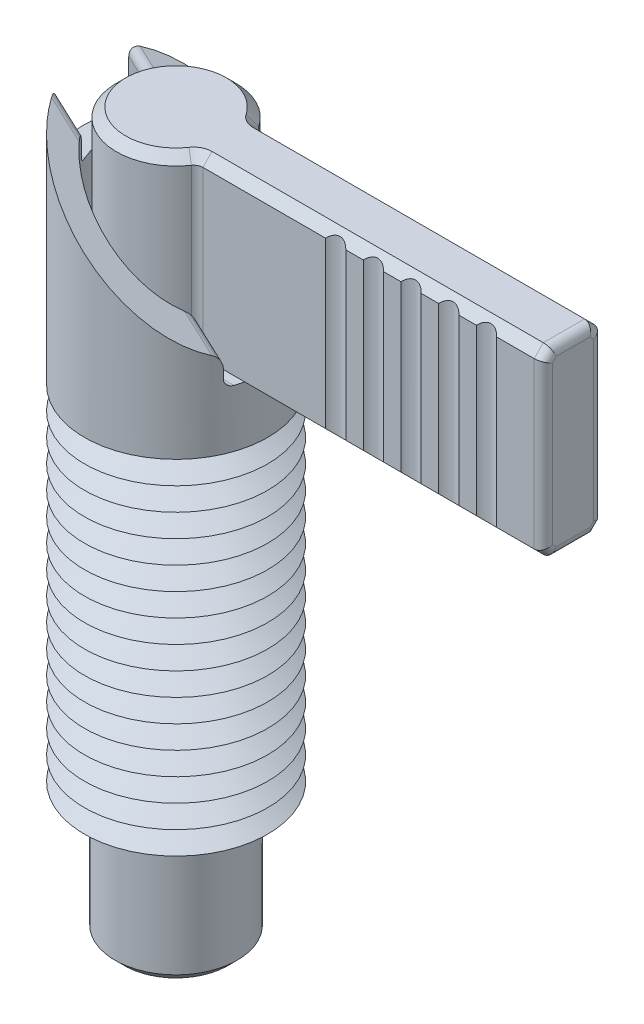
ISO-10303-21;
HEADER;
FILE_DESCRIPTION(('STEP AP214'),'2;1');
FILE_NAME('part.step','',(''),(''),'','','');
FILE_SCHEMA(('AUTOMOTIVE_DESIGN { 1 0 10303 214 1 1 1 1 }'));
ENDSEC;
DATA;
#1=APPLICATION_CONTEXT('core data for automotive mechanical design processes');
#2=APPLICATION_PROTOCOL_DEFINITION('international standard','automotive_design',2000,#1);
#3=PRODUCT_CONTEXT('',#1,'mechanical');
#4=PRODUCT('Part','Part','',(#3));
#5=PRODUCT_RELATED_PRODUCT_CATEGORY('part','',(#4));
#6=PRODUCT_DEFINITION_FORMATION('','',#4);
#7=PRODUCT_DEFINITION_CONTEXT('part definition',#1,'design');
#8=PRODUCT_DEFINITION('design','',#6,#7);
#9=PRODUCT_DEFINITION_SHAPE('','',#8);
#10=(LENGTH_UNIT() NAMED_UNIT(*) SI_UNIT(.MILLI.,.METRE.));
#11=(NAMED_UNIT(*) PLANE_ANGLE_UNIT() SI_UNIT($,.RADIAN.));
#12=(NAMED_UNIT(*) SI_UNIT($,.STERADIAN.) SOLID_ANGLE_UNIT());
#13=UNCERTAINTY_MEASURE_WITH_UNIT(LENGTH_MEASURE(1.E-05),#10,'distance_accuracy_value','');
#14=(GEOMETRIC_REPRESENTATION_CONTEXT(3) GLOBAL_UNCERTAINTY_ASSIGNED_CONTEXT((#13)) GLOBAL_UNIT_ASSIGNED_CONTEXT((#10,
#11,#12)) REPRESENTATION_CONTEXT('',''));
#15=CARTESIAN_POINT('',(0.,0.,0.));
#16=DIRECTION('',(0.,0.,1.));
#17=DIRECTION('',(1.,0.,0.));
#18=AXIS2_PLACEMENT_3D('',#15,#16,#17);
#19=CARTESIAN_POINT('',(3.37749907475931,4.04379064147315,1.95));
#20=DIRECTION('',(0.,0.,1.));
#21=DIRECTION('',(1.,0.,0.));
#22=AXIS2_PLACEMENT_3D('',#19,#20,#21);
#23=PLANE('',#22);
#24=DIRECTION('',(0.,1.,0.));
#25=VECTOR('',#24,1.);
#26=CARTESIAN_POINT('',(13.0643624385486,-8.,1.95));
#27=LINE('',#26,#25);
#28=CARTESIAN_POINT('',(13.0643624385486,27.6006,1.95));
#29=VERTEX_POINT('',#28);
#30=CARTESIAN_POINT('',(13.0643624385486,38.3994,1.95));
#31=VERTEX_POINT('',#30);
#32=EDGE_CURVE('P0_E200',#29,#31,#27,.T.);
#33=ORIENTED_EDGE('',*,*,#32,.F.);
#34=DIRECTION('',(1.,0.,0.));
#35=VECTOR('',#34,1.);
#36=CARTESIAN_POINT('',(26.,27.6006,1.95));
#37=LINE('',#36,#35);
#38=CARTESIAN_POINT('',(14.2096375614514,27.6006,1.95));
#39=VERTEX_POINT('',#38);
#40=EDGE_CURVE('P0_E209',#29,#39,#37,.T.);
#41=ORIENTED_EDGE('',*,*,#40,.T.);
#42=DIRECTION('',(0.,1.,0.));
#43=VECTOR('',#42,1.);
#44=CARTESIAN_POINT('',(14.2096375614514,-8.,1.95));
#45=LINE('',#44,#43);
#46=CARTESIAN_POINT('',(14.2096375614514,38.3994,1.95));
#47=VERTEX_POINT('',#46);
#48=EDGE_CURVE('P0_E210',#39,#47,#45,.T.);
#49=ORIENTED_EDGE('',*,*,#48,.T.);
#50=DIRECTION('',(-1.,0.,0.));
#51=VECTOR('',#50,1.);
#52=CARTESIAN_POINT('',(3.70807766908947,38.3994,1.95));
#53=LINE('',#52,#51);
#54=EDGE_CURVE('P0_E236',#47,#31,#53,.T.);
#55=ORIENTED_EDGE('',*,*,#54,.T.);
#56=EDGE_LOOP('',(#33,#41,#49,#55));
#57=FACE_BOUND('',#56,.T.);
#58=ADVANCED_FACE('P0_F16',(#57),#23,.T.);
#59=DIRECTION('',(0.,1.,0.));
#60=VECTOR('',#59,1.);
#61=CARTESIAN_POINT('',(15.5343624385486,-8.,1.95));
#62=LINE('',#61,#60);
#63=CARTESIAN_POINT('',(15.5343624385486,27.6006,1.95));
#64=VERTEX_POINT('',#63);
#65=CARTESIAN_POINT('',(15.5343624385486,38.3994,1.95));
#66=VERTEX_POINT('',#65);
#67=EDGE_CURVE('P0_E299',#64,#66,#62,.T.);
#68=ORIENTED_EDGE('',*,*,#67,.F.);
#69=CARTESIAN_POINT('',(16.6796375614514,27.6006,1.95));
#70=VERTEX_POINT('',#69);
#71=EDGE_CURVE('P0_E221',#64,#70,#37,.T.);
#72=ORIENTED_EDGE('',*,*,#71,.T.);
#73=DIRECTION('',(0.,1.,0.));
#74=VECTOR('',#73,1.);
#75=CARTESIAN_POINT('',(16.6796375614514,-8.,1.95));
#76=LINE('',#75,#74);
#77=CARTESIAN_POINT('',(16.6796375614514,38.3994,1.95));
#78=VERTEX_POINT('',#77);
#79=EDGE_CURVE('P0_E293',#70,#78,#76,.T.);
#80=ORIENTED_EDGE('',*,*,#79,.T.);
#81=EDGE_CURVE('P0_E239',#78,#66,#53,.T.);
#82=ORIENTED_EDGE('',*,*,#81,.T.);
#83=EDGE_LOOP('',(#68,#72,#80,#82));
#84=FACE_BOUND('',#83,.T.);
#85=ADVANCED_FACE('P0_F496',(#84),#23,.T.);
#86=DIRECTION('',(0.,1.,0.));
#87=VECTOR('',#86,1.);
#88=CARTESIAN_POINT('',(18.0043624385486,-8.,1.95));
#89=LINE('',#88,#87);
#90=CARTESIAN_POINT('',(18.0043624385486,27.6006,1.95));
#91=VERTEX_POINT('',#90);
#92=CARTESIAN_POINT('',(18.0043624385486,38.3994,1.95));
#93=VERTEX_POINT('',#92);
#94=EDGE_CURVE('P0_E292',#91,#93,#89,.T.);
#95=ORIENTED_EDGE('',*,*,#94,.F.);
#96=CARTESIAN_POINT('',(19.1496375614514,27.6006,1.95));
#97=VERTEX_POINT('',#96);
#98=EDGE_CURVE('P0_E228',#91,#97,#37,.T.);
#99=ORIENTED_EDGE('',*,*,#98,.T.);
#100=DIRECTION('',(0.,1.,0.));
#101=VECTOR('',#100,1.);
#102=CARTESIAN_POINT('',(19.1496375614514,-8.,1.95));
#103=LINE('',#102,#101);
#104=CARTESIAN_POINT('',(19.1496375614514,38.3994,1.95));
#105=VERTEX_POINT('',#104);
#106=EDGE_CURVE('P0_E286',#97,#105,#103,.T.);
#107=ORIENTED_EDGE('',*,*,#106,.T.);
#108=EDGE_CURVE('P0_E234',#105,#93,#53,.T.);
#109=ORIENTED_EDGE('',*,*,#108,.T.);
#110=EDGE_LOOP('',(#95,#99,#107,#109));
#111=FACE_BOUND('',#110,.T.);
#112=ADVANCED_FACE('P0_F324',(#111),#23,.T.);
#113=DIRECTION('',(0.,1.,0.));
#114=VECTOR('',#113,1.);
#115=CARTESIAN_POINT('',(20.4743624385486,-8.,1.95));
#116=LINE('',#115,#114);
#117=CARTESIAN_POINT('',(20.4743624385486,27.6006,1.95));
#118=VERTEX_POINT('',#117);
#119=CARTESIAN_POINT('',(20.4743624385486,38.3994,1.95));
#120=VERTEX_POINT('',#119);
#121=EDGE_CURVE('P0_E285',#118,#120,#116,.T.);
#122=ORIENTED_EDGE('',*,*,#121,.F.);
#123=CARTESIAN_POINT('',(21.6196375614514,27.6006,1.95));
#124=VERTEX_POINT('',#123);
#125=EDGE_CURVE('P0_E223',#118,#124,#37,.T.);
#126=ORIENTED_EDGE('',*,*,#125,.T.);
#127=DIRECTION('',(0.,1.,0.));
#128=VECTOR('',#127,1.);
#129=CARTESIAN_POINT('',(21.6196375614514,-8.,1.95));
#130=LINE('',#129,#128);
#131=CARTESIAN_POINT('',(21.6196375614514,38.3994,1.95));
#132=VERTEX_POINT('',#131);
#133=EDGE_CURVE('P0_E279',#124,#132,#130,.T.);
#134=ORIENTED_EDGE('',*,*,#133,.T.);
#135=EDGE_CURVE('P0_E229',#132,#120,#53,.T.);
#136=ORIENTED_EDGE('',*,*,#135,.T.);
#137=EDGE_LOOP('',(#122,#126,#134,#136));
#138=FACE_BOUND('',#137,.T.);
#139=ADVANCED_FACE('P0_F337',(#138),#23,.T.);
#140=CARTESIAN_POINT('',(22.9443624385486,27.6006,1.95));
#141=VERTEX_POINT('',#140);
#142=CARTESIAN_POINT('',(25.3994,27.6006,1.95));
#143=VERTEX_POINT('',#142);
#144=EDGE_CURVE('P0_E218',#141,#143,#37,.T.);
#145=ORIENTED_EDGE('',*,*,#144,.T.);
#146=DIRECTION('',(0.,1.,0.));
#147=VECTOR('',#146,1.);
#148=CARTESIAN_POINT('',(25.3994,4.04379064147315,1.95));
#149=LINE('',#148,#147);
#150=CARTESIAN_POINT('',(25.3994,38.3994,1.95));
#151=VERTEX_POINT('',#150);
#152=EDGE_CURVE('P0_E11',#143,#151,#149,.T.);
#153=ORIENTED_EDGE('',*,*,#152,.T.);
#154=CARTESIAN_POINT('',(22.9443624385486,38.3994,1.95));
#155=VERTEX_POINT('',#154);
#156=EDGE_CURVE('P0_E224',#151,#155,#53,.T.);
#157=ORIENTED_EDGE('',*,*,#156,.T.);
#158=DIRECTION('',(0.,1.,0.));
#159=VECTOR('',#158,1.);
#160=CARTESIAN_POINT('',(22.9443624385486,-8.,1.95));
#161=LINE('',#160,#159);
#162=EDGE_CURVE('P0_E278',#141,#155,#161,.T.);
#163=ORIENTED_EDGE('',*,*,#162,.F.);
#164=EDGE_LOOP('',(#145,#153,#157,#163));
#165=FACE_BOUND('',#164,.T.);
#166=ADVANCED_FACE('P0_F506',(#165),#23,.T.);
#167=CARTESIAN_POINT('',(0.,-8.,0.));
#168=DIRECTION('',(0.,1.,0.));
#169=DIRECTION('',(0.,0.,1.));
#170=AXIS2_PLACEMENT_3D('',#167,#168,#169);
#171=PLANE('',#170);
#172=CARTESIAN_POINT('',(0.,-8.,0.));
#173=DIRECTION('',(0.,-1.,0.));
#174=DIRECTION('',(0.,0.,-1.));
#175=AXIS2_PLACEMENT_3D('',#172,#173,#174);
#176=CIRCLE('',#175,3.4);
#177=CARTESIAN_POINT('',(0.,-8.,-3.4));
#178=VERTEX_POINT('',#177);
#179=EDGE_CURVE('P0_E259',#178,#178,#176,.T.);
#180=ORIENTED_EDGE('',*,*,#179,.T.);
#181=EDGE_LOOP('',(#180));
#182=FACE_BOUND('',#181,.T.);
#183=ADVANCED_FACE('P0_F516',(#182),#171,.F.);
#184=CARTESIAN_POINT('',(0.,-7.4,0.));
#185=DIRECTION('',(0.,1.,0.));
#186=DIRECTION('',(0.,0.,1.));
#187=AXIS2_PLACEMENT_3D('',#184,#185,#186);
#188=CONICAL_SURFACE('',#187,4.,0.785398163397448);
#189=ORIENTED_EDGE('',*,*,#179,.F.);
#190=EDGE_LOOP('',(#189));
#191=FACE_BOUND('',#190,.T.);
#192=CARTESIAN_POINT('',(0.,-7.4,0.));
#193=DIRECTION('',(0.,-1.,0.));
#194=DIRECTION('',(0.,0.,-1.));
#195=AXIS2_PLACEMENT_3D('',#192,#193,#194);
#196=CIRCLE('',#195,4.);
#197=CARTESIAN_POINT('',(0.,-7.4,-4.));
#198=VERTEX_POINT('',#197);
#199=EDGE_CURVE('P0_E262',#198,#198,#196,.T.);
#200=ORIENTED_EDGE('',*,*,#199,.T.);
#201=EDGE_LOOP('',(#200));
#202=FACE_BOUND('',#201,.T.);
#203=ADVANCED_FACE('P0_F521',(#191,#202),#188,.T.);
#204=CARTESIAN_POINT('',(0.,-8.,0.));
#205=DIRECTION('',(0.,-1.,0.));
#206=DIRECTION('',(0.,0.,-1.));
#207=AXIS2_PLACEMENT_3D('',#204,#205,#206);
#208=CYLINDRICAL_SURFACE('',#207,4.);
#209=ORIENTED_EDGE('',*,*,#199,.F.);
#210=EDGE_LOOP('',(#209));
#211=FACE_BOUND('',#210,.T.);
#212=CARTESIAN_POINT('',(0.,6.5,0.));
#213=DIRECTION('',(0.,-1.,0.));
#214=DIRECTION('',(0.,0.,-1.));
#215=AXIS2_PLACEMENT_3D('',#212,#213,#214);
#216=CIRCLE('',#215,4.);
#217=CARTESIAN_POINT('',(0.,6.5,-4.));
#218=VERTEX_POINT('',#217);
#219=EDGE_CURVE('P0_E265',#218,#218,#216,.T.);
#220=ORIENTED_EDGE('',*,*,#219,.T.);
#221=EDGE_LOOP('',(#220));
#222=FACE_BOUND('',#221,.T.);
#223=ADVANCED_FACE('P0_F555',(#211,#222),#208,.T.);
#224=CARTESIAN_POINT('',(-4.,6.5,0.));
#225=DIRECTION('',(0.,-1.,0.));
#226=DIRECTION('',(0.,0.,-1.));
#227=AXIS2_PLACEMENT_3D('',#224,#225,#226);
#228=PLANE('',#227);
#229=ORIENTED_EDGE('',*,*,#219,.F.);
#230=EDGE_LOOP('',(#229));
#231=FACE_BOUND('',#230,.T.);
#232=CARTESIAN_POINT('',(0.,6.5,0.));
#233=DIRECTION('',(0.,-1.,0.));
#234=DIRECTION('',(0.,0.,-1.));
#235=AXIS2_PLACEMENT_3D('',#232,#233,#234);
#236=CIRCLE('',#235,3.);
#237=CARTESIAN_POINT('',(0.,6.5,-3.));
#238=VERTEX_POINT('',#237);
#239=EDGE_CURVE('P0_E268',#238,#238,#236,.T.);
#240=ORIENTED_EDGE('',*,*,#239,.T.);
#241=EDGE_LOOP('',(#240));
#242=FACE_BOUND('',#241,.T.);
#243=ADVANCED_FACE('P0_F563',(#231,#242),#228,.F.);
#244=CARTESIAN_POINT('',(0.,-8.,0.));
#245=DIRECTION('',(0.,-1.,0.));
#246=DIRECTION('',(0.,0.,-1.));
#247=AXIS2_PLACEMENT_3D('',#244,#245,#246);
#248=CYLINDRICAL_SURFACE('',#247,3.);
#249=ORIENTED_EDGE('',*,*,#239,.F.);
#250=EDGE_LOOP('',(#249));
#251=FACE_BOUND('',#250,.T.);
#252=CARTESIAN_POINT('',(0.,27.,0.));
#253=DIRECTION('',(0.,-1.,0.));
#254=DIRECTION('',(0.,0.,-1.));
#255=AXIS2_PLACEMENT_3D('',#252,#253,#254);
#256=CIRCLE('',#255,3.);
#257=CARTESIAN_POINT('',(0.,27.,-3.));
#258=VERTEX_POINT('',#257);
#259=EDGE_CURVE('P0_E271',#258,#258,#256,.T.);
#260=ORIENTED_EDGE('',*,*,#259,.T.);
#261=EDGE_LOOP('',(#260));
#262=FACE_BOUND('',#261,.T.);
#263=ADVANCED_FACE('P0_F571',(#251,#262),#248,.T.);
#264=CARTESIAN_POINT('',(-3.,27.,0.));
#265=DIRECTION('',(0.,1.,0.));
#266=DIRECTION('',(0.,0.,1.));
#267=AXIS2_PLACEMENT_3D('',#264,#265,#266);
#268=PLANE('',#267);
#269=ORIENTED_EDGE('',*,*,#259,.F.);
#270=EDGE_LOOP('',(#269));
#271=FACE_BOUND('',#270,.T.);
#272=DIRECTION('',(1.,0.,0.));
#273=VECTOR('',#272,1.);
#274=CARTESIAN_POINT('',(26.,27.,-1.3494));
#275=LINE('',#274,#273);
#276=CARTESIAN_POINT('',(3.70807766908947,27.,-1.3494));
#277=VERTEX_POINT('',#276);
#278=CARTESIAN_POINT('',(25.3994,27.,-1.3494));
#279=VERTEX_POINT('',#278);
#280=EDGE_CURVE('P0_E247',#277,#279,#275,.T.);
#281=ORIENTED_EDGE('',*,*,#280,.T.);
#282=DIRECTION('',(0.,0.,1.));
#283=VECTOR('',#282,1.);
#284=CARTESIAN_POINT('',(25.3994,27.,1.34940000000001));
#285=LINE('',#284,#283);
#286=CARTESIAN_POINT('',(25.3994,27.,1.3494));
#287=VERTEX_POINT('',#286);
#288=EDGE_CURVE('P0_E40',#279,#287,#285,.T.);
#289=ORIENTED_EDGE('',*,*,#288,.T.);
#290=DIRECTION('',(-1.,0.,0.));
#291=VECTOR('',#290,1.);
#292=CARTESIAN_POINT('',(3.70807766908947,27.,1.3494));
#293=LINE('',#292,#291);
#294=CARTESIAN_POINT('',(3.70807766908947,27.,1.3494));
#295=VERTEX_POINT('',#294);
#296=EDGE_CURVE('P0_E237',#287,#295,#293,.T.);
#297=ORIENTED_EDGE('',*,*,#296,.T.);
#298=CARTESIAN_POINT('',(3.70807766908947,27.,2.5506));
#299=DIRECTION('',(0.,1.,0.));
#300=DIRECTION('',(0.,0.,1.));
#301=AXIS2_PLACEMENT_3D('',#298,#299,#300);
#302=CIRCLE('',#301,1.2012);
#303=CARTESIAN_POINT('',(2.71840009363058,27.,1.86985060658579));
#304=VERTEX_POINT('',#303);
#305=EDGE_CURVE('P0_E240',#295,#304,#302,.T.);
#306=ORIENTED_EDGE('',*,*,#305,.T.);
#307=CARTESIAN_POINT('',(0.,27.,0.));
#308=DIRECTION('',(0.,1.,0.));
#309=DIRECTION('',(0.,0.,1.));
#310=AXIS2_PLACEMENT_3D('',#307,#308,#309);
#311=CIRCLE('',#310,3.2994);
#312=CARTESIAN_POINT('',(2.71840009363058,27.,-1.86985060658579));
#313=VERTEX_POINT('',#312);
#314=EDGE_CURVE('P0_E241',#304,#313,#311,.F.);
#315=ORIENTED_EDGE('',*,*,#314,.T.);
#316=CARTESIAN_POINT('',(3.70807766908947,27.,-2.5506));
#317=DIRECTION('',(0.,1.,0.));
#318=DIRECTION('',(0.,0.,1.));
#319=AXIS2_PLACEMENT_3D('',#316,#317,#318);
#320=CIRCLE('',#319,1.2012);
#321=EDGE_CURVE('P0_E245',#313,#277,#320,.T.);
#322=ORIENTED_EDGE('',*,*,#321,.T.);
#323=EDGE_LOOP('',(#281,#289,#297,#306,#315,#322));
#324=FACE_BOUND('',#323,.T.);
#325=ADVANCED_FACE('P0_F422',(#271,#324),#268,.F.);
#326=CARTESIAN_POINT('',(0.,-8.,0.));
#327=DIRECTION('',(0.,-1.,0.));
#328=DIRECTION('',(0.,0.,-1.));
#329=AXIS2_PLACEMENT_3D('',#326,#327,#328);
#330=CYLINDRICAL_SURFACE('',#329,3.9);
#331=DIRECTION('',(0.,-1.,0.));
#332=VECTOR('',#331,1.);
#333=CARTESIAN_POINT('',(3.21323888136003,-8.,-2.21022530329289));
#334=LINE('',#333,#332);
#335=CARTESIAN_POINT('',(3.21323888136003,38.3994,-2.21022530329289));
#336=VERTEX_POINT('',#335);
#337=CARTESIAN_POINT('',(3.21323888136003,27.6006,-2.21022530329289));
#338=VERTEX_POINT('',#337);
#339=EDGE_CURVE('P0_E250',#336,#338,#334,.T.);
#340=ORIENTED_EDGE('',*,*,#339,.T.);
#341=CARTESIAN_POINT('',(0.,27.6006,0.));
#342=DIRECTION('',(0.,1.,0.));
#343=DIRECTION('',(0.,0.,1.));
#344=AXIS2_PLACEMENT_3D('',#341,#342,#343);
#345=CIRCLE('',#344,3.9);
#346=CARTESIAN_POINT('',(3.21323888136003,27.6006,2.21022530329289));
#347=VERTEX_POINT('',#346);
#348=EDGE_CURVE('P0_E436',#338,#347,#345,.T.);
#349=ORIENTED_EDGE('',*,*,#348,.T.);
#350=DIRECTION('',(0.,-1.,0.));
#351=VECTOR('',#350,1.);
#352=CARTESIAN_POINT('',(3.21323888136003,-8.,2.21022530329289));
#353=LINE('',#352,#351);
#354=CARTESIAN_POINT('',(3.21323888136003,38.3994,2.21022530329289));
#355=VERTEX_POINT('',#354);
#356=EDGE_CURVE('P0_E253',#347,#355,#353,.F.);
#357=ORIENTED_EDGE('',*,*,#356,.T.);
#358=CARTESIAN_POINT('',(0.,38.3994,0.));
#359=DIRECTION('',(0.,-1.,0.));
#360=DIRECTION('',(0.,0.,-1.));
#361=AXIS2_PLACEMENT_3D('',#358,#359,#360);
#362=CIRCLE('',#361,3.9);
#363=EDGE_CURVE('P0_E476',#355,#336,#362,.T.);
#364=ORIENTED_EDGE('',*,*,#363,.T.);
#365=EDGE_LOOP('',(#340,#349,#357,#364));
#366=FACE_BOUND('',#365,.T.);
#367=ADVANCED_FACE('P0_F586',(#366),#330,.T.);
#368=CARTESIAN_POINT('',(-3.9,39.,0.));
#369=DIRECTION('',(0.,-1.,0.));
#370=DIRECTION('',(0.,0.,-1.));
#371=AXIS2_PLACEMENT_3D('',#368,#369,#370);
#372=PLANE('',#371);
#373=DIRECTION('',(1.,0.,0.));
#374=VECTOR('',#373,1.);
#375=CARTESIAN_POINT('',(26.,39.,1.3494));
#376=LINE('',#375,#374);
#377=CARTESIAN_POINT('',(3.70807766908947,39.,1.3494));
#378=VERTEX_POINT('',#377);
#379=CARTESIAN_POINT('',(25.3994,39.,1.3494));
#380=VERTEX_POINT('',#379);
#381=EDGE_CURVE('P0_E343',#378,#380,#376,.T.);
#382=ORIENTED_EDGE('',*,*,#381,.T.);
#383=DIRECTION('',(0.,0.,-1.));
#384=VECTOR('',#383,1.);
#385=CARTESIAN_POINT('',(25.3994,39.,-1.3494));
#386=LINE('',#385,#384);
#387=CARTESIAN_POINT('',(25.3994,39.,-1.3494));
#388=VERTEX_POINT('',#387);
#389=EDGE_CURVE('P0_E375',#380,#388,#386,.T.);
#390=ORIENTED_EDGE('',*,*,#389,.T.);
#391=DIRECTION('',(-1.,0.,0.));
#392=VECTOR('',#391,1.);
#393=CARTESIAN_POINT('',(3.70807766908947,39.,-1.3494));
#394=LINE('',#393,#392);
#395=CARTESIAN_POINT('',(3.70807766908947,39.,-1.3494));
#396=VERTEX_POINT('',#395);
#397=EDGE_CURVE('P0_E465',#388,#396,#394,.T.);
#398=ORIENTED_EDGE('',*,*,#397,.T.);
#399=CARTESIAN_POINT('',(3.70807766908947,39.,-2.5506));
#400=DIRECTION('',(0.,-1.,0.));
#401=DIRECTION('',(0.,0.,-1.));
#402=AXIS2_PLACEMENT_3D('',#399,#400,#401);
#403=CIRCLE('',#402,1.2012);
#404=CARTESIAN_POINT('',(2.71840009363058,39.,-1.86985060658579));
#405=VERTEX_POINT('',#404);
#406=EDGE_CURVE('P0_E463',#396,#405,#403,.T.);
#407=ORIENTED_EDGE('',*,*,#406,.T.);
#408=CARTESIAN_POINT('',(0.,39.,0.));
#409=DIRECTION('',(0.,-1.,0.));
#410=DIRECTION('',(0.,0.,-1.));
#411=AXIS2_PLACEMENT_3D('',#408,#409,#410);
#412=CIRCLE('',#411,3.2994);
#413=CARTESIAN_POINT('',(2.71840009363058,39.,1.86985060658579));
#414=VERTEX_POINT('',#413);
#415=EDGE_CURVE('P0_E461',#405,#414,#412,.F.);
#416=ORIENTED_EDGE('',*,*,#415,.T.);
#417=CARTESIAN_POINT('',(3.70807766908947,39.,2.5506));
#418=DIRECTION('',(0.,-1.,0.));
#419=DIRECTION('',(0.,0.,-1.));
#420=AXIS2_PLACEMENT_3D('',#417,#418,#419);
#421=CIRCLE('',#420,1.2012);
#422=EDGE_CURVE('P0_E348',#414,#378,#421,.T.);
#423=ORIENTED_EDGE('',*,*,#422,.T.);
#424=EDGE_LOOP('',(#382,#390,#398,#407,#416,#423));
#425=FACE_BOUND('',#424,.T.);
#426=ADVANCED_FACE('P0_F594',(#425),#372,.F.);
#427=CARTESIAN_POINT('',(3.37749907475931,4.04379064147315,-1.95));
#428=DIRECTION('',(0.,0.,-1.));
#429=DIRECTION('',(-1.,0.,0.));
#430=AXIS2_PLACEMENT_3D('',#427,#428,#429);
#431=PLANE('',#430);
#432=DIRECTION('',(1.,0.,0.));
#433=VECTOR('',#432,1.);
#434=CARTESIAN_POINT('',(26.,38.3994,-1.95));
#435=LINE('',#434,#433);
#436=CARTESIAN_POINT('',(3.70807766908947,38.3994,-1.95));
#437=VERTEX_POINT('',#436);
#438=CARTESIAN_POINT('',(25.3994,38.3994,-1.95));
#439=VERTEX_POINT('',#438);
#440=EDGE_CURVE('P0_E468',#437,#439,#435,.T.);
#441=ORIENTED_EDGE('',*,*,#440,.T.);
#442=DIRECTION('',(0.,1.,0.));
#443=VECTOR('',#442,1.);
#444=CARTESIAN_POINT('',(25.3994,4.04379064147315,-1.95));
#445=LINE('',#444,#443);
#446=CARTESIAN_POINT('',(25.3994,27.6006,-1.95));
#447=VERTEX_POINT('',#446);
#448=EDGE_CURVE('P0_E379',#439,#447,#445,.F.);
#449=ORIENTED_EDGE('',*,*,#448,.T.);
#450=DIRECTION('',(-1.,0.,0.));
#451=VECTOR('',#450,1.);
#452=CARTESIAN_POINT('',(3.70807766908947,27.6006,-1.95));
#453=LINE('',#452,#451);
#454=CARTESIAN_POINT('',(3.70807766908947,27.6006,-1.95));
#455=VERTEX_POINT('',#454);
#456=EDGE_CURVE('P0_E421',#447,#455,#453,.T.);
#457=ORIENTED_EDGE('',*,*,#456,.T.);
#458=DIRECTION('',(0.,-1.,0.));
#459=VECTOR('',#458,1.);
#460=CARTESIAN_POINT('',(3.70807766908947,4.04379064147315,-1.95));
#461=LINE('',#460,#459);
#462=EDGE_CURVE('P0_E256',#455,#437,#461,.F.);
#463=ORIENTED_EDGE('',*,*,#462,.T.);
#464=EDGE_LOOP('',(#441,#449,#457,#463));
#465=FACE_BOUND('',#464,.T.);
#466=ADVANCED_FACE('P0_F513',(#465),#431,.T.);
#467=CARTESIAN_POINT('',(26.,4.04379064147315,1.95));
#468=DIRECTION('',(1.,0.,0.));
#469=DIRECTION('',(0.,0.,-1.));
#470=AXIS2_PLACEMENT_3D('',#467,#468,#469);
#471=PLANE('',#470);
#472=DIRECTION('',(0.,0.,-1.));
#473=VECTOR('',#472,1.);
#474=CARTESIAN_POINT('',(26.,38.3994,1.3494));
#475=LINE('',#474,#473);
#476=CARTESIAN_POINT('',(26.,38.3994,-1.10062333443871));
#477=VERTEX_POINT('',#476);
#478=CARTESIAN_POINT('',(26.,38.3994,1.10062333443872));
#479=VERTEX_POINT('',#478);
#480=EDGE_CURVE('P0_E367',#477,#479,#475,.F.);
#481=ORIENTED_EDGE('',*,*,#480,.T.);
#482=DIRECTION('',(0.,-0.707106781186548,0.707106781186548));
#483=VECTOR('',#482,1.);
#484=CARTESIAN_POINT('',(26.,20.7969069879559,18.7031163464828));
#485=LINE('',#484,#483);
#486=CARTESIAN_POINT('',(26.,38.1506233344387,1.3494));
#487=VERTEX_POINT('',#486);
#488=EDGE_CURVE('P0_E369',#479,#487,#485,.T.);
#489=ORIENTED_EDGE('',*,*,#488,.T.);
#490=DIRECTION('',(0.,1.,0.));
#491=VECTOR('',#490,1.);
#492=CARTESIAN_POINT('',(26.,4.04379064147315,1.3494));
#493=LINE('',#492,#491);
#494=CARTESIAN_POINT('',(26.,27.8493766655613,1.3494));
#495=VERTEX_POINT('',#494);
#496=EDGE_CURVE('P0_E309',#487,#495,#493,.F.);
#497=ORIENTED_EDGE('',*,*,#496,.T.);
#498=DIRECTION('',(0.,-0.707106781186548,-0.707106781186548));
#499=VECTOR('',#498,1.);
#500=CARTESIAN_POINT('',(26.,16.2468836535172,-10.2530930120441));
#501=LINE('',#500,#499);
#502=CARTESIAN_POINT('',(26.,27.6006,1.10062333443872));
#503=VERTEX_POINT('',#502);
#504=EDGE_CURVE('P0_E357',#495,#503,#501,.T.);
#505=ORIENTED_EDGE('',*,*,#504,.T.);
#506=DIRECTION('',(0.,0.,1.));
#507=VECTOR('',#506,1.);
#508=CARTESIAN_POINT('',(26.,27.6006,-1.3494));
#509=LINE('',#508,#507);
#510=CARTESIAN_POINT('',(26.,27.6006,-1.10062333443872));
#511=VERTEX_POINT('',#510);
#512=EDGE_CURVE('P0_E359',#503,#511,#509,.F.);
#513=ORIENTED_EDGE('',*,*,#512,.T.);
#514=DIRECTION('',(0.,0.707106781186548,-0.707106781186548));
#515=VECTOR('',#514,1.);
#516=CARTESIAN_POINT('',(26.,14.2968836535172,12.2030930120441));
#517=LINE('',#516,#515);
#518=CARTESIAN_POINT('',(26.,27.8493766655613,-1.3494));
#519=VERTEX_POINT('',#518);
#520=EDGE_CURVE('P0_E361',#511,#519,#517,.T.);
#521=ORIENTED_EDGE('',*,*,#520,.T.);
#522=DIRECTION('',(0.,1.,0.));
#523=VECTOR('',#522,1.);
#524=CARTESIAN_POINT('',(26.,4.04379064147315,-1.3494));
#525=LINE('',#524,#523);
#526=CARTESIAN_POINT('',(26.,38.1506233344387,-1.3494));
#527=VERTEX_POINT('',#526);
#528=EDGE_CURVE('P0_E363',#519,#527,#525,.T.);
#529=ORIENTED_EDGE('',*,*,#528,.T.);
#530=DIRECTION('',(0.,0.707106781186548,0.707106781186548));
#531=VECTOR('',#530,1.);
#532=CARTESIAN_POINT('',(26.,22.7469069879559,-16.7531163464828));
#533=LINE('',#532,#531);
#534=EDGE_CURVE('P0_E365',#527,#477,#533,.T.);
#535=ORIENTED_EDGE('',*,*,#534,.T.);
#536=EDGE_LOOP('',(#481,#489,#497,#505,#513,#521,#529,#535));
#537=FACE_BOUND('',#536,.T.);
#538=ADVANCED_FACE('P0_F505',(#537),#471,.T.);
#539=DIRECTION('',(0.,1.,0.));
#540=VECTOR('',#539,1.);
#541=CARTESIAN_POINT('',(11.7396375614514,-8.,1.95));
#542=LINE('',#541,#540);
#543=CARTESIAN_POINT('',(11.7396375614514,27.6006,1.95));
#544=VERTEX_POINT('',#543);
#545=CARTESIAN_POINT('',(11.7396375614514,38.3994,1.95));
#546=VERTEX_POINT('',#545);
#547=EDGE_CURVE('P0_E190',#544,#546,#542,.T.);
#548=ORIENTED_EDGE('',*,*,#547,.T.);
#549=CARTESIAN_POINT('',(3.70807766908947,38.3994,1.95));
#550=VERTEX_POINT('',#549);
#551=EDGE_CURVE('P0_E230',#546,#550,#53,.T.);
#552=ORIENTED_EDGE('',*,*,#551,.T.);
#553=DIRECTION('',(0.,-1.,0.));
#554=VECTOR('',#553,1.);
#555=CARTESIAN_POINT('',(3.70807766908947,4.04379064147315,1.95));
#556=LINE('',#555,#554);
#557=CARTESIAN_POINT('',(3.70807766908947,27.6006,1.95));
#558=VERTEX_POINT('',#557);
#559=EDGE_CURVE('P0_E215',#550,#558,#556,.T.);
#560=ORIENTED_EDGE('',*,*,#559,.T.);
#561=EDGE_CURVE('P0_E206',#558,#544,#37,.T.);
#562=ORIENTED_EDGE('',*,*,#561,.T.);
#563=EDGE_LOOP('',(#548,#552,#560,#562));
#564=FACE_BOUND('',#563,.T.);
#565=ADVANCED_FACE('P0_F213',(#564),#23,.T.);
#566=CARTESIAN_POINT('',(3.70807766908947,-8.,-2.5506));
#567=DIRECTION('',(0.,-1.,0.));
#568=DIRECTION('',(0.,0.,-1.));
#569=AXIS2_PLACEMENT_3D('',#566,#567,#568);
#570=CYLINDRICAL_SURFACE('',#569,0.6006);
#571=ORIENTED_EDGE('',*,*,#462,.F.);
#572=CARTESIAN_POINT('',(3.70807766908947,27.6006,-2.5506));
#573=DIRECTION('',(0.,1.,0.));
#574=DIRECTION('',(0.,0.,1.));
#575=AXIS2_PLACEMENT_3D('',#572,#573,#574);
#576=CIRCLE('',#575,0.6006);
#577=EDGE_CURVE('P0_E471',#455,#338,#576,.F.);
#578=ORIENTED_EDGE('',*,*,#577,.T.);
#579=ORIENTED_EDGE('',*,*,#339,.F.);
#580=CARTESIAN_POINT('',(3.70807766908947,38.3994,-2.5506));
#581=DIRECTION('',(0.,-1.,0.));
#582=DIRECTION('',(0.,0.,-1.));
#583=AXIS2_PLACEMENT_3D('',#580,#581,#582);
#584=CIRCLE('',#583,0.6006);
#585=EDGE_CURVE('P0_E473',#336,#437,#584,.F.);
#586=ORIENTED_EDGE('',*,*,#585,.T.);
#587=EDGE_LOOP('',(#571,#578,#579,#586));
#588=FACE_BOUND('',#587,.T.);
#589=ADVANCED_FACE('P0_F504',(#588),#570,.F.);
#590=CARTESIAN_POINT('',(3.70807766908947,-8.,2.5506));
#591=DIRECTION('',(0.,-1.,0.));
#592=DIRECTION('',(0.,0.,-1.));
#593=AXIS2_PLACEMENT_3D('',#590,#591,#592);
#594=CYLINDRICAL_SURFACE('',#593,0.6006);
#595=ORIENTED_EDGE('',*,*,#356,.F.);
#596=CARTESIAN_POINT('',(3.70807766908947,27.6006,2.5506));
#597=DIRECTION('',(0.,1.,0.));
#598=DIRECTION('',(0.,0.,1.));
#599=AXIS2_PLACEMENT_3D('',#596,#597,#598);
#600=CIRCLE('',#599,0.6006);
#601=EDGE_CURVE('P0_E219',#347,#558,#600,.F.);
#602=ORIENTED_EDGE('',*,*,#601,.T.);
#603=ORIENTED_EDGE('',*,*,#559,.F.);
#604=CARTESIAN_POINT('',(3.70807766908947,38.3994,2.5506));
#605=DIRECTION('',(0.,-1.,0.));
#606=DIRECTION('',(0.,0.,-1.));
#607=AXIS2_PLACEMENT_3D('',#604,#605,#606);
#608=CIRCLE('',#607,0.6006);
#609=EDGE_CURVE('P0_E216',#550,#355,#608,.F.);
#610=ORIENTED_EDGE('',*,*,#609,.T.);
#611=EDGE_LOOP('',(#595,#602,#603,#610));
#612=FACE_BOUND('',#611,.T.);
#613=ADVANCED_FACE('P0_F481',(#612),#594,.F.);
#614=CARTESIAN_POINT('',(-3.,27.,-1.3494));
#615=DIRECTION('',(0.,-0.707106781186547,-0.707106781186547));
#616=DIRECTION('',(0.,0.707106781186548,-0.707106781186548));
#617=AXIS2_PLACEMENT_3D('',#614,#615,#616);
#618=PLANE('',#617);
#619=ORIENTED_EDGE('',*,*,#456,.F.);
#620=DIRECTION('',(0.,0.707106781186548,-0.707106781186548));
#621=VECTOR('',#620,1.);
#622=CARTESIAN_POINT('',(25.3994,27.,-1.3494));
#623=LINE('',#622,#621);
#624=EDGE_CURVE('P0_E381',#447,#279,#623,.F.);
#625=ORIENTED_EDGE('',*,*,#624,.T.);
#626=ORIENTED_EDGE('',*,*,#280,.F.);
#627=DIRECTION('',(0.,-0.707106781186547,0.707106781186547));
#628=VECTOR('',#627,1.);
#629=CARTESIAN_POINT('',(3.70807766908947,27.6006,-1.95));
#630=LINE('',#629,#628);
#631=EDGE_CURVE('P0_E274',#455,#277,#630,.T.);
#632=ORIENTED_EDGE('',*,*,#631,.F.);
#633=EDGE_LOOP('',(#619,#625,#626,#632));
#634=FACE_BOUND('',#633,.T.);
#635=ADVANCED_FACE('P0_F418',(#634),#618,.T.);
#636=CARTESIAN_POINT('',(3.70807766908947,27.,-2.5506));
#637=DIRECTION('',(0.,-1.,0.));
#638=DIRECTION('',(0.,0.,-1.));
#639=AXIS2_PLACEMENT_3D('',#636,#637,#638);
#640=CONICAL_SURFACE('',#639,1.2012,0.785398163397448);
#641=ORIENTED_EDGE('',*,*,#631,.T.);
#642=ORIENTED_EDGE('',*,*,#321,.F.);
#643=DIRECTION('',(-0.582590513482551,-0.707106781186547,0.400734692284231));
#644=VECTOR('',#643,1.);
#645=CARTESIAN_POINT('',(3.21323888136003,27.6006,-2.21022530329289));
#646=LINE('',#645,#644);
#647=EDGE_CURVE('P0_E430',#338,#313,#646,.T.);
#648=ORIENTED_EDGE('',*,*,#647,.F.);
#649=ORIENTED_EDGE('',*,*,#577,.F.);
#650=EDGE_LOOP('',(#641,#642,#648,#649));
#651=FACE_BOUND('',#650,.T.);
#652=ADVANCED_FACE('P0_F428',(#651),#640,.F.);
#653=CARTESIAN_POINT('',(0.,27.,0.));
#654=DIRECTION('',(0.,1.,0.));
#655=DIRECTION('',(0.,0.,1.));
#656=AXIS2_PLACEMENT_3D('',#653,#654,#655);
#657=CONICAL_SURFACE('',#656,3.2994,0.785398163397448);
#658=ORIENTED_EDGE('',*,*,#647,.T.);
#659=ORIENTED_EDGE('',*,*,#314,.F.);
#660=DIRECTION('',(-0.582590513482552,-0.707106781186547,-0.40073469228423));
#661=VECTOR('',#660,1.);
#662=CARTESIAN_POINT('',(3.21323888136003,27.6006,2.21022530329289));
#663=LINE('',#662,#661);
#664=EDGE_CURVE('P0_E437',#347,#304,#663,.T.);
#665=ORIENTED_EDGE('',*,*,#664,.F.);
#666=ORIENTED_EDGE('',*,*,#348,.F.);
#667=EDGE_LOOP('',(#658,#659,#665,#666));
#668=FACE_BOUND('',#667,.T.);
#669=ADVANCED_FACE('P0_F433',(#668),#657,.T.);
#670=CARTESIAN_POINT('',(3.70807766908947,27.,2.5506));
#671=DIRECTION('',(0.,-1.,0.));
#672=DIRECTION('',(0.,0.,-1.));
#673=AXIS2_PLACEMENT_3D('',#670,#671,#672);
#674=CONICAL_SURFACE('',#673,1.2012,0.785398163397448);
#675=ORIENTED_EDGE('',*,*,#664,.T.);
#676=ORIENTED_EDGE('',*,*,#305,.F.);
#677=DIRECTION('',(0.,-0.707106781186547,-0.707106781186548));
#678=VECTOR('',#677,1.);
#679=CARTESIAN_POINT('',(3.70807766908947,27.6006,1.95));
#680=LINE('',#679,#678);
#681=EDGE_CURVE('P0_E440',#558,#295,#680,.T.);
#682=ORIENTED_EDGE('',*,*,#681,.F.);
#683=ORIENTED_EDGE('',*,*,#601,.F.);
#684=EDGE_LOOP('',(#675,#676,#682,#683));
#685=FACE_BOUND('',#684,.T.);
#686=ADVANCED_FACE('P0_F484',(#685),#674,.F.);
#687=CARTESIAN_POINT('',(-3.,27.,1.3494));
#688=DIRECTION('',(0.,-0.707106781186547,0.707106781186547));
#689=DIRECTION('',(0.,-0.707106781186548,-0.707106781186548));
#690=AXIS2_PLACEMENT_3D('',#687,#688,#689);
#691=PLANE('',#690);
#692=ORIENTED_EDGE('',*,*,#296,.F.);
#693=DIRECTION('',(0.,-0.707106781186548,-0.707106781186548));
#694=VECTOR('',#693,1.);
#695=CARTESIAN_POINT('',(25.3994,27.,1.3494));
#696=LINE('',#695,#694);
#697=EDGE_CURVE('P0_E25',#287,#143,#696,.F.);
#698=ORIENTED_EDGE('',*,*,#697,.T.);
#699=ORIENTED_EDGE('',*,*,#144,.F.);
#700=CARTESIAN_POINT('',(22.282,28.2246,2.574));
#701=DIRECTION('',(0.,-0.707106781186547,0.707106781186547));
#702=DIRECTION('',(0.,0.707106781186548,0.707106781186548));
#703=AXIS2_PLACEMENT_3D('',#700,#701,#702);
#704=ELLIPSE('',#703,1.28693434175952,0.910000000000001);
#705=EDGE_CURVE('P0_E275',#124,#141,#704,.T.);
#706=ORIENTED_EDGE('',*,*,#705,.F.);
#707=ORIENTED_EDGE('',*,*,#125,.F.);
#708=CARTESIAN_POINT('',(19.812,28.2246,2.574));
#709=DIRECTION('',(0.,-0.707106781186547,0.707106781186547));
#710=DIRECTION('',(0.,0.707106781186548,0.707106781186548));
#711=AXIS2_PLACEMENT_3D('',#708,#709,#710);
#712=ELLIPSE('',#711,1.28693434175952,0.910000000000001);
#713=EDGE_CURVE('P0_E282',#97,#118,#712,.T.);
#714=ORIENTED_EDGE('',*,*,#713,.F.);
#715=ORIENTED_EDGE('',*,*,#98,.F.);
#716=CARTESIAN_POINT('',(17.342,28.2246,2.574));
#717=DIRECTION('',(0.,-0.707106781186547,0.707106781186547));
#718=DIRECTION('',(0.,0.707106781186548,0.707106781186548));
#719=AXIS2_PLACEMENT_3D('',#716,#717,#718);
#720=ELLIPSE('',#719,1.28693434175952,0.910000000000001);
#721=EDGE_CURVE('P0_E289',#70,#91,#720,.T.);
#722=ORIENTED_EDGE('',*,*,#721,.F.);
#723=ORIENTED_EDGE('',*,*,#71,.F.);
#724=CARTESIAN_POINT('',(14.872,28.2246,2.574));
#725=DIRECTION('',(0.,-0.707106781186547,0.707106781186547));
#726=DIRECTION('',(0.,0.707106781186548,0.707106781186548));
#727=AXIS2_PLACEMENT_3D('',#724,#725,#726);
#728=ELLIPSE('',#727,1.28693434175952,0.910000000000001);
#729=EDGE_CURVE('P0_E296',#39,#64,#728,.T.);
#730=ORIENTED_EDGE('',*,*,#729,.F.);
#731=ORIENTED_EDGE('',*,*,#40,.F.);
#732=CARTESIAN_POINT('',(12.402,28.2246,2.574));
#733=DIRECTION('',(0.,-0.707106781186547,0.707106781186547));
#734=DIRECTION('',(0.,0.707106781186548,0.707106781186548));
#735=AXIS2_PLACEMENT_3D('',#732,#733,#734);
#736=ELLIPSE('',#735,1.28693434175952,0.910000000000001);
#737=EDGE_CURVE('P0_E193',#544,#29,#736,.T.);
#738=ORIENTED_EDGE('',*,*,#737,.F.);
#739=ORIENTED_EDGE('',*,*,#561,.F.);
#740=ORIENTED_EDGE('',*,*,#681,.T.);
#741=EDGE_LOOP('',(#692,#698,#699,#706,#707,#714,#715,#722,#723,#730,#731,#738,#739,#740));
#742=FACE_BOUND('',#741,.T.);
#743=ADVANCED_FACE('P0_F204',(#742),#691,.T.);
#744=CARTESIAN_POINT('',(-3.9,39.,-1.3494));
#745=DIRECTION('',(0.,0.707106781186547,-0.707106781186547));
#746=DIRECTION('',(0.,0.707106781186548,0.707106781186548));
#747=AXIS2_PLACEMENT_3D('',#744,#745,#746);
#748=PLANE('',#747);
#749=ORIENTED_EDGE('',*,*,#397,.F.);
#750=DIRECTION('',(0.,0.707106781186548,0.707106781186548));
#751=VECTOR('',#750,1.);
#752=CARTESIAN_POINT('',(25.3994,39.,-1.3494));
#753=LINE('',#752,#751);
#754=EDGE_CURVE('P0_E377',#388,#439,#753,.F.);
#755=ORIENTED_EDGE('',*,*,#754,.T.);
#756=ORIENTED_EDGE('',*,*,#440,.F.);
#757=DIRECTION('',(0.,-0.707106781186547,-0.707106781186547));
#758=VECTOR('',#757,1.);
#759=CARTESIAN_POINT('',(3.70807766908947,39.,-1.3494));
#760=LINE('',#759,#758);
#761=EDGE_CURVE('P0_E351',#396,#437,#760,.T.);
#762=ORIENTED_EDGE('',*,*,#761,.F.);
#763=EDGE_LOOP('',(#749,#755,#756,#762));
#764=FACE_BOUND('',#763,.T.);
#765=ADVANCED_FACE('P0_F492',(#764),#748,.T.);
#766=CARTESIAN_POINT('',(3.70807766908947,39.,-2.5506));
#767=DIRECTION('',(0.,1.,0.));
#768=DIRECTION('',(0.,0.,1.));
#769=AXIS2_PLACEMENT_3D('',#766,#767,#768);
#770=CONICAL_SURFACE('',#769,1.2012,0.785398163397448);
#771=ORIENTED_EDGE('',*,*,#761,.T.);
#772=ORIENTED_EDGE('',*,*,#585,.F.);
#773=DIRECTION('',(0.582590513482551,-0.707106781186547,-0.400734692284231));
#774=VECTOR('',#773,1.);
#775=CARTESIAN_POINT('',(2.71840009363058,39.,-1.86985060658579));
#776=LINE('',#775,#774);
#777=EDGE_CURVE('P0_E447',#405,#336,#776,.T.);
#778=ORIENTED_EDGE('',*,*,#777,.F.);
#779=ORIENTED_EDGE('',*,*,#406,.F.);
#780=EDGE_LOOP('',(#771,#772,#778,#779));
#781=FACE_BOUND('',#780,.T.);
#782=ADVANCED_FACE('P0_F653',(#781),#770,.F.);
#783=CARTESIAN_POINT('',(0.,38.3994,0.));
#784=DIRECTION('',(0.,-1.,0.));
#785=DIRECTION('',(0.,0.,-1.));
#786=AXIS2_PLACEMENT_3D('',#783,#784,#785);
#787=CONICAL_SURFACE('',#786,3.9,0.785398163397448);
#788=ORIENTED_EDGE('',*,*,#777,.T.);
#789=ORIENTED_EDGE('',*,*,#363,.F.);
#790=DIRECTION('',(0.582590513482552,-0.707106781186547,0.40073469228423));
#791=VECTOR('',#790,1.);
#792=CARTESIAN_POINT('',(2.71840009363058,39.,1.86985060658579));
#793=LINE('',#792,#791);
#794=EDGE_CURVE('P0_E445',#414,#355,#793,.T.);
#795=ORIENTED_EDGE('',*,*,#794,.F.);
#796=ORIENTED_EDGE('',*,*,#415,.F.);
#797=EDGE_LOOP('',(#788,#789,#795,#796));
#798=FACE_BOUND('',#797,.T.);
#799=ADVANCED_FACE('P0_F661',(#798),#787,.T.);
#800=CARTESIAN_POINT('',(3.70807766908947,39.,2.5506));
#801=DIRECTION('',(0.,1.,0.));
#802=DIRECTION('',(0.,0.,1.));
#803=AXIS2_PLACEMENT_3D('',#800,#801,#802);
#804=CONICAL_SURFACE('',#803,1.2012,0.785398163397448);
#805=ORIENTED_EDGE('',*,*,#794,.T.);
#806=ORIENTED_EDGE('',*,*,#609,.F.);
#807=DIRECTION('',(0.,-0.707106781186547,0.707106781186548));
#808=VECTOR('',#807,1.);
#809=CARTESIAN_POINT('',(3.70807766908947,39.,1.3494));
#810=LINE('',#809,#808);
#811=EDGE_CURVE('P0_E277',#378,#550,#810,.T.);
#812=ORIENTED_EDGE('',*,*,#811,.F.);
#813=ORIENTED_EDGE('',*,*,#422,.F.);
#814=EDGE_LOOP('',(#805,#806,#812,#813));
#815=FACE_BOUND('',#814,.T.);
#816=ADVANCED_FACE('P0_F668',(#815),#804,.F.);
#817=CARTESIAN_POINT('',(-3.9,39.,1.3494));
#818=DIRECTION('',(0.,0.707106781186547,0.707106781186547));
#819=DIRECTION('',(0.,-0.707106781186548,0.707106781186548));
#820=AXIS2_PLACEMENT_3D('',#817,#818,#819);
#821=PLANE('',#820);
#822=ORIENTED_EDGE('',*,*,#156,.F.);
#823=DIRECTION('',(0.,-0.707106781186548,0.707106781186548));
#824=VECTOR('',#823,1.);
#825=CARTESIAN_POINT('',(25.3994,39.,1.3494));
#826=LINE('',#825,#824);
#827=EDGE_CURVE('P0_E372',#151,#380,#826,.F.);
#828=ORIENTED_EDGE('',*,*,#827,.T.);
#829=ORIENTED_EDGE('',*,*,#381,.F.);
#830=ORIENTED_EDGE('',*,*,#811,.T.);
#831=ORIENTED_EDGE('',*,*,#551,.F.);
#832=CARTESIAN_POINT('',(12.402,37.7754,2.574));
#833=DIRECTION('',(0.,0.707106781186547,0.707106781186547));
#834=DIRECTION('',(0.,0.707106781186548,-0.707106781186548));
#835=AXIS2_PLACEMENT_3D('',#832,#833,#834);
#836=ELLIPSE('',#835,1.28693434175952,0.910000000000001);
#837=EDGE_CURVE('P0_E196',#31,#546,#836,.T.);
#838=ORIENTED_EDGE('',*,*,#837,.F.);
#839=ORIENTED_EDGE('',*,*,#54,.F.);
#840=CARTESIAN_POINT('',(14.872,37.7754,2.574));
#841=DIRECTION('',(0.,0.707106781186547,0.707106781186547));
#842=DIRECTION('',(0.,0.707106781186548,-0.707106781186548));
#843=AXIS2_PLACEMENT_3D('',#840,#841,#842);
#844=ELLIPSE('',#843,1.28693434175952,0.910000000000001);
#845=EDGE_CURVE('P0_E310',#66,#47,#844,.T.);
#846=ORIENTED_EDGE('',*,*,#845,.F.);
#847=ORIENTED_EDGE('',*,*,#81,.F.);
#848=CARTESIAN_POINT('',(17.342,37.7754,2.574));
#849=DIRECTION('',(0.,0.707106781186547,0.707106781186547));
#850=DIRECTION('',(0.,0.707106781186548,-0.707106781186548));
#851=AXIS2_PLACEMENT_3D('',#848,#849,#850);
#852=ELLIPSE('',#851,1.28693434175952,0.910000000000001);
#853=EDGE_CURVE('P0_E345',#93,#78,#852,.T.);
#854=ORIENTED_EDGE('',*,*,#853,.F.);
#855=ORIENTED_EDGE('',*,*,#108,.F.);
#856=CARTESIAN_POINT('',(19.812,37.7754,2.574));
#857=DIRECTION('',(0.,0.707106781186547,0.707106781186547));
#858=DIRECTION('',(0.,0.707106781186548,-0.707106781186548));
#859=AXIS2_PLACEMENT_3D('',#856,#857,#858);
#860=ELLIPSE('',#859,1.28693434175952,0.910000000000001);
#861=EDGE_CURVE('P0_E332',#120,#105,#860,.T.);
#862=ORIENTED_EDGE('',*,*,#861,.F.);
#863=ORIENTED_EDGE('',*,*,#135,.F.);
#864=CARTESIAN_POINT('',(22.282,37.7754,2.574));
#865=DIRECTION('',(0.,0.707106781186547,0.707106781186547));
#866=DIRECTION('',(0.,0.707106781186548,-0.707106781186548));
#867=AXIS2_PLACEMENT_3D('',#864,#865,#866);
#868=ELLIPSE('',#867,1.28693434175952,0.910000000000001);
#869=EDGE_CURVE('P0_E342',#155,#132,#868,.T.);
#870=ORIENTED_EDGE('',*,*,#869,.F.);
#871=EDGE_LOOP('',(#822,#828,#829,#830,#831,#838,#839,#846,#847,#854,#855,#862,#863,#870));
#872=FACE_BOUND('',#871,.T.);
#873=ADVANCED_FACE('P0_F306',(#872),#821,.T.);
#874=CARTESIAN_POINT('',(22.282,-8.,2.574));
#875=DIRECTION('',(0.,1.,0.));
#876=DIRECTION('',(0.,0.,1.));
#877=AXIS2_PLACEMENT_3D('',#874,#875,#876);
#878=CYLINDRICAL_SURFACE('',#877,0.910000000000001);
#879=ORIENTED_EDGE('',*,*,#705,.T.);
#880=ORIENTED_EDGE('',*,*,#162,.T.);
#881=ORIENTED_EDGE('',*,*,#869,.T.);
#882=ORIENTED_EDGE('',*,*,#133,.F.);
#883=EDGE_LOOP('',(#879,#880,#881,#882));
#884=FACE_BOUND('',#883,.T.);
#885=ADVANCED_FACE('P0_F340',(#884),#878,.F.);
#886=CARTESIAN_POINT('',(19.812,-8.,2.574));
#887=DIRECTION('',(0.,1.,0.));
#888=DIRECTION('',(0.,0.,1.));
#889=AXIS2_PLACEMENT_3D('',#886,#887,#888);
#890=CYLINDRICAL_SURFACE('',#889,0.910000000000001);
#891=ORIENTED_EDGE('',*,*,#713,.T.);
#892=ORIENTED_EDGE('',*,*,#121,.T.);
#893=ORIENTED_EDGE('',*,*,#861,.T.);
#894=ORIENTED_EDGE('',*,*,#106,.F.);
#895=EDGE_LOOP('',(#891,#892,#893,#894));
#896=FACE_BOUND('',#895,.T.);
#897=ADVANCED_FACE('P0_F329',(#896),#890,.F.);
#898=CARTESIAN_POINT('',(17.342,-8.,2.574));
#899=DIRECTION('',(0.,1.,0.));
#900=DIRECTION('',(0.,0.,1.));
#901=AXIS2_PLACEMENT_3D('',#898,#899,#900);
#902=CYLINDRICAL_SURFACE('',#901,0.910000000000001);
#903=ORIENTED_EDGE('',*,*,#721,.T.);
#904=ORIENTED_EDGE('',*,*,#94,.T.);
#905=ORIENTED_EDGE('',*,*,#853,.T.);
#906=ORIENTED_EDGE('',*,*,#79,.F.);
#907=EDGE_LOOP('',(#903,#904,#905,#906));
#908=FACE_BOUND('',#907,.T.);
#909=ADVANCED_FACE('P0_F694',(#908),#902,.F.);
#910=CARTESIAN_POINT('',(14.872,-8.,2.574));
#911=DIRECTION('',(0.,1.,0.));
#912=DIRECTION('',(0.,0.,1.));
#913=AXIS2_PLACEMENT_3D('',#910,#911,#912);
#914=CYLINDRICAL_SURFACE('',#913,0.910000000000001);
#915=ORIENTED_EDGE('',*,*,#729,.T.);
#916=ORIENTED_EDGE('',*,*,#67,.T.);
#917=ORIENTED_EDGE('',*,*,#845,.T.);
#918=ORIENTED_EDGE('',*,*,#48,.F.);
#919=EDGE_LOOP('',(#915,#916,#917,#918));
#920=FACE_BOUND('',#919,.T.);
#921=ADVANCED_FACE('P0_F314',(#920),#914,.F.);
#922=CARTESIAN_POINT('',(12.402,-8.,2.574));
#923=DIRECTION('',(0.,1.,0.));
#924=DIRECTION('',(0.,0.,1.));
#925=AXIS2_PLACEMENT_3D('',#922,#923,#924);
#926=CYLINDRICAL_SURFACE('',#925,0.910000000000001);
#927=ORIENTED_EDGE('',*,*,#737,.T.);
#928=ORIENTED_EDGE('',*,*,#32,.T.);
#929=ORIENTED_EDGE('',*,*,#837,.T.);
#930=ORIENTED_EDGE('',*,*,#547,.F.);
#931=EDGE_LOOP('',(#927,#928,#929,#930));
#932=FACE_BOUND('',#931,.T.);
#933=ADVANCED_FACE('P0_F192',(#932),#926,.F.);
#934=CARTESIAN_POINT('',(25.3994,14.2968836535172,12.2030930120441));
#935=DIRECTION('',(0.,0.707106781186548,-0.707106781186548));
#936=DIRECTION('',(0.,0.707106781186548,0.707106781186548));
#937=AXIS2_PLACEMENT_3D('',#934,#935,#936);
#938=CYLINDRICAL_SURFACE('',#937,0.6006);
#939=CARTESIAN_POINT('',(25.3994,27.6006,-1.10062333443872));
#940=DIRECTION('',(0.,0.38268343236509,-0.923879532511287));
#941=DIRECTION('',(0.,-0.923879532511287,-0.38268343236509));
#942=AXIS2_PLACEMENT_3D('',#939,#940,#941);
#943=ELLIPSE('',#942,0.650084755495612,0.6006);
#944=EDGE_CURVE('P0_E400',#279,#511,#943,.F.);
#945=ORIENTED_EDGE('',*,*,#944,.F.);
#946=ORIENTED_EDGE('',*,*,#624,.F.);
#947=CARTESIAN_POINT('',(25.3994,27.8493766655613,-1.3494));
#948=DIRECTION('',(0.,0.923879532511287,-0.38268343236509));
#949=DIRECTION('',(0.,-0.38268343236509,-0.923879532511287));
#950=AXIS2_PLACEMENT_3D('',#947,#948,#949);
#951=ELLIPSE('',#950,0.650084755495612,0.6006);
#952=EDGE_CURVE('P0_E20',#519,#447,#951,.T.);
#953=ORIENTED_EDGE('',*,*,#952,.F.);
#954=ORIENTED_EDGE('',*,*,#520,.F.);
#955=EDGE_LOOP('',(#945,#946,#953,#954));
#956=FACE_BOUND('',#955,.T.);
#957=ADVANCED_FACE('P0_F18',(#956),#938,.T.);
#958=CARTESIAN_POINT('',(25.3994,4.04379064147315,-1.3494));
#959=DIRECTION('',(0.,1.,0.));
#960=DIRECTION('',(0.,0.,1.));
#961=AXIS2_PLACEMENT_3D('',#958,#959,#960);
#962=CYLINDRICAL_SURFACE('',#961,0.6006);
#963=ORIENTED_EDGE('',*,*,#952,.T.);
#964=ORIENTED_EDGE('',*,*,#448,.F.);
#965=CARTESIAN_POINT('',(25.3994,38.1506233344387,-1.3494));
#966=DIRECTION('',(0.,0.923879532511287,0.38268343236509));
#967=DIRECTION('',(0.,0.38268343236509,-0.923879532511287));
#968=AXIS2_PLACEMENT_3D('',#965,#966,#967);
#969=ELLIPSE('',#968,0.650084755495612,0.6006);
#970=EDGE_CURVE('P0_E398',#527,#439,#969,.T.);
#971=ORIENTED_EDGE('',*,*,#970,.F.);
#972=ORIENTED_EDGE('',*,*,#528,.F.);
#973=EDGE_LOOP('',(#963,#964,#971,#972));
#974=FACE_BOUND('',#973,.T.);
#975=ADVANCED_FACE('P0_F410',(#974),#962,.T.);
#976=CARTESIAN_POINT('',(25.3994,27.6006,0.));
#977=DIRECTION('',(0.,0.,-1.));
#978=DIRECTION('',(-1.,0.,0.));
#979=AXIS2_PLACEMENT_3D('',#976,#977,#978);
#980=CYLINDRICAL_SURFACE('',#979,0.6006);
#981=ORIENTED_EDGE('',*,*,#944,.T.);
#982=ORIENTED_EDGE('',*,*,#512,.F.);
#983=CARTESIAN_POINT('',(25.3994,27.6006,1.10062333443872));
#984=DIRECTION('',(0.,-0.38268343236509,-0.923879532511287));
#985=DIRECTION('',(0.,-0.923879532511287,0.38268343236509));
#986=AXIS2_PLACEMENT_3D('',#983,#984,#985);
#987=ELLIPSE('',#986,0.650084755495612,0.6006);
#988=EDGE_CURVE('P0_E395',#287,#503,#987,.F.);
#989=ORIENTED_EDGE('',*,*,#988,.F.);
#990=ORIENTED_EDGE('',*,*,#288,.F.);
#991=EDGE_LOOP('',(#981,#982,#989,#990));
#992=FACE_BOUND('',#991,.T.);
#993=ADVANCED_FACE('P0_F725',(#992),#980,.T.);
#994=CARTESIAN_POINT('',(25.3994,22.7469069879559,-16.7531163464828));
#995=DIRECTION('',(0.,0.707106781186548,0.707106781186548));
#996=DIRECTION('',(0.,-0.707106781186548,0.707106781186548));
#997=AXIS2_PLACEMENT_3D('',#994,#995,#996);
#998=CYLINDRICAL_SURFACE('',#997,0.6006);
#999=ORIENTED_EDGE('',*,*,#970,.T.);
#1000=ORIENTED_EDGE('',*,*,#754,.F.);
#1001=CARTESIAN_POINT('',(25.3994,38.3994,-1.10062333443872));
#1002=DIRECTION('',(0.,0.38268343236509,0.923879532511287));
#1003=DIRECTION('',(0.,0.923879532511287,-0.38268343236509));
#1004=AXIS2_PLACEMENT_3D('',#1001,#1002,#1003);
#1005=ELLIPSE('',#1004,0.650084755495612,0.6006);
#1006=EDGE_CURVE('P0_E392',#477,#388,#1005,.T.);
#1007=ORIENTED_EDGE('',*,*,#1006,.F.);
#1008=ORIENTED_EDGE('',*,*,#534,.F.);
#1009=EDGE_LOOP('',(#999,#1000,#1007,#1008));
#1010=FACE_BOUND('',#1009,.T.);
#1011=ADVANCED_FACE('P0_F731',(#1010),#998,.T.);
#1012=CARTESIAN_POINT('',(25.3994,16.2468836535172,-10.2530930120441));
#1013=DIRECTION('',(0.,-0.707106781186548,-0.707106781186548));
#1014=DIRECTION('',(0.,0.707106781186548,-0.707106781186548));
#1015=AXIS2_PLACEMENT_3D('',#1012,#1013,#1014);
#1016=CYLINDRICAL_SURFACE('',#1015,0.6006);
#1017=ORIENTED_EDGE('',*,*,#988,.T.);
#1018=ORIENTED_EDGE('',*,*,#504,.F.);
#1019=CARTESIAN_POINT('',(25.3994,27.8493766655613,1.3494));
#1020=DIRECTION('',(0.,0.923879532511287,0.38268343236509));
#1021=DIRECTION('',(0.,0.38268343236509,-0.923879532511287));
#1022=AXIS2_PLACEMENT_3D('',#1019,#1020,#1021);
#1023=ELLIPSE('',#1022,0.650084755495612,0.6006);
#1024=EDGE_CURVE('P0_E389',#143,#495,#1023,.T.);
#1025=ORIENTED_EDGE('',*,*,#1024,.F.);
#1026=ORIENTED_EDGE('',*,*,#697,.F.);
#1027=EDGE_LOOP('',(#1017,#1018,#1025,#1026));
#1028=FACE_BOUND('',#1027,.T.);
#1029=ADVANCED_FACE('P0_F738',(#1028),#1016,.T.);
#1030=CARTESIAN_POINT('',(25.3994,38.3994,0.));
#1031=DIRECTION('',(0.,0.,1.));
#1032=DIRECTION('',(1.,0.,0.));
#1033=AXIS2_PLACEMENT_3D('',#1030,#1031,#1032);
#1034=CYLINDRICAL_SURFACE('',#1033,0.6006);
#1035=ORIENTED_EDGE('',*,*,#1006,.T.);
#1036=ORIENTED_EDGE('',*,*,#389,.F.);
#1037=CARTESIAN_POINT('',(25.3994,38.3994,1.10062333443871));
#1038=DIRECTION('',(0.,-0.38268343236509,0.923879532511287));
#1039=DIRECTION('',(0.,0.923879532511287,0.38268343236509));
#1040=AXIS2_PLACEMENT_3D('',#1037,#1038,#1039);
#1041=ELLIPSE('',#1040,0.650084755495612,0.6006);
#1042=EDGE_CURVE('P0_E387',#479,#380,#1041,.T.);
#1043=ORIENTED_EDGE('',*,*,#1042,.F.);
#1044=ORIENTED_EDGE('',*,*,#480,.F.);
#1045=EDGE_LOOP('',(#1035,#1036,#1043,#1044));
#1046=FACE_BOUND('',#1045,.T.);
#1047=ADVANCED_FACE('P0_F746',(#1046),#1034,.T.);
#1048=CARTESIAN_POINT('',(25.3994,4.04379064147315,1.3494));
#1049=DIRECTION('',(0.,1.,0.));
#1050=DIRECTION('',(0.,0.,1.));
#1051=AXIS2_PLACEMENT_3D('',#1048,#1049,#1050);
#1052=CYLINDRICAL_SURFACE('',#1051,0.6006);
#1053=ORIENTED_EDGE('',*,*,#1024,.T.);
#1054=ORIENTED_EDGE('',*,*,#496,.F.);
#1055=CARTESIAN_POINT('',(25.3994,38.1506233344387,1.3494));
#1056=DIRECTION('',(0.,0.923879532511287,-0.38268343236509));
#1057=DIRECTION('',(0.,0.38268343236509,0.923879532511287));
#1058=AXIS2_PLACEMENT_3D('',#1055,#1056,#1057);
#1059=ELLIPSE('',#1058,0.650084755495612,0.6006);
#1060=EDGE_CURVE('P0_E385',#151,#487,#1059,.T.);
#1061=ORIENTED_EDGE('',*,*,#1060,.F.);
#1062=ORIENTED_EDGE('',*,*,#152,.F.);
#1063=EDGE_LOOP('',(#1053,#1054,#1061,#1062));
#1064=FACE_BOUND('',#1063,.T.);
#1065=ADVANCED_FACE('P0_F754',(#1064),#1052,.T.);
#1066=CARTESIAN_POINT('',(25.3994,20.7969069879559,18.7031163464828));
#1067=DIRECTION('',(0.,-0.707106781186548,0.707106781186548));
#1068=DIRECTION('',(0.,-0.707106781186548,-0.707106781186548));
#1069=AXIS2_PLACEMENT_3D('',#1066,#1067,#1068);
#1070=CYLINDRICAL_SURFACE('',#1069,0.6006);
#1071=ORIENTED_EDGE('',*,*,#1042,.T.);
#1072=ORIENTED_EDGE('',*,*,#827,.F.);
#1073=ORIENTED_EDGE('',*,*,#1060,.T.);
#1074=ORIENTED_EDGE('',*,*,#488,.F.);
#1075=EDGE_LOOP('',(#1071,#1072,#1073,#1074));
#1076=FACE_BOUND('',#1075,.T.);
#1077=ADVANCED_FACE('P0_F762',(#1076),#1070,.T.);
#1078=CLOSED_SHELL('',(#58,#85,#112,#139,#166,#183,#203,#223,#243,#263,#325,#367,#426,#466,#538,
#565,#589,#613,#635,#652,#669,#686,#743,#765,#782,#799,#816,#873,#885,#897,#909,#921,#933,#957,
#975,#993,#1011,#1029,#1047,#1065,#1077));
#1079=MANIFOLD_SOLID_BREP('P0_B1',#1078);
#1080=CARTESIAN_POINT('',(6.,28.3,-28.));
#1081=DIRECTION('',(-0.666666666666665,-0.745355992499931,0.));
#1082=DIRECTION('',(0.745355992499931,-0.666666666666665,0.));
#1083=AXIS2_PLACEMENT_3D('',#1080,#1081,#1082);
#1084=PLANE('',#1083);
#1085=CARTESIAN_POINT('',(0.,33.6665631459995,0.));
#1086=DIRECTION('',(-0.666666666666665,-0.745355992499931,0.));
#1087=DIRECTION('',(0.745355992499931,-0.666666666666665,0.));
#1088=AXIS2_PLACEMENT_3D('',#1085,#1086,#1087);
#1089=ELLIPSE('',#1088,6.03738353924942,4.5);
#1090=CARTESIAN_POINT('',(-3.44093010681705,36.7442245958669,2.9));
#1091=VERTEX_POINT('',#1090);
#1092=CARTESIAN_POINT('',(3.44093010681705,30.5889016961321,2.9));
#1093=VERTEX_POINT('',#1092);
#1094=EDGE_CURVE('P1_E332',#1091,#1093,#1089,.F.);
#1095=ORIENTED_EDGE('',*,*,#1094,.F.);
#1096=DIRECTION('',(-0.745355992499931,0.666666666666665,0.));
#1097=VECTOR('',#1096,1.);
#1098=CARTESIAN_POINT('',(6.,28.3,2.9));
#1099=LINE('',#1098,#1097);
#1100=CARTESIAN_POINT('',(-5.25261839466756,38.3646478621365,2.9));
#1101=VERTEX_POINT('',#1100);
#1102=EDGE_CURVE('P1_E310',#1091,#1101,#1099,.T.);
#1103=ORIENTED_EDGE('',*,*,#1102,.T.);
#1104=CARTESIAN_POINT('',(0.,33.6665631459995,0.));
#1105=DIRECTION('',(-0.666666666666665,-0.745355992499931,0.));
#1106=DIRECTION('',(0.745355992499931,-0.666666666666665,0.));
#1107=AXIS2_PLACEMENT_3D('',#1104,#1105,#1106);
#1108=ELLIPSE('',#1107,8.04984471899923,6.);
#1109=CARTESIAN_POINT('',(5.25261839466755,28.9684784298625,2.9));
#1110=VERTEX_POINT('',#1109);
#1111=EDGE_CURVE('P1_E156',#1110,#1101,#1108,.T.);
#1112=ORIENTED_EDGE('',*,*,#1111,.F.);
#1113=DIRECTION('',(0.745355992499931,-0.666666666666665,0.));
#1114=VECTOR('',#1113,1.);
#1115=CARTESIAN_POINT('',(3.80657326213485,30.2618605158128,2.9));
#1116=LINE('',#1115,#1114);
#1117=EDGE_CURVE('P1_E313',#1110,#1093,#1116,.F.);
#1118=ORIENTED_EDGE('',*,*,#1117,.T.);
#1119=EDGE_LOOP('',(#1095,#1103,#1112,#1118));
#1120=FACE_BOUND('',#1119,.T.);
#1121=ADVANCED_FACE('P1_F15',(#1120),#1084,.F.);
#1122=CARTESIAN_POINT('',(0.,0.,0.));
#1123=DIRECTION('',(0.,-1.,0.));
#1124=DIRECTION('',(0.,0.,-1.));
#1125=AXIS2_PLACEMENT_3D('',#1122,#1123,#1124);
#1126=CYLINDRICAL_SURFACE('',#1125,6.);
#1127=CARTESIAN_POINT('',(0.,23.25,0.));
#1128=DIRECTION('',(0.,-1.,0.));
#1129=DIRECTION('',(0.,0.,-1.));
#1130=AXIS2_PLACEMENT_3D('',#1127,#1128,#1129);
#1131=CIRCLE('',#1130,6.);
#1132=CARTESIAN_POINT('',(0.,23.25,-6.));
#1133=VERTEX_POINT('',#1132);
#1134=EDGE_CURVE('P1_E464',#1133,#1133,#1131,.T.);
#1135=ORIENTED_EDGE('',*,*,#1134,.F.);
#1136=EDGE_LOOP('',(#1135));
#1137=FACE_BOUND('',#1136,.T.);
#1138=DIRECTION('',(0.,-1.,0.));
#1139=VECTOR('',#1138,1.);
#1140=CARTESIAN_POINT('',(-5.49909083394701,0.,-2.4));
#1141=LINE('',#1140,#1139);
#1142=CARTESIAN_POINT('',(-5.49909083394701,35.5,-2.4));
#1143=VERTEX_POINT('',#1142);
#1144=CARTESIAN_POINT('',(-5.49909083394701,37.9142791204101,-2.4));
#1145=VERTEX_POINT('',#1144);
#1146=EDGE_CURVE('P1_E141',#1143,#1145,#1141,.F.);
#1147=ORIENTED_EDGE('',*,*,#1146,.T.);
#1148=CARTESIAN_POINT('',(-5.49909083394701,37.9142791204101,-2.4));
#1149=CARTESIAN_POINT('',(-5.49908694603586,37.9353697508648,-2.4000079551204));
#1150=CARTESIAN_POINT('',(-5.49876696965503,37.956445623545,-2.40074256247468));
#1151=CARTESIAN_POINT('',(-5.4974160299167,37.9985406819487,-2.40383436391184));
#1152=CARTESIAN_POINT('',(-5.4963821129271,38.0195592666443,-2.40619829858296));
#1153=CARTESIAN_POINT('',(-5.49205792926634,38.0827470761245,-2.41606374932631));
#1154=CARTESIAN_POINT('',(-5.48754115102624,38.1245111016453,-2.42634770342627));
#1155=CARTESIAN_POINT('',(-5.47751143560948,38.1854175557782,-2.448864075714));
#1156=CARTESIAN_POINT('',(-5.47345636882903,38.2059920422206,-2.45792689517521));
#1157=CARTESIAN_POINT('',(-5.46406459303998,38.2453374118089,-2.47873545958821));
#1158=CARTESIAN_POINT('',(-5.45873413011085,38.2641164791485,-2.4904681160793));
#1159=CARTESIAN_POINT('',(-5.44756884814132,38.2965710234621,-2.51478514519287));
#1160=CARTESIAN_POINT('',(-5.44192223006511,38.3105911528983,-2.52699312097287));
#1161=CARTESIAN_POINT('',(-5.42961560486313,38.3362044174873,-2.5533282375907));
#1162=CARTESIAN_POINT('',(-5.42295546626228,38.3477972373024,-2.56745562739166));
#1163=CARTESIAN_POINT('',(-5.40869141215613,38.368049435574,-2.59737020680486));
#1164=CARTESIAN_POINT('',(-5.40108342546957,38.3766955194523,-2.61316450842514));
#1165=CARTESIAN_POINT('',(-5.38516154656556,38.3906377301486,-2.64582012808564));
#1166=CARTESIAN_POINT('',(-5.37684815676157,38.3959362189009,-2.66268068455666));
#1167=CARTESIAN_POINT('',(-5.36039084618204,38.4029191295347,-2.6956493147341));
#1168=CARTESIAN_POINT('',(-5.35227723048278,38.4048346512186,-2.71172512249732));
#1169=CARTESIAN_POINT('',(-5.33584790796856,38.4059823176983,-2.74391242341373));
#1170=CARTESIAN_POINT('',(-5.32753169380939,38.4052068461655,-2.76002388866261));
#1171=CARTESIAN_POINT('',(-5.30793484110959,38.4005803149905,-2.79757367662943));
#1172=CARTESIAN_POINT('',(-5.29664664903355,38.3957379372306,-2.81887931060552));
#1173=CARTESIAN_POINT('',(-5.2743704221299,38.3825725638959,-2.86034580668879));
#1174=CARTESIAN_POINT('',(-5.26338075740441,38.374276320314,-2.88051414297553));
#1175=CARTESIAN_POINT('',(-5.25261839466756,38.3646478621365,-2.9));
#1176=B_SPLINE_CURVE_WITH_KNOTS('',3,(#1148,#1149,#1150,#1151,#1152,#1153,#1154,#1155,#1156,
#1157,#1158,#1159,#1160,#1161,#1162,#1163,#1164,#1165,#1166,#1167,#1168,#1169,#1170,#1171,#1172,
#1173,#1174,#1175),.UNSPECIFIED.,.F.,.F.,(4,2,2,2,2,2,2,2,2,2,2,2,2,4),(0.,0.0632195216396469,
0.126702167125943,0.255260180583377,0.323594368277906,0.391600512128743,0.449646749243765,
0.507700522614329,0.566012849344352,0.624283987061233,0.67839320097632,0.732655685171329,
0.806121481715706,0.879028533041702),.UNSPECIFIED.);
#1177=CARTESIAN_POINT('',(-5.25261839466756,38.3646478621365,-2.9));
#1178=VERTEX_POINT('',#1177);
#1179=EDGE_CURVE('P1_E135',#1145,#1178,#1176,.T.);
#1180=ORIENTED_EDGE('',*,*,#1179,.T.);
#1181=CARTESIAN_POINT('',(5.25261839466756,28.9684784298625,-2.9));
#1182=VERTEX_POINT('',#1181);
#1183=EDGE_CURVE('P1_E138',#1178,#1182,#1108,.T.);
#1184=ORIENTED_EDGE('',*,*,#1183,.T.);
#1185=CARTESIAN_POINT('',(5.25261839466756,28.9684784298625,-2.9));
#1186=CARTESIAN_POINT('',(5.26207548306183,28.9600136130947,-2.88287100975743));
#1187=CARTESIAN_POINT('',(5.27124660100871,28.9506366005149,-2.86606167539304));
#1188=CARTESIAN_POINT('',(5.28900530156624,28.9302822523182,-2.8331557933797));
#1189=CARTESIAN_POINT('',(5.29759372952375,28.9193073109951,-2.81705822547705));
#1190=CARTESIAN_POINT('',(5.32240724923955,28.8844207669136,-2.77005981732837));
#1191=CARTESIAN_POINT('',(5.33779548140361,28.8584393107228,-2.7402438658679));
#1192=CARTESIAN_POINT('',(5.37116492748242,28.7927554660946,-2.67439193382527));
#1193=CARTESIAN_POINT('',(5.38829109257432,28.7513707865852,-2.63961255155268));
#1194=CARTESIAN_POINT('',(5.41891170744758,28.6627287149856,-2.57616808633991));
#1195=CARTESIAN_POINT('',(5.43239028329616,28.6154469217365,-2.54752983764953));
#1196=CARTESIAN_POINT('',(5.45590059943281,28.5159444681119,-2.49678595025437));
#1197=CARTESIAN_POINT('',(5.46588760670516,28.4636699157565,-2.47476556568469));
#1198=CARTESIAN_POINT('',(5.48212116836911,28.3560737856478,-2.43859416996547));
#1199=CARTESIAN_POINT('',(5.48838140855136,28.3007641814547,-2.42441437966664));
#1200=CARTESIAN_POINT('',(5.49473181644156,28.2169924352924,-2.40996836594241));
#1201=CARTESIAN_POINT('',(5.49634055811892,28.1892066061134,-2.40629406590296));
#1202=CARTESIAN_POINT('',(5.49851751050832,28.1333609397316,-2.40131407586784));
#1203=CARTESIAN_POINT('',(5.49908478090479,28.1053008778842,-2.4000105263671));
#1204=CARTESIAN_POINT('',(5.49909083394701,28.0772063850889,-2.4));
#1205=B_SPLINE_CURVE_WITH_KNOTS('',3,(#1185,#1186,#1187,#1188,#1189,#1190,#1191,#1192,#1193,
#1194,#1195,#1196,#1197,#1198,#1199,#1200,#1201,#1202,#1203,#1204),.UNSPECIFIED.,.F.,.F.,(4,2,2,
2,2,2,2,2,2,4),(0.,0.063898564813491,0.12770235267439,0.254532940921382,0.423798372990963,
0.593788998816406,0.765883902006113,0.937342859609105,1.02145939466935,1.10565183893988),.UNSPECIFIED.);
#1206=CARTESIAN_POINT('',(5.49909083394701,28.0772063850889,-2.4));
#1207=VERTEX_POINT('',#1206);
#1208=EDGE_CURVE('P1_E253',#1182,#1207,#1205,.T.);
#1209=ORIENTED_EDGE('',*,*,#1208,.T.);
#1210=DIRECTION('',(0.,-1.,0.));
#1211=VECTOR('',#1210,1.);
#1212=CARTESIAN_POINT('',(5.49909083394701,0.,-2.4));
#1213=LINE('',#1212,#1211);
#1214=CARTESIAN_POINT('',(5.49909083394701,27.5,-2.4));
#1215=VERTEX_POINT('',#1214);
#1216=EDGE_CURVE('P1_E364',#1215,#1207,#1213,.F.);
#1217=ORIENTED_EDGE('',*,*,#1216,.F.);
#1218=CARTESIAN_POINT('',(5.49909083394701,27.5,-2.4));
#1219=CARTESIAN_POINT('',(5.49907217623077,27.4734484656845,-2.40003010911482));
#1220=CARTESIAN_POINT('',(5.50001291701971,27.4469205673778,-2.39788720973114));
#1221=CARTESIAN_POINT('',(5.50366627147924,27.3947343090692,-2.38949664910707));
#1222=CARTESIAN_POINT('',(5.50637300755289,27.3690733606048,-2.38326260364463));
#1223=CARTESIAN_POINT('',(5.51341143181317,27.3192701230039,-2.36693222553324));
#1224=CARTESIAN_POINT('',(5.51774230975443,27.2951270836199,-2.35683781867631));
#1225=CARTESIAN_POINT('',(5.52779333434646,27.2489212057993,-2.33316669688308));
#1226=CARTESIAN_POINT('',(5.53351427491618,27.2268595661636,-2.31958799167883));
#1227=CARTESIAN_POINT('',(5.54632143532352,27.1844897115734,-2.28880011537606));
#1228=CARTESIAN_POINT('',(5.55345193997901,27.1642824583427,-2.27147073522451));
#1229=CARTESIAN_POINT('',(5.56861449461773,27.1270195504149,-2.23404124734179));
#1230=CARTESIAN_POINT('',(5.57664684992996,27.1099649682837,-2.21394020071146));
#1231=CARTESIAN_POINT('',(5.59395628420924,27.0781289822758,-2.16985136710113));
#1232=CARTESIAN_POINT('',(5.6032815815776,27.0636229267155,-2.14568361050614));
#1233=CARTESIAN_POINT('',(5.6222880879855,27.0388992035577,-2.09537587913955));
#1234=CARTESIAN_POINT('',(5.63196931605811,27.028681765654,-2.06923579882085));
#1235=CARTESIAN_POINT('',(5.65001829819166,27.0138650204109,-2.01937913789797));
#1236=CARTESIAN_POINT('',(5.65838106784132,27.0086811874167,-1.99583252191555));
#1237=CARTESIAN_POINT('',(5.67495548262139,27.0017475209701,-1.94821141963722));
#1238=CARTESIAN_POINT('',(5.68316725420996,26.9999946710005,-1.92413741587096));
#1239=CARTESIAN_POINT('',(5.69122131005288,27.,-1.9));
#1240=B_SPLINE_CURVE_WITH_KNOTS('',3,(#1218,#1219,#1220,#1221,#1222,#1223,#1224,#1225,#1226,
#1227,#1228,#1229,#1230,#1231,#1232,#1233,#1234,#1235,#1236,#1237,#1238,#1239),.UNSPECIFIED.,
.F.,.F.,(4,2,2,2,2,2,2,2,2,2,4),(0.,0.0795147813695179,0.158766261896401,0.23797825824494,
0.31723560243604,0.399561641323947,0.481915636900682,0.570597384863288,0.659283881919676,
0.735610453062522,0.811869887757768),.UNSPECIFIED.);
#1241=CARTESIAN_POINT('',(5.69122131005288,27.,-1.9));
#1242=VERTEX_POINT('',#1241);
#1243=EDGE_CURVE('P1_E10',#1215,#1242,#1240,.T.);
#1244=ORIENTED_EDGE('',*,*,#1243,.T.);
#1245=CARTESIAN_POINT('',(0.,27.,0.));
#1246=DIRECTION('',(0.,1.,0.));
#1247=DIRECTION('',(0.,0.,1.));
#1248=AXIS2_PLACEMENT_3D('',#1245,#1246,#1247);
#1249=CIRCLE('',#1248,6.);
#1250=CARTESIAN_POINT('',(5.69122131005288,27.,1.9));
#1251=VERTEX_POINT('',#1250);
#1252=EDGE_CURVE('P1_E335',#1251,#1242,#1249,.T.);
#1253=ORIENTED_EDGE('',*,*,#1252,.F.);
#1254=CARTESIAN_POINT('',(5.69122131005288,27.,1.9));
#1255=CARTESIAN_POINT('',(5.68129281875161,26.9999854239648,1.92976907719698));
#1256=CARTESIAN_POINT('',(5.67111708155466,27.0026572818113,1.95944316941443));
#1257=CARTESIAN_POINT('',(5.65060780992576,27.0131774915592,2.01781033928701));
#1258=CARTESIAN_POINT('',(5.6402742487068,27.021026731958,2.04650324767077));
#1259=CARTESIAN_POINT('',(5.61978628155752,27.041708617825,2.10211542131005));
#1260=CARTESIAN_POINT('',(5.60963193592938,27.0545429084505,2.12903409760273));
#1261=CARTESIAN_POINT('',(5.58989851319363,27.0848990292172,2.18031825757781));
#1262=CARTESIAN_POINT('',(5.58031930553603,27.1024197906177,2.20468432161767));
#1263=CARTESIAN_POINT('',(5.56227369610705,27.1415230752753,2.249821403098));
#1264=CARTESIAN_POINT('',(5.55379506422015,27.1630530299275,2.27063292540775));
#1265=CARTESIAN_POINT('',(5.53825597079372,27.2098094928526,2.30827566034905));
#1266=CARTESIAN_POINT('',(5.53119533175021,27.2350355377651,2.32510737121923));
#1267=CARTESIAN_POINT('',(5.5193180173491,27.2867849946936,2.3531567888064));
#1268=CARTESIAN_POINT('',(5.51438820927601,27.3131272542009,2.3646608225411));
#1269=CARTESIAN_POINT('',(5.50648145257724,27.3676403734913,2.38301565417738));
#1270=CARTESIAN_POINT('',(5.50350087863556,27.395807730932,2.38987509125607));
#1271=CARTESIAN_POINT('',(5.50076405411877,27.436888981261,2.39616323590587));
#1272=CARTESIAN_POINT('',(5.50013721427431,27.4494680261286,2.39760131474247));
#1273=CARTESIAN_POINT('',(5.49930081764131,27.4746956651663,2.39951896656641));
#1274=CARTESIAN_POINT('',(5.49909070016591,27.4873441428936,2.39999982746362));
#1275=CARTESIAN_POINT('',(5.49909083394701,27.5,2.4));
#1276=B_SPLINE_CURVE_WITH_KNOTS('',3,(#1254,#1255,#1256,#1257,#1258,#1259,#1260,#1261,#1262,
#1263,#1264,#1265,#1266,#1267,#1268,#1269,#1270,#1271,#1272,#1273,#1274,#1275),.UNSPECIFIED.,
.F.,.F.,(4,2,2,2,2,2,2,2,2,2,4),(0.,0.0940135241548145,0.188043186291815,0.282103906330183,
0.376143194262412,0.469026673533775,0.561898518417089,0.648934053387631,0.735807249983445,
0.773800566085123,0.811742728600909),.UNSPECIFIED.);
#1277=CARTESIAN_POINT('',(5.49909083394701,27.5,2.4));
#1278=VERTEX_POINT('',#1277);
#1279=EDGE_CURVE('P1_E35',#1251,#1278,#1276,.T.);
#1280=ORIENTED_EDGE('',*,*,#1279,.T.);
#1281=DIRECTION('',(0.,-1.,0.));
#1282=VECTOR('',#1281,1.);
#1283=CARTESIAN_POINT('',(5.49909083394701,0.,2.4));
#1284=LINE('',#1283,#1282);
#1285=CARTESIAN_POINT('',(5.49909083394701,28.0772063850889,2.4));
#1286=VERTEX_POINT('',#1285);
#1287=EDGE_CURVE('P1_E359',#1286,#1278,#1284,.T.);
#1288=ORIENTED_EDGE('',*,*,#1287,.F.);
#1289=CARTESIAN_POINT('',(5.49909083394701,28.0772063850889,2.4));
#1290=CARTESIAN_POINT('',(5.49908603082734,28.1036146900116,2.40000830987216));
#1291=CARTESIAN_POINT('',(5.49858414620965,28.1299954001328,2.40116127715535));
#1292=CARTESIAN_POINT('',(5.49665482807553,28.1825204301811,2.40557565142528));
#1293=CARTESIAN_POINT('',(5.49522836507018,28.208664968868,2.40883484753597));
#1294=CARTESIAN_POINT('',(5.48968338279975,28.2862727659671,2.42145883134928));
#1295=CARTESIAN_POINT('',(5.48429768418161,28.337201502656,2.43367413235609));
#1296=CARTESIAN_POINT('',(5.47028727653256,28.4373435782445,2.46500613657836));
#1297=CARTESIAN_POINT('',(5.46160892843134,28.4865128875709,2.48423691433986));
#1298=CARTESIAN_POINT('',(5.44103891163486,28.5814357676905,2.52897264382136));
#1299=CARTESIAN_POINT('',(5.42913505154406,28.6271755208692,2.55450136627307));
#1300=CARTESIAN_POINT('',(5.40016283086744,28.7199558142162,2.61524988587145));
#1301=CARTESIAN_POINT('',(5.38260600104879,28.7662897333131,2.65132433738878));
#1302=CARTESIAN_POINT('',(5.34304692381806,28.850371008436,2.73015961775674));
#1303=CARTESIAN_POINT('',(5.32107176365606,28.8881678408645,2.77287936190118));
#1304=CARTESIAN_POINT('',(5.2898325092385,28.9291228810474,2.83158851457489));
#1305=CARTESIAN_POINT('',(5.2826613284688,28.9377797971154,2.84494786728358));
#1306=CARTESIAN_POINT('',(5.26793081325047,28.9539896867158,2.87213228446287));
#1307=CARTESIAN_POINT('',(5.2603711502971,28.9615417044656,2.88595773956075));
#1308=CARTESIAN_POINT('',(5.25261839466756,28.9684784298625,2.9));
#1309=B_SPLINE_CURVE_WITH_KNOTS('',3,(#1289,#1290,#1291,#1292,#1293,#1294,#1295,#1296,#1297,
#1298,#1299,#1300,#1301,#1302,#1303,#1304,#1305,#1306,#1307,#1308),.UNSPECIFIED.,.F.,.F.,(4,2,2,
2,2,2,2,2,2,4),(0.,0.0791507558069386,0.15821856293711,0.315491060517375,0.475444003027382,
0.636010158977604,0.818946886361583,1.00079453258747,1.05313713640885,1.10552475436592),.UNSPECIFIED.);
#1310=EDGE_CURVE('P1_E43',#1286,#1110,#1309,.T.);
#1311=ORIENTED_EDGE('',*,*,#1310,.T.);
#1312=ORIENTED_EDGE('',*,*,#1111,.T.);
#1313=CARTESIAN_POINT('',(-5.25261839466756,38.3646478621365,2.9));
#1314=CARTESIAN_POINT('',(-5.26312899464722,38.3740486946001,2.88096901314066));
#1315=CARTESIAN_POINT('',(-5.27385143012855,38.382178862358,2.86129755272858));
#1316=CARTESIAN_POINT('',(-5.29560829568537,38.3952059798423,2.82082537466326));
#1317=CARTESIAN_POINT('',(-5.3066447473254,38.400070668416,2.80001552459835));
#1318=CARTESIAN_POINT('',(-5.32692993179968,38.405212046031,2.76119870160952));
#1319=CARTESIAN_POINT('',(-5.33618057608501,38.406101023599,2.74327951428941));
#1320=CARTESIAN_POINT('',(-5.35441524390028,38.4045234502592,2.70751501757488));
#1321=CARTESIAN_POINT('',(-5.3634001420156,38.4020695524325,2.68966968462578));
#1322=CARTESIAN_POINT('',(-5.3809230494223,38.3935400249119,2.65444101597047));
#1323=CARTESIAN_POINT('',(-5.38945713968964,38.3874369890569,2.63706222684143));
#1324=CARTESIAN_POINT('',(-5.40571497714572,38.3716591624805,2.60357313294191));
#1325=CARTESIAN_POINT('',(-5.41343813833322,38.3619818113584,2.58746374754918));
#1326=CARTESIAN_POINT('',(-5.42709365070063,38.3406932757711,2.55868756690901));
#1327=CARTESIAN_POINT('',(-5.43312892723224,38.329392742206,2.54583689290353));
#1328=CARTESIAN_POINT('',(-5.4443104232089,38.3047652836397,2.52183645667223));
#1329=CARTESIAN_POINT('',(-5.44945710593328,38.2914394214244,2.51068580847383));
#1330=CARTESIAN_POINT('',(-5.46065231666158,38.257894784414,2.48626644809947));
#1331=CARTESIAN_POINT('',(-5.46630852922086,38.2369722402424,2.47378578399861));
#1332=CARTESIAN_POINT('',(-5.47612122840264,38.1931078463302,2.45198633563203));
#1333=CARTESIAN_POINT('',(-5.48026856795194,38.1701546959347,2.44268685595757));
#1334=CARTESIAN_POINT('',(-5.48926948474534,38.1092781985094,2.42242084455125));
#1335=CARTESIAN_POINT('',(-5.49310721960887,38.0704802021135,2.41368308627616));
#1336=CARTESIAN_POINT('',(-5.4979793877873,37.9924292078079,2.40254126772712));
#1337=CARTESIAN_POINT('',(-5.49905906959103,37.9531943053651,2.40003499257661));
#1338=CARTESIAN_POINT('',(-5.49909083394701,37.9142791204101,2.4));
#1339=B_SPLINE_CURVE_WITH_KNOTS('',3,(#1313,#1314,#1315,#1316,#1317,#1318,#1319,#1320,#1321,
#1322,#1323,#1324,#1325,#1326,#1327,#1328,#1329,#1330,#1331,#1332,#1333,#1334,#1335,#1336,#1337,
#1338),.UNSPECIFIED.,.F.,.F.,(4,2,2,2,2,2,2,2,2,2,2,2,4),(0.,0.0711799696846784,
0.143053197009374,0.203361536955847,0.263442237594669,0.323979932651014,0.384561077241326,
0.438767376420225,0.492945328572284,0.567563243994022,0.642626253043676,0.761775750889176,
0.878957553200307),.UNSPECIFIED.);
#1340=CARTESIAN_POINT('',(-5.49909083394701,37.9142791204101,2.4));
#1341=VERTEX_POINT('',#1340);
#1342=EDGE_CURVE('P1_E146',#1101,#1341,#1339,.T.);
#1343=ORIENTED_EDGE('',*,*,#1342,.T.);
#1344=DIRECTION('',(0.,-1.,0.));
#1345=VECTOR('',#1344,1.);
#1346=CARTESIAN_POINT('',(-5.49909083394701,0.,2.4));
#1347=LINE('',#1346,#1345);
#1348=CARTESIAN_POINT('',(-5.49909083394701,35.5,2.4));
#1349=VERTEX_POINT('',#1348);
#1350=EDGE_CURVE('P1_E369',#1341,#1349,#1347,.T.);
#1351=ORIENTED_EDGE('',*,*,#1350,.T.);
#1352=CARTESIAN_POINT('',(-5.49909083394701,35.5,2.4));
#1353=CARTESIAN_POINT('',(-5.49907217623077,35.4734484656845,2.40003010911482));
#1354=CARTESIAN_POINT('',(-5.50001291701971,35.4469205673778,2.39788720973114));
#1355=CARTESIAN_POINT('',(-5.50366627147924,35.3947343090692,2.38949664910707));
#1356=CARTESIAN_POINT('',(-5.50637300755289,35.3690733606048,2.38326260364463));
#1357=CARTESIAN_POINT('',(-5.51341143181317,35.3192701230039,2.36693222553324));
#1358=CARTESIAN_POINT('',(-5.51774230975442,35.2951270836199,2.35683781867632));
#1359=CARTESIAN_POINT('',(-5.52779333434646,35.2489212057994,2.33316669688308));
#1360=CARTESIAN_POINT('',(-5.53351427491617,35.2268595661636,2.31958799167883));
#1361=CARTESIAN_POINT('',(-5.54632143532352,35.1844897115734,2.28880011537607));
#1362=CARTESIAN_POINT('',(-5.553451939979,35.1642824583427,2.27147073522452));
#1363=CARTESIAN_POINT('',(-5.56861449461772,35.1270195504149,2.2340412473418));
#1364=CARTESIAN_POINT('',(-5.57664684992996,35.1099649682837,2.21394020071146));
#1365=CARTESIAN_POINT('',(-5.59395628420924,35.0781289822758,2.16985136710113));
#1366=CARTESIAN_POINT('',(-5.6032815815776,35.0636229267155,2.14568361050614));
#1367=CARTESIAN_POINT('',(-5.62228808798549,35.0388992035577,2.09537587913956));
#1368=CARTESIAN_POINT('',(-5.63196931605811,35.028681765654,2.06923579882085));
#1369=CARTESIAN_POINT('',(-5.65001829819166,35.0138650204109,2.01937913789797));
#1370=CARTESIAN_POINT('',(-5.65838106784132,35.0086811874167,1.99583252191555));
#1371=CARTESIAN_POINT('',(-5.67495548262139,35.0017475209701,1.94821141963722));
#1372=CARTESIAN_POINT('',(-5.68316725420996,34.9999946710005,1.92413741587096));
#1373=CARTESIAN_POINT('',(-5.69122131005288,35.,1.9));
#1374=B_SPLINE_CURVE_WITH_KNOTS('',3,(#1352,#1353,#1354,#1355,#1356,#1357,#1358,#1359,#1360,
#1361,#1362,#1363,#1364,#1365,#1366,#1367,#1368,#1369,#1370,#1371,#1372,#1373),.UNSPECIFIED.,
.F.,.F.,(4,2,2,2,2,2,2,2,2,2,4),(0.,0.0795147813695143,0.158766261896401,0.237978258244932,
0.317235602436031,0.399561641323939,0.481915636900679,0.570597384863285,0.659283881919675,
0.735610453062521,0.811869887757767),.UNSPECIFIED.);
#1375=CARTESIAN_POINT('',(-5.69122131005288,35.,1.9));
#1376=VERTEX_POINT('',#1375);
#1377=EDGE_CURVE('P1_E229',#1349,#1376,#1374,.T.);
#1378=ORIENTED_EDGE('',*,*,#1377,.T.);
#1379=CARTESIAN_POINT('',(0.,35.,0.));
#1380=DIRECTION('',(0.,-1.,0.));
#1381=DIRECTION('',(0.,0.,-1.));
#1382=AXIS2_PLACEMENT_3D('',#1379,#1380,#1381);
#1383=CIRCLE('',#1382,6.);
#1384=CARTESIAN_POINT('',(-5.69122131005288,35.,-1.9));
#1385=VERTEX_POINT('',#1384);
#1386=EDGE_CURVE('P1_E322',#1376,#1385,#1383,.T.);
#1387=ORIENTED_EDGE('',*,*,#1386,.T.);
#1388=CARTESIAN_POINT('',(-5.69122131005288,35.,-1.9));
#1389=CARTESIAN_POINT('',(-5.68129281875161,34.9999854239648,-1.92976907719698));
#1390=CARTESIAN_POINT('',(-5.67111708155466,35.0026572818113,-1.95944316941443));
#1391=CARTESIAN_POINT('',(-5.65060780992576,35.0131774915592,-2.01781033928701));
#1392=CARTESIAN_POINT('',(-5.6402742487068,35.021026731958,-2.04650324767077));
#1393=CARTESIAN_POINT('',(-5.61978628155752,35.041708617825,-2.10211542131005));
#1394=CARTESIAN_POINT('',(-5.60963193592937,35.0545429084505,-2.12903409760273));
#1395=CARTESIAN_POINT('',(-5.58989851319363,35.0848990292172,-2.18031825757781));
#1396=CARTESIAN_POINT('',(-5.58031930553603,35.1024197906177,-2.20468432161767));
#1397=CARTESIAN_POINT('',(-5.56227369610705,35.1415230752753,-2.249821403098));
#1398=CARTESIAN_POINT('',(-5.55379506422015,35.1630530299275,-2.27063292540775));
#1399=CARTESIAN_POINT('',(-5.53825597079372,35.2098094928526,-2.30827566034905));
#1400=CARTESIAN_POINT('',(-5.53119533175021,35.2350355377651,-2.32510737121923));
#1401=CARTESIAN_POINT('',(-5.5193180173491,35.2867849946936,-2.3531567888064));
#1402=CARTESIAN_POINT('',(-5.51438820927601,35.3131272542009,-2.3646608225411));
#1403=CARTESIAN_POINT('',(-5.50648145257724,35.3676403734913,-2.38301565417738));
#1404=CARTESIAN_POINT('',(-5.50350087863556,35.395807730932,-2.38987509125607));
#1405=CARTESIAN_POINT('',(-5.50076405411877,35.436888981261,-2.39616323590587));
#1406=CARTESIAN_POINT('',(-5.50013721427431,35.4494680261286,-2.39760131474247));
#1407=CARTESIAN_POINT('',(-5.49930081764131,35.4746956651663,-2.39951896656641));
#1408=CARTESIAN_POINT('',(-5.49909070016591,35.4873441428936,-2.39999982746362));
#1409=CARTESIAN_POINT('',(-5.49909083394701,35.5,-2.4));
#1410=B_SPLINE_CURVE_WITH_KNOTS('',3,(#1388,#1389,#1390,#1391,#1392,#1393,#1394,#1395,#1396,
#1397,#1398,#1399,#1400,#1401,#1402,#1403,#1404,#1405,#1406,#1407,#1408,#1409),.UNSPECIFIED.,
.F.,.F.,(4,2,2,2,2,2,2,2,2,2,4),(0.,0.0940135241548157,0.188043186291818,0.282103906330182,
0.376143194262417,0.469026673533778,0.561898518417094,0.648934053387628,0.735807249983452,
0.77380056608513,0.811742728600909),.UNSPECIFIED.);
#1411=EDGE_CURVE('P1_E276',#1385,#1143,#1410,.T.);
#1412=ORIENTED_EDGE('',*,*,#1411,.T.);
#1413=EDGE_LOOP('',(#1147,#1180,#1184,#1209,#1217,#1244,#1253,#1280,#1288,#1311,#1312,#1343,
#1351,#1378,#1387,#1412));
#1414=FACE_BOUND('',#1413,.T.);
#1415=ADVANCED_FACE('P1_F137',(#1137,#1414),#1126,.T.);
#1416=CARTESIAN_POINT('',(0.,0.,0.));
#1417=DIRECTION('',(0.,-1.,0.));
#1418=DIRECTION('',(0.,0.,-1.));
#1419=AXIS2_PLACEMENT_3D('',#1416,#1417,#1418);
#1420=CYLINDRICAL_SURFACE('',#1419,4.5);
#1421=CARTESIAN_POINT('',(0.,26.,0.));
#1422=DIRECTION('',(0.,-1.,0.));
#1423=DIRECTION('',(0.,0.,-1.));
#1424=AXIS2_PLACEMENT_3D('',#1421,#1422,#1423);
#1425=CIRCLE('',#1424,4.5);
#1426=CARTESIAN_POINT('',(0.,26.,-4.5));
#1427=VERTEX_POINT('',#1426);
#1428=EDGE_CURVE('P1_E329',#1427,#1427,#1425,.T.);
#1429=ORIENTED_EDGE('',*,*,#1428,.T.);
#1430=EDGE_LOOP('',(#1429));
#1431=FACE_BOUND('',#1430,.T.);
#1432=CARTESIAN_POINT('',(3.44093010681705,30.5889016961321,-2.9));
#1433=VERTEX_POINT('',#1432);
#1434=CARTESIAN_POINT('',(-3.44093010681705,36.7442245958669,-2.9));
#1435=VERTEX_POINT('',#1434);
#1436=EDGE_CURVE('P1_E157',#1433,#1435,#1089,.F.);
#1437=ORIENTED_EDGE('',*,*,#1436,.T.);
#1438=CARTESIAN_POINT('',(-3.44093010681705,36.7442245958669,-2.9));
#1439=CARTESIAN_POINT('',(-3.4504146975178,36.7527021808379,-2.88874540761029));
#1440=CARTESIAN_POINT('',(-3.45999343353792,36.7607655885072,-2.87726856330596));
#1441=CARTESIAN_POINT('',(-3.47937561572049,36.7759299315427,-2.85380090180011));
#1442=CARTESIAN_POINT('',(-3.48917969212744,36.7830276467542,-2.84180853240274));
#1443=CARTESIAN_POINT('',(-3.5191850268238,36.8027835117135,-2.80470204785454));
#1444=CARTESIAN_POINT('',(-3.53969733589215,36.8136418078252,-2.77879157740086));
#1445=CARTESIAN_POINT('',(-3.57264839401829,36.8253923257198,-2.73616303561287));
#1446=CARTESIAN_POINT('',(-3.58498206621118,36.8285411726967,-2.7199862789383));
#1447=CARTESIAN_POINT('',(-3.60953217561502,36.8317795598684,-2.68732033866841));
#1448=CARTESIAN_POINT('',(-3.62174889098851,36.8318841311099,-2.6708330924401));
#1449=CARTESIAN_POINT('',(-3.64393422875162,36.8287460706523,-2.64046227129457));
#1450=CARTESIAN_POINT('',(-3.65395905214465,36.8260170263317,-2.62656918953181));
#1451=CARTESIAN_POINT('',(-3.6734580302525,36.8177286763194,-2.59922825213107));
#1452=CARTESIAN_POINT('',(-3.68293223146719,36.8121696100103,-2.58578035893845));
#1453=CARTESIAN_POINT('',(-3.70105867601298,36.798179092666,-2.55976900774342));
#1454=CARTESIAN_POINT('',(-3.70970796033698,36.7897377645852,-2.54720877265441));
#1455=CARTESIAN_POINT('',(-3.72590111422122,36.7702617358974,-2.52346353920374));
#1456=CARTESIAN_POINT('',(-3.73344470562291,36.7592263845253,-2.51227888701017));
#1457=CARTESIAN_POINT('',(-3.74692767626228,36.7357061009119,-2.49212211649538));
#1458=CARTESIAN_POINT('',(-3.75293153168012,36.7233311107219,-2.48306333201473));
#1459=CARTESIAN_POINT('',(-3.76384039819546,36.6971583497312,-2.46649621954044));
#1460=CARTESIAN_POINT('',(-3.76874526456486,36.683360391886,-2.45898809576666));
#1461=CARTESIAN_POINT('',(-3.77987569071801,36.6470776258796,-2.44186305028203));
#1462=CARTESIAN_POINT('',(-3.78540276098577,36.623896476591,-2.43326869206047));
#1463=CARTESIAN_POINT('',(-3.79438816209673,36.576163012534,-2.41923267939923));
#1464=CARTESIAN_POINT('',(-3.79783741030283,36.5516051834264,-2.41380486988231));
#1465=CARTESIAN_POINT('',(-3.80257208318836,36.5058539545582,-2.40633787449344));
#1466=CARTESIAN_POINT('',(-3.80411469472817,36.4847478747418,-2.40389658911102));
#1467=CARTESIAN_POINT('',(-3.80610686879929,36.4425667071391,-2.400739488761));
#1468=CARTESIAN_POINT('',(-3.806567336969,36.4214934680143,-2.40000645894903));
#1469=CARTESIAN_POINT('',(-3.80657326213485,36.4004453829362,-2.4));
#1470=B_SPLINE_CURVE_WITH_KNOTS('',3,(#1438,#1439,#1440,#1441,#1442,#1443,#1444,#1445,#1446,
#1447,#1448,#1449,#1450,#1451,#1452,#1453,#1454,#1455,#1456,#1457,#1458,#1459,#1460,#1461,#1462,
#1463,#1464,#1465,#1466,#1467,#1468,#1469),.UNSPECIFIED.,.F.,.F.,(4,2,2,2,2,2,2,2,2,2,2,2,2,2,2,
4),(0.,0.050929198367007,0.102024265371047,0.205731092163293,0.267311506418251,
0.328587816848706,0.380416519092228,0.43224083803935,0.484244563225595,0.536261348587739,
0.58547936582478,0.634703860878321,0.710278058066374,0.786180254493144,0.849989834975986,
0.913153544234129),.UNSPECIFIED.);
#1471=CARTESIAN_POINT('',(-3.80657326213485,36.4004453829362,-2.4));
#1472=VERTEX_POINT('',#1471);
#1473=EDGE_CURVE('P1_E160',#1435,#1472,#1470,.T.);
#1474=ORIENTED_EDGE('',*,*,#1473,.T.);
#1475=DIRECTION('',(0.,-1.,0.));
#1476=VECTOR('',#1475,1.);
#1477=CARTESIAN_POINT('',(-3.80657326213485,0.,-2.4));
#1478=LINE('',#1477,#1476);
#1479=CARTESIAN_POINT('',(-3.80657326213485,35.5,-2.4));
#1480=VERTEX_POINT('',#1479);
#1481=EDGE_CURVE('P1_E375',#1472,#1480,#1478,.T.);
#1482=ORIENTED_EDGE('',*,*,#1481,.T.);
#1483=CARTESIAN_POINT('',(-3.80657326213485,35.5,-2.4));
#1484=CARTESIAN_POINT('',(-3.8065446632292,35.474746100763,-2.40003377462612));
#1485=CARTESIAN_POINT('',(-3.8077780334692,35.449530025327,-2.39808927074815));
#1486=CARTESIAN_POINT('',(-3.81253408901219,35.4000088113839,-2.39052670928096));
#1487=CARTESIAN_POINT('',(-3.81604459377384,35.3756995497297,-2.3849281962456));
#1488=CARTESIAN_POINT('',(-3.82511848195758,35.3285769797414,-2.37034538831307));
#1489=CARTESIAN_POINT('',(-3.83067902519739,35.3057616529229,-2.36136577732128));
#1490=CARTESIAN_POINT('',(-3.84351345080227,35.2620506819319,-2.34041791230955));
#1491=CARTESIAN_POINT('',(-3.85078931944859,35.2411573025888,-2.32844619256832));
#1492=CARTESIAN_POINT('',(-3.86722992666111,35.2003191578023,-2.30104404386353));
#1493=CARTESIAN_POINT('',(-3.87648878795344,35.1805326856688,-2.28543515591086));
#1494=CARTESIAN_POINT('',(-3.89613510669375,35.1438088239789,-2.25177960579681));
#1495=CARTESIAN_POINT('',(-3.90652294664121,35.1268724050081,-2.2337321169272));
#1496=CARTESIAN_POINT('',(-3.92962979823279,35.0937723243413,-2.19286022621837));
#1497=CARTESIAN_POINT('',(-3.9424682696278,35.0780780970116,-2.16972272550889));
#1498=CARTESIAN_POINT('',(-3.96868111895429,35.0508302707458,-2.12139779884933));
#1499=CARTESIAN_POINT('',(-3.98205580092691,35.0392790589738,-2.09620920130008));
#1500=CARTESIAN_POINT('',(-4.00957569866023,35.0200428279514,-2.04309353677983));
#1501=CARTESIAN_POINT('',(-4.023727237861,35.0125685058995,-2.01509315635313));
#1502=CARTESIAN_POINT('',(-4.0517666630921,35.0025465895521,-1.95811690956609));
#1503=CARTESIAN_POINT('',(-4.06565468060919,34.9999964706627,-1.92914155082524));
#1504=CARTESIAN_POINT('',(-4.07921561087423,35.,-1.9));
#1505=B_SPLINE_CURVE_WITH_KNOTS('',3,(#1483,#1484,#1485,#1486,#1487,#1488,#1489,#1490,#1491,
#1492,#1493,#1494,#1495,#1496,#1497,#1498,#1499,#1500,#1501,#1502,#1503,#1504),.UNSPECIFIED.,
.F.,.F.,(4,2,2,2,2,2,2,2,2,2,4),(0.,0.0755972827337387,0.150793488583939,0.225885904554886,
0.301065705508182,0.381301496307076,0.461564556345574,0.553484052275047,0.645456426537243,
0.741815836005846,0.838125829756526),.UNSPECIFIED.);
#1506=CARTESIAN_POINT('',(-4.07921561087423,35.,-1.9));
#1507=VERTEX_POINT('',#1506);
#1508=EDGE_CURVE('P1_E209',#1480,#1507,#1505,.T.);
#1509=ORIENTED_EDGE('',*,*,#1508,.T.);
#1510=CARTESIAN_POINT('',(0.,35.,0.));
#1511=DIRECTION('',(0.,-1.,0.));
#1512=DIRECTION('',(0.,0.,-1.));
#1513=AXIS2_PLACEMENT_3D('',#1510,#1511,#1512);
#1514=CIRCLE('',#1513,4.5);
#1515=CARTESIAN_POINT('',(-4.07921561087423,35.,1.9));
#1516=VERTEX_POINT('',#1515);
#1517=EDGE_CURVE('P1_E165',#1507,#1516,#1514,.F.);
#1518=ORIENTED_EDGE('',*,*,#1517,.T.);
#1519=CARTESIAN_POINT('',(-4.07921561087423,35.,1.9));
#1520=CARTESIAN_POINT('',(-4.06463714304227,34.9999967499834,1.93133445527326));
#1521=CARTESIAN_POINT('',(-4.04967922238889,35.0029442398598,1.96247137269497));
#1522=CARTESIAN_POINT('',(-4.01948751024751,35.0145143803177,2.02357280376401));
#1523=CARTESIAN_POINT('',(-4.00425347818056,35.0231422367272,2.053536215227));
#1524=CARTESIAN_POINT('',(-3.97401985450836,35.0458469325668,2.11145533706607));
#1525=CARTESIAN_POINT('',(-3.95902028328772,35.0599242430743,2.13941087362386));
#1526=CARTESIAN_POINT('',(-3.92985415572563,35.0932905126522,2.1925240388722));
#1527=CARTESIAN_POINT('',(-3.91568753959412,35.1125790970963,2.21768186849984));
#1528=CARTESIAN_POINT('',(-3.88920855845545,35.1555769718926,2.26379079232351));
#1529=CARTESIAN_POINT('',(-3.87686103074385,35.1791743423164,2.28482535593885));
#1530=CARTESIAN_POINT('',(-3.8544421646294,35.230645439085,2.32244616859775));
#1531=CARTESIAN_POINT('',(-3.84436913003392,35.2585159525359,2.33903573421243));
#1532=CARTESIAN_POINT('',(-3.82843635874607,35.3140322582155,2.36501141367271));
#1533=CARTESIAN_POINT('',(-3.82220763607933,35.3412717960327,2.37503823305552));
#1534=CARTESIAN_POINT('',(-3.81271672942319,35.3975248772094,2.39024559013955));
#1535=CARTESIAN_POINT('',(-3.80944483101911,35.4265322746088,2.39544199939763));
#1536=CARTESIAN_POINT('',(-3.80739553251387,35.4631466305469,2.39869529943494));
#1537=CARTESIAN_POINT('',(-3.80708728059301,35.4705099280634,2.3991845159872));
#1538=CARTESIAN_POINT('',(-3.80667651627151,35.4852475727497,2.39983630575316));
#1539=CARTESIAN_POINT('',(-3.80657374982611,35.4926218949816,2.39999928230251));
#1540=CARTESIAN_POINT('',(-3.80657326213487,35.5,2.4));
#1541=B_SPLINE_CURVE_WITH_KNOTS('',3,(#1519,#1520,#1521,#1522,#1523,#1524,#1525,#1526,#1527,
#1528,#1529,#1530,#1531,#1532,#1533,#1534,#1535,#1536,#1537,#1538,#1539,#1540),.UNSPECIFIED.,
.F.,.F.,(4,2,2,2,2,2,2,2,2,2,4),(0.,0.103528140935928,0.207151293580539,0.310783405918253,
0.414408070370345,0.515648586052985,0.616813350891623,0.705349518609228,0.793593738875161,
0.815745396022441,0.837869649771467),.UNSPECIFIED.);
#1542=CARTESIAN_POINT('',(-3.80657326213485,35.5,2.4));
#1543=VERTEX_POINT('',#1542);
#1544=EDGE_CURVE('P1_E217',#1516,#1543,#1541,.T.);
#1545=ORIENTED_EDGE('',*,*,#1544,.T.);
#1546=DIRECTION('',(0.,-1.,0.));
#1547=VECTOR('',#1546,1.);
#1548=CARTESIAN_POINT('',(-3.80657326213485,0.,2.4));
#1549=LINE('',#1548,#1547);
#1550=CARTESIAN_POINT('',(-3.80657326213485,36.4004453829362,2.4));
#1551=VERTEX_POINT('',#1550);
#1552=EDGE_CURVE('P1_E372',#1543,#1551,#1549,.F.);
#1553=ORIENTED_EDGE('',*,*,#1552,.T.);
#1554=CARTESIAN_POINT('',(-3.80657326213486,36.4004453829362,2.4));
#1555=CARTESIAN_POINT('',(-3.80654578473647,36.4316154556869,2.4000243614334));
#1556=CARTESIAN_POINT('',(-3.80554473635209,36.4629894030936,2.40162847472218));
#1557=CARTESIAN_POINT('',(-3.80099831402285,36.5255193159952,2.408829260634));
#1558=CARTESIAN_POINT('',(-3.79741666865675,36.5566657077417,2.41448284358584));
#1559=CARTESIAN_POINT('',(-3.78877323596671,36.6072465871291,2.4280101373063));
#1560=CARTESIAN_POINT('',(-3.78458116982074,36.6271742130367,2.43454910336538));
#1561=CARTESIAN_POINT('',(-3.7745507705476,36.6655405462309,2.45007210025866));
#1562=CARTESIAN_POINT('',(-3.7687201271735,36.6839857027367,2.45904470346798));
#1563=CARTESIAN_POINT('',(-3.75645230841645,36.7155313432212,2.47773412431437));
#1564=CARTESIAN_POINT('',(-3.75031296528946,36.7289963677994,2.48702664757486));
#1565=CARTESIAN_POINT('',(-3.73678843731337,36.753893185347,2.50730139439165));
#1566=CARTESIAN_POINT('',(-3.7294035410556,36.7653254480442,2.51828322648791));
#1567=CARTESIAN_POINT('',(-3.71345727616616,36.7856864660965,2.54173879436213));
#1568=CARTESIAN_POINT('',(-3.7048911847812,36.7946047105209,2.5542184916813));
#1569=CARTESIAN_POINT('',(-3.68684267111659,36.8095508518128,2.58020169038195));
#1570=CARTESIAN_POINT('',(-3.67736013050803,36.8155783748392,2.59370532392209));
#1571=CARTESIAN_POINT('',(-3.65841673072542,36.824426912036,2.62035057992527));
#1572=CARTESIAN_POINT('',(-3.64899311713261,36.8274280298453,2.63346029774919));
#1573=CARTESIAN_POINT('',(-3.62985545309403,36.8310669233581,2.65977722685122));
#1574=CARTESIAN_POINT('',(-3.62014138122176,36.8317045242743,2.67298444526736));
#1575=CARTESIAN_POINT('',(-3.59511486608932,36.8306782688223,2.70662148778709));
#1576=CARTESIAN_POINT('',(-3.57972122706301,36.8275213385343,2.72694335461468));
#1577=CARTESIAN_POINT('',(-3.5490502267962,36.8172812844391,2.76674553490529));
#1578=CARTESIAN_POINT('',(-3.53377383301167,36.8101785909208,2.78622112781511));
#1579=CARTESIAN_POINT('',(-3.50532787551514,36.7939861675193,2.82190287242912));
#1580=CARTESIAN_POINT('',(-3.49211777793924,36.7852181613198,2.83822768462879));
#1581=CARTESIAN_POINT('',(-3.4661888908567,36.7659246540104,2.86983401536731));
#1582=CARTESIAN_POINT('',(-3.45346615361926,36.7554209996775,2.88512553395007));
#1583=CARTESIAN_POINT('',(-3.44093010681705,36.7442245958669,2.9));
#1584=B_SPLINE_CURVE_WITH_KNOTS('',3,(#1554,#1555,#1556,#1557,#1558,#1559,#1560,#1561,#1562,
#1563,#1564,#1565,#1566,#1567,#1568,#1569,#1570,#1571,#1572,#1573,#1574,#1575,#1576,#1577,#1578,
#1579,#1580,#1581,#1582,#1583),.UNSPECIFIED.,.F.,.F.,(4,2,2,2,2,2,2,2,2,2,2,2,2,2,4),(0.,
0.0937885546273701,0.188921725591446,0.252878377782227,0.316539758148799,0.368748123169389,
0.420944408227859,0.473355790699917,0.52577394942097,0.574846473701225,0.623922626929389,
0.700551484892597,0.777563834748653,0.845735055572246,0.913105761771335),.UNSPECIFIED.);
#1585=EDGE_CURVE('P1_E195',#1551,#1091,#1584,.T.);
#1586=ORIENTED_EDGE('',*,*,#1585,.T.);
#1587=ORIENTED_EDGE('',*,*,#1094,.T.);
#1588=CARTESIAN_POINT('',(3.44093010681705,30.5889016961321,2.9));
#1589=CARTESIAN_POINT('',(3.45952004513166,30.5722571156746,2.87794200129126));
#1590=CARTESIAN_POINT('',(3.4773967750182,30.5543278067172,2.85630077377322));
#1591=CARTESIAN_POINT('',(3.5117398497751,30.5161870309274,2.81396987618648));
#1592=CARTESIAN_POINT('',(3.52820736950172,30.4959774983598,2.79327942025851));
#1593=CARTESIAN_POINT('',(3.57550119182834,30.4323992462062,2.73283799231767));
#1594=CARTESIAN_POINT('',(3.60429381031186,30.3860112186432,2.69462679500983));
#1595=CARTESIAN_POINT('',(3.65736907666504,30.2850594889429,2.62216307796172));
#1596=CARTESIAN_POINT('',(3.68146492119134,30.2302712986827,2.58808950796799));
#1597=CARTESIAN_POINT('',(3.72388855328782,30.1148012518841,2.52666756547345));
#1598=CARTESIAN_POINT('',(3.74220692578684,30.0541099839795,2.49933018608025));
#1599=CARTESIAN_POINT('',(3.76985744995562,29.9395212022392,2.45737377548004));
#1600=CARTESIAN_POINT('',(3.7802160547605,29.8863828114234,2.4413482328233));
#1601=CARTESIAN_POINT('',(3.79620847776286,29.7778938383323,2.41640755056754));
#1602=CARTESIAN_POINT('',(3.801864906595,29.7225551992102,2.40745839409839));
#1603=CARTESIAN_POINT('',(3.80527488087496,29.6541854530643,2.40205812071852));
#1604=CARTESIAN_POINT('',(3.80575627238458,29.6415783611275,2.40129530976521));
#1605=CARTESIAN_POINT('',(3.80640552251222,29.6163293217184,2.40026618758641));
#1606=CARTESIAN_POINT('',(3.80657321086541,29.6036873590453,2.40000014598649));
#1607=CARTESIAN_POINT('',(3.80657326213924,29.5910401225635,2.39999999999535));
#1608=B_SPLINE_CURVE_WITH_KNOTS('',3,(#1588,#1589,#1590,#1591,#1592,#1593,#1594,#1595,#1596,
#1597,#1598,#1599,#1600,#1601,#1602,#1603,#1604,#1605,#1606,#1607),.UNSPECIFIED.,.F.,.F.,(4,2,2,
2,2,2,2,2,2,4),(0.,0.099824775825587,0.199565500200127,0.39864251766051,0.604493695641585,
0.810678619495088,0.979537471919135,1.14757958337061,1.18548739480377,1.22341577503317),.UNSPECIFIED.);
#1609=CARTESIAN_POINT('',(3.80657326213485,29.5910401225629,2.4));
#1610=VERTEX_POINT('',#1609);
#1611=EDGE_CURVE('P1_E163',#1093,#1610,#1608,.T.);
#1612=ORIENTED_EDGE('',*,*,#1611,.T.);
#1613=DIRECTION('',(0.,-1.,0.));
#1614=VECTOR('',#1613,1.);
#1615=CARTESIAN_POINT('',(3.80657326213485,0.,2.4));
#1616=LINE('',#1615,#1614);
#1617=CARTESIAN_POINT('',(3.80657326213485,27.5,2.4));
#1618=VERTEX_POINT('',#1617);
#1619=EDGE_CURVE('P1_E361',#1618,#1610,#1616,.F.);
#1620=ORIENTED_EDGE('',*,*,#1619,.F.);
#1621=CARTESIAN_POINT('',(3.80657326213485,27.5,2.4));
#1622=CARTESIAN_POINT('',(3.8065446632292,27.474746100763,2.40003377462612));
#1623=CARTESIAN_POINT('',(3.8077780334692,27.449530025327,2.39808927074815));
#1624=CARTESIAN_POINT('',(3.81253408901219,27.4000088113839,2.39052670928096));
#1625=CARTESIAN_POINT('',(3.81604459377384,27.3756995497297,2.3849281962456));
#1626=CARTESIAN_POINT('',(3.82511848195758,27.3285769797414,2.37034538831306));
#1627=CARTESIAN_POINT('',(3.83067902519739,27.3057616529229,2.36136577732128));
#1628=CARTESIAN_POINT('',(3.84351345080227,27.2620506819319,2.34041791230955));
#1629=CARTESIAN_POINT('',(3.8507893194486,27.2411573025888,2.32844619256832));
#1630=CARTESIAN_POINT('',(3.86722992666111,27.2003191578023,2.30104404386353));
#1631=CARTESIAN_POINT('',(3.87648878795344,27.1805326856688,2.28543515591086));
#1632=CARTESIAN_POINT('',(3.89613510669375,27.1438088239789,2.25177960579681));
#1633=CARTESIAN_POINT('',(3.90652294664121,27.126872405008,2.2337321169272));
#1634=CARTESIAN_POINT('',(3.92962979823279,27.0937723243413,2.19286022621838));
#1635=CARTESIAN_POINT('',(3.9424682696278,27.0780780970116,2.1697227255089));
#1636=CARTESIAN_POINT('',(3.96868111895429,27.0508302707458,2.12139779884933));
#1637=CARTESIAN_POINT('',(3.98205580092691,27.0392790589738,2.09620920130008));
#1638=CARTESIAN_POINT('',(4.00957569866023,27.0200428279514,2.04309353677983));
#1639=CARTESIAN_POINT('',(4.023727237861,27.0125685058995,2.01509315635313));
#1640=CARTESIAN_POINT('',(4.0517666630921,27.0025465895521,1.95811690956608));
#1641=CARTESIAN_POINT('',(4.06565468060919,26.9999964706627,1.92914155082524));
#1642=CARTESIAN_POINT('',(4.07921561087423,27.,1.9));
#1643=B_SPLINE_CURVE_WITH_KNOTS('',3,(#1621,#1622,#1623,#1624,#1625,#1626,#1627,#1628,#1629,
#1630,#1631,#1632,#1633,#1634,#1635,#1636,#1637,#1638,#1639,#1640,#1641,#1642),.UNSPECIFIED.,
.F.,.F.,(4,2,2,2,2,2,2,2,2,2,4),(0.,0.0755972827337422,0.150793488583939,0.22588590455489,
0.301065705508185,0.381301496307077,0.461564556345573,0.553484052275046,0.645456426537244,
0.741815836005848,0.838125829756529),.UNSPECIFIED.);
#1644=CARTESIAN_POINT('',(4.07921561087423,27.,1.9));
#1645=VERTEX_POINT('',#1644);
#1646=EDGE_CURVE('P1_E224',#1618,#1645,#1643,.T.);
#1647=ORIENTED_EDGE('',*,*,#1646,.T.);
#1648=CARTESIAN_POINT('',(0.,27.,0.));
#1649=DIRECTION('',(0.,1.,0.));
#1650=DIRECTION('',(0.,0.,1.));
#1651=AXIS2_PLACEMENT_3D('',#1648,#1649,#1650);
#1652=CIRCLE('',#1651,4.5);
#1653=CARTESIAN_POINT('',(4.07921561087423,27.,-1.9));
#1654=VERTEX_POINT('',#1653);
#1655=EDGE_CURVE('P1_E327',#1654,#1645,#1652,.F.);
#1656=ORIENTED_EDGE('',*,*,#1655,.F.);
#1657=CARTESIAN_POINT('',(4.07921561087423,27.,-1.9));
#1658=CARTESIAN_POINT('',(4.06463714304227,26.9999967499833,-1.93133445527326));
#1659=CARTESIAN_POINT('',(4.04967922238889,27.0029442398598,-1.96247137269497));
#1660=CARTESIAN_POINT('',(4.01948751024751,27.0145143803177,-2.02357280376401));
#1661=CARTESIAN_POINT('',(4.00425347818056,27.0231422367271,-2.053536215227));
#1662=CARTESIAN_POINT('',(3.97401985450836,27.0458469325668,-2.11145533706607));
#1663=CARTESIAN_POINT('',(3.95902028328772,27.0599242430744,-2.13941087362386));
#1664=CARTESIAN_POINT('',(3.92985415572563,27.0932905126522,-2.19252403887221));
#1665=CARTESIAN_POINT('',(3.91568753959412,27.1125790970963,-2.21768186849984));
#1666=CARTESIAN_POINT('',(3.88920855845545,27.1555769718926,-2.26379079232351));
#1667=CARTESIAN_POINT('',(3.87686103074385,27.1791743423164,-2.28482535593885));
#1668=CARTESIAN_POINT('',(3.8544421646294,27.230645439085,-2.32244616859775));
#1669=CARTESIAN_POINT('',(3.84436913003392,27.2585159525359,-2.33903573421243));
#1670=CARTESIAN_POINT('',(3.82843635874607,27.3140322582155,-2.36501141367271));
#1671=CARTESIAN_POINT('',(3.82220763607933,27.3412717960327,-2.37503823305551));
#1672=CARTESIAN_POINT('',(3.81271672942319,27.3975248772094,-2.39024559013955));
#1673=CARTESIAN_POINT('',(3.80944483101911,27.4265322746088,-2.39544199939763));
#1674=CARTESIAN_POINT('',(3.80739553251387,27.4631466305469,-2.39869529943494));
#1675=CARTESIAN_POINT('',(3.80708728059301,27.4705099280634,-2.3991845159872));
#1676=CARTESIAN_POINT('',(3.80667651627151,27.4852475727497,-2.39983630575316));
#1677=CARTESIAN_POINT('',(3.80657374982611,27.4926218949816,-2.39999928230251));
#1678=CARTESIAN_POINT('',(3.80657326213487,27.5,-2.4));
#1679=B_SPLINE_CURVE_WITH_KNOTS('',3,(#1657,#1658,#1659,#1660,#1661,#1662,#1663,#1664,#1665,
#1666,#1667,#1668,#1669,#1670,#1671,#1672,#1673,#1674,#1675,#1676,#1677,#1678),.UNSPECIFIED.,
.F.,.F.,(4,2,2,2,2,2,2,2,2,2,4),(0.,0.103528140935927,0.20715129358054,0.310783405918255,
0.414408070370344,0.515648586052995,0.61681335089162,0.705349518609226,0.793593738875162,
0.815745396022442,0.837869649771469),.UNSPECIFIED.);
#1680=CARTESIAN_POINT('',(3.80657326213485,27.5,-2.4));
#1681=VERTEX_POINT('',#1680);
#1682=EDGE_CURVE('P1_E28',#1654,#1681,#1679,.T.);
#1683=ORIENTED_EDGE('',*,*,#1682,.T.);
#1684=DIRECTION('',(0.,-1.,0.));
#1685=VECTOR('',#1684,1.);
#1686=CARTESIAN_POINT('',(3.80657326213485,0.,-2.4));
#1687=LINE('',#1686,#1685);
#1688=CARTESIAN_POINT('',(3.80657326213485,29.5910401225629,-2.4));
#1689=VERTEX_POINT('',#1688);
#1690=EDGE_CURVE('P1_E366',#1689,#1681,#1687,.T.);
#1691=ORIENTED_EDGE('',*,*,#1690,.F.);
#1692=CARTESIAN_POINT('',(3.80657326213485,29.5910401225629,-2.4));
#1693=CARTESIAN_POINT('',(3.80656467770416,29.6170456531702,-2.40001085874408));
#1694=CARTESIAN_POINT('',(3.8058638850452,29.6430170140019,-2.40112542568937));
#1695=CARTESIAN_POINT('',(3.80321958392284,29.6946944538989,-2.40531283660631));
#1696=CARTESIAN_POINT('',(3.80127831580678,29.720400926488,-2.40838215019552));
#1697=CARTESIAN_POINT('',(3.7938338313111,29.7966373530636,-2.42010549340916));
#1698=CARTESIAN_POINT('',(3.78670609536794,29.8466256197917,-2.43128160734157));
#1699=CARTESIAN_POINT('',(3.76550249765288,29.961855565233,-2.46404073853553));
#1700=CARTESIAN_POINT('',(3.74985195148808,30.0261426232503,-2.48791806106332));
#1701=CARTESIAN_POINT('',(3.71228572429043,30.1495341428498,-2.54363252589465));
#1702=CARTESIAN_POINT('',(3.69033979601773,30.2086117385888,-2.57550800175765));
#1703=CARTESIAN_POINT('',(3.64003502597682,30.3208808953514,-2.64613977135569));
#1704=CARTESIAN_POINT('',(3.61158503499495,30.3739710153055,-2.68499199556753));
#1705=CARTESIAN_POINT('',(3.54850939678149,30.4715110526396,-2.76780984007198));
#1706=CARTESIAN_POINT('',(3.51391315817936,30.5160000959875,-2.81175077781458));
#1707=CARTESIAN_POINT('',(3.46471083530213,30.5668057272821,-2.87160334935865));
#1708=CARTESIAN_POINT('',(3.45296583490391,30.5781262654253,-2.88571973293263));
#1709=CARTESIAN_POINT('',(3.44093010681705,30.5889016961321,-2.9));
#1710=B_SPLINE_CURVE_WITH_KNOTS('',3,(#1692,#1693,#1694,#1695,#1696,#1697,#1698,#1699,#1700,
#1701,#1702,#1703,#1704,#1705,#1706,#1707,#1708,#1709),.UNSPECIFIED.,.F.,.F.,(4,2,2,2,2,2,2,2,
4),(0.,0.0779320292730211,0.15572370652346,0.310295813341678,0.520269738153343,
0.731269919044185,0.945431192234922,1.15859406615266,1.22328017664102),.UNSPECIFIED.);
#1711=EDGE_CURVE('P1_E161',#1689,#1433,#1710,.T.);
#1712=ORIENTED_EDGE('',*,*,#1711,.T.);
#1713=EDGE_LOOP('',(#1437,#1474,#1482,#1509,#1518,#1545,#1553,#1586,#1587,#1612,#1620,#1647,
#1656,#1683,#1691,#1712));
#1714=FACE_BOUND('',#1713,.T.);
#1715=ADVANCED_FACE('P1_F181',(#1431,#1714),#1420,.F.);
#1716=ORIENTED_EDGE('',*,*,#1183,.F.);
#1717=DIRECTION('',(0.745355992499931,-0.666666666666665,0.));
#1718=VECTOR('',#1717,1.);
#1719=CARTESIAN_POINT('',(6.,28.3,-2.9));
#1720=LINE('',#1719,#1718);
#1721=EDGE_CURVE('P1_E152',#1178,#1435,#1720,.T.);
#1722=ORIENTED_EDGE('',*,*,#1721,.T.);
#1723=ORIENTED_EDGE('',*,*,#1436,.F.);
#1724=DIRECTION('',(-0.745355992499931,0.666666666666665,0.));
#1725=VECTOR('',#1724,1.);
#1726=CARTESIAN_POINT('',(5.499090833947,28.7480267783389,-2.9));
#1727=LINE('',#1726,#1725);
#1728=EDGE_CURVE('P1_E155',#1433,#1182,#1727,.F.);
#1729=ORIENTED_EDGE('',*,*,#1728,.T.);
#1730=EDGE_LOOP('',(#1716,#1722,#1723,#1729));
#1731=FACE_BOUND('',#1730,.T.);
#1732=ADVANCED_FACE('P1_F150',(#1731),#1084,.F.);
#1733=CARTESIAN_POINT('',(-4.,0.,0.));
#1734=DIRECTION('',(0.,1.,0.));
#1735=DIRECTION('',(0.,0.,1.));
#1736=AXIS2_PLACEMENT_3D('',#1733,#1734,#1735);
#1737=PLANE('',#1736);
#1738=CARTESIAN_POINT('',(0.,0.,0.));
#1739=DIRECTION('',(0.,-1.,0.));
#1740=DIRECTION('',(0.,0.,-1.));
#1741=AXIS2_PLACEMENT_3D('',#1738,#1739,#1740);
#1742=CIRCLE('',#1741,4.70096189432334);
#1743=CARTESIAN_POINT('',(0.,0.,-4.70096189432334));
#1744=VERTEX_POINT('',#1743);
#1745=EDGE_CURVE('P1_E377',#1744,#1744,#1742,.T.);
#1746=ORIENTED_EDGE('',*,*,#1745,.T.);
#1747=EDGE_LOOP('',(#1746));
#1748=FACE_BOUND('',#1747,.T.);
#1749=CARTESIAN_POINT('',(0.,0.,0.));
#1750=DIRECTION('',(0.,-1.,0.));
#1751=DIRECTION('',(0.,0.,-1.));
#1752=AXIS2_PLACEMENT_3D('',#1749,#1750,#1751);
#1753=CIRCLE('',#1752,4.);
#1754=CARTESIAN_POINT('',(0.,0.,-4.));
#1755=VERTEX_POINT('',#1754);
#1756=EDGE_CURVE('P1_E353',#1755,#1755,#1753,.T.);
#1757=ORIENTED_EDGE('',*,*,#1756,.F.);
#1758=EDGE_LOOP('',(#1757));
#1759=FACE_BOUND('',#1758,.T.);
#1760=ADVANCED_FACE('P1_F498',(#1748,#1759),#1737,.F.);
#1761=CARTESIAN_POINT('',(-4.5,26.,0.));
#1762=DIRECTION('',(0.,-1.,0.));
#1763=DIRECTION('',(0.,0.,-1.));
#1764=AXIS2_PLACEMENT_3D('',#1761,#1762,#1763);
#1765=PLANE('',#1764);
#1766=ORIENTED_EDGE('',*,*,#1428,.F.);
#1767=EDGE_LOOP('',(#1766));
#1768=FACE_BOUND('',#1767,.T.);
#1769=CARTESIAN_POINT('',(0.,26.,0.));
#1770=DIRECTION('',(0.,-1.,0.));
#1771=DIRECTION('',(0.,0.,-1.));
#1772=AXIS2_PLACEMENT_3D('',#1769,#1770,#1771);
#1773=CIRCLE('',#1772,3.);
#1774=CARTESIAN_POINT('',(0.,26.,-3.));
#1775=VERTEX_POINT('',#1774);
#1776=EDGE_CURVE('P1_E338',#1775,#1775,#1773,.T.);
#1777=ORIENTED_EDGE('',*,*,#1776,.T.);
#1778=EDGE_LOOP('',(#1777));
#1779=FACE_BOUND('',#1778,.T.);
#1780=ADVANCED_FACE('P1_F186',(#1768,#1779),#1765,.F.);
#1781=CARTESIAN_POINT('',(0.,0.,0.));
#1782=DIRECTION('',(0.,-1.,0.));
#1783=DIRECTION('',(0.,0.,-1.));
#1784=AXIS2_PLACEMENT_3D('',#1781,#1782,#1783);
#1785=CYLINDRICAL_SURFACE('',#1784,3.);
#1786=ORIENTED_EDGE('',*,*,#1776,.F.);
#1787=EDGE_LOOP('',(#1786));
#1788=FACE_BOUND('',#1787,.T.);
#1789=CARTESIAN_POINT('',(0.,24.2,0.));
#1790=DIRECTION('',(0.,-1.,0.));
#1791=DIRECTION('',(0.,0.,-1.));
#1792=AXIS2_PLACEMENT_3D('',#1789,#1790,#1791);
#1793=CIRCLE('',#1792,3.);
#1794=CARTESIAN_POINT('',(0.,24.2,-3.));
#1795=VERTEX_POINT('',#1794);
#1796=EDGE_CURVE('P1_E341',#1795,#1795,#1793,.T.);
#1797=ORIENTED_EDGE('',*,*,#1796,.T.);
#1798=EDGE_LOOP('',(#1797));
#1799=FACE_BOUND('',#1798,.T.);
#1800=ADVANCED_FACE('P1_F508',(#1788,#1799),#1785,.F.);
#1801=CARTESIAN_POINT('',(-3.,24.2,0.));
#1802=DIRECTION('',(0.,1.,0.));
#1803=DIRECTION('',(0.,0.,1.));
#1804=AXIS2_PLACEMENT_3D('',#1801,#1802,#1803);
#1805=PLANE('',#1804);
#1806=ORIENTED_EDGE('',*,*,#1796,.F.);
#1807=EDGE_LOOP('',(#1806));
#1808=FACE_BOUND('',#1807,.T.);
#1809=CARTESIAN_POINT('',(0.,24.2,0.));
#1810=DIRECTION('',(0.,-1.,0.));
#1811=DIRECTION('',(0.,0.,-1.));
#1812=AXIS2_PLACEMENT_3D('',#1809,#1810,#1811);
#1813=CIRCLE('',#1812,4.5);
#1814=CARTESIAN_POINT('',(0.,24.2,-4.5));
#1815=VERTEX_POINT('',#1814);
#1816=EDGE_CURVE('P1_E344',#1815,#1815,#1813,.T.);
#1817=ORIENTED_EDGE('',*,*,#1816,.T.);
#1818=EDGE_LOOP('',(#1817));
#1819=FACE_BOUND('',#1818,.T.);
#1820=ADVANCED_FACE('P1_F534',(#1808,#1819),#1805,.F.);
#1821=CARTESIAN_POINT('',(0.,0.,0.));
#1822=DIRECTION('',(0.,-1.,0.));
#1823=DIRECTION('',(0.,0.,-1.));
#1824=AXIS2_PLACEMENT_3D('',#1821,#1822,#1823);
#1825=CYLINDRICAL_SURFACE('',#1824,4.5);
#1826=ORIENTED_EDGE('',*,*,#1816,.F.);
#1827=EDGE_LOOP('',(#1826));
#1828=FACE_BOUND('',#1827,.T.);
#1829=CARTESIAN_POINT('',(0.,6.99999999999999,0.));
#1830=DIRECTION('',(0.,-1.,0.));
#1831=DIRECTION('',(0.,0.,-1.));
#1832=AXIS2_PLACEMENT_3D('',#1829,#1830,#1831);
#1833=CIRCLE('',#1832,4.49999999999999);
#1834=CARTESIAN_POINT('',(0.,6.99999999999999,-4.49999999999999));
#1835=VERTEX_POINT('',#1834);
#1836=EDGE_CURVE('P1_E347',#1835,#1835,#1833,.T.);
#1837=ORIENTED_EDGE('',*,*,#1836,.T.);
#1838=EDGE_LOOP('',(#1837));
#1839=FACE_BOUND('',#1838,.T.);
#1840=ADVANCED_FACE('P1_F527',(#1828,#1839),#1825,.F.);
#1841=CARTESIAN_POINT('',(0.,6.5,0.));
#1842=DIRECTION('',(0.,1.,0.));
#1843=DIRECTION('',(0.,0.,1.));
#1844=AXIS2_PLACEMENT_3D('',#1841,#1842,#1843);
#1845=CONICAL_SURFACE('',#1844,4.,0.785398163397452);
#1846=ORIENTED_EDGE('',*,*,#1836,.F.);
#1847=EDGE_LOOP('',(#1846));
#1848=FACE_BOUND('',#1847,.T.);
#1849=CARTESIAN_POINT('',(0.,6.5,0.));
#1850=DIRECTION('',(0.,-1.,0.));
#1851=DIRECTION('',(0.,0.,-1.));
#1852=AXIS2_PLACEMENT_3D('',#1849,#1850,#1851);
#1853=CIRCLE('',#1852,4.);
#1854=CARTESIAN_POINT('',(0.,6.5,-4.));
#1855=VERTEX_POINT('',#1854);
#1856=EDGE_CURVE('P1_E350',#1855,#1855,#1853,.T.);
#1857=ORIENTED_EDGE('',*,*,#1856,.T.);
#1858=EDGE_LOOP('',(#1857));
#1859=FACE_BOUND('',#1858,.T.);
#1860=ADVANCED_FACE('P1_F517',(#1848,#1859),#1845,.F.);
#1861=CARTESIAN_POINT('',(0.,0.,0.));
#1862=DIRECTION('',(0.,-1.,0.));
#1863=DIRECTION('',(0.,0.,-1.));
#1864=AXIS2_PLACEMENT_3D('',#1861,#1862,#1863);
#1865=CYLINDRICAL_SURFACE('',#1864,4.);
#1866=ORIENTED_EDGE('',*,*,#1856,.F.);
#1867=EDGE_LOOP('',(#1866));
#1868=FACE_BOUND('',#1867,.T.);
#1869=ORIENTED_EDGE('',*,*,#1756,.T.);
#1870=EDGE_LOOP('',(#1869));
#1871=FACE_BOUND('',#1870,.T.);
#1872=ADVANCED_FACE('P1_F514',(#1868,#1871),#1865,.F.);
#1873=CARTESIAN_POINT('',(6.,27.,2.4));
#1874=DIRECTION('',(0.,1.,0.));
#1875=DIRECTION('',(0.,0.,1.));
#1876=AXIS2_PLACEMENT_3D('',#1873,#1874,#1875);
#1877=PLANE('',#1876);
#1878=ORIENTED_EDGE('',*,*,#1655,.T.);
#1879=DIRECTION('',(-1.,0.,0.));
#1880=VECTOR('',#1879,1.);
#1881=CARTESIAN_POINT('',(5.49909083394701,27.,1.9));
#1882=LINE('',#1881,#1880);
#1883=EDGE_CURVE('P1_E294',#1645,#1251,#1882,.F.);
#1884=ORIENTED_EDGE('',*,*,#1883,.T.);
#1885=ORIENTED_EDGE('',*,*,#1252,.T.);
#1886=DIRECTION('',(-1.,0.,0.));
#1887=VECTOR('',#1886,1.);
#1888=CARTESIAN_POINT('',(3.80657326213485,27.,-1.9));
#1889=LINE('',#1888,#1887);
#1890=EDGE_CURVE('P1_E298',#1242,#1654,#1889,.T.);
#1891=ORIENTED_EDGE('',*,*,#1890,.T.);
#1892=EDGE_LOOP('',(#1878,#1884,#1885,#1891));
#1893=FACE_BOUND('',#1892,.T.);
#1894=ADVANCED_FACE('P1_F516',(#1893),#1877,.T.);
#1895=CARTESIAN_POINT('',(6.,27.,2.4));
#1896=DIRECTION('',(0.,0.,-1.));
#1897=DIRECTION('',(-1.,0.,0.));
#1898=AXIS2_PLACEMENT_3D('',#1895,#1896,#1897);
#1899=PLANE('',#1898);
#1900=ORIENTED_EDGE('',*,*,#1619,.T.);
#1901=DIRECTION('',(0.745355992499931,-0.666666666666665,0.));
#1902=VECTOR('',#1901,1.);
#1903=CARTESIAN_POINT('',(5.16575750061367,28.3753487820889,2.4));
#1904=LINE('',#1903,#1902);
#1905=EDGE_CURVE('P1_E301',#1610,#1286,#1904,.T.);
#1906=ORIENTED_EDGE('',*,*,#1905,.T.);
#1907=ORIENTED_EDGE('',*,*,#1287,.T.);
#1908=DIRECTION('',(-1.,0.,0.));
#1909=VECTOR('',#1908,1.);
#1910=CARTESIAN_POINT('',(3.80657326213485,27.5,2.4));
#1911=LINE('',#1910,#1909);
#1912=EDGE_CURVE('P1_E303',#1278,#1618,#1911,.T.);
#1913=ORIENTED_EDGE('',*,*,#1912,.T.);
#1914=EDGE_LOOP('',(#1900,#1906,#1907,#1913));
#1915=FACE_BOUND('',#1914,.T.);
#1916=ADVANCED_FACE('P1_F524',(#1915),#1899,.T.);
#1917=CARTESIAN_POINT('',(6.,27.,-2.4));
#1918=DIRECTION('',(0.,0.,1.));
#1919=DIRECTION('',(1.,0.,0.));
#1920=AXIS2_PLACEMENT_3D('',#1917,#1918,#1919);
#1921=PLANE('',#1920);
#1922=ORIENTED_EDGE('',*,*,#1216,.T.);
#1923=DIRECTION('',(-0.745355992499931,0.666666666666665,0.));
#1924=VECTOR('',#1923,1.);
#1925=CARTESIAN_POINT('',(3.47323992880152,29.8891825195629,-2.4));
#1926=LINE('',#1925,#1924);
#1927=EDGE_CURVE('P1_E282',#1207,#1689,#1926,.T.);
#1928=ORIENTED_EDGE('',*,*,#1927,.T.);
#1929=ORIENTED_EDGE('',*,*,#1690,.T.);
#1930=DIRECTION('',(-1.,0.,0.));
#1931=VECTOR('',#1930,1.);
#1932=CARTESIAN_POINT('',(5.49909083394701,27.5,-2.4));
#1933=LINE('',#1932,#1931);
#1934=EDGE_CURVE('P1_E288',#1681,#1215,#1933,.F.);
#1935=ORIENTED_EDGE('',*,*,#1934,.T.);
#1936=EDGE_LOOP('',(#1922,#1928,#1929,#1935));
#1937=FACE_BOUND('',#1936,.T.);
#1938=ADVANCED_FACE('P1_F871',(#1937),#1921,.T.);
#1939=CARTESIAN_POINT('',(-6.,35.,2.4));
#1940=DIRECTION('',(0.,-1.,0.));
#1941=DIRECTION('',(0.,0.,-1.));
#1942=AXIS2_PLACEMENT_3D('',#1939,#1940,#1941);
#1943=PLANE('',#1942);
#1944=ORIENTED_EDGE('',*,*,#1517,.F.);
#1945=DIRECTION('',(1.,0.,0.));
#1946=VECTOR('',#1945,1.);
#1947=CARTESIAN_POINT('',(-5.49909083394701,35.,-1.9));
#1948=LINE('',#1947,#1946);
#1949=EDGE_CURVE('P1_E315',#1507,#1385,#1948,.F.);
#1950=ORIENTED_EDGE('',*,*,#1949,.T.);
#1951=ORIENTED_EDGE('',*,*,#1386,.F.);
#1952=DIRECTION('',(1.,0.,0.));
#1953=VECTOR('',#1952,1.);
#1954=CARTESIAN_POINT('',(-3.80657326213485,35.,1.9));
#1955=LINE('',#1954,#1953);
#1956=EDGE_CURVE('P1_E145',#1376,#1516,#1955,.T.);
#1957=ORIENTED_EDGE('',*,*,#1956,.T.);
#1958=EDGE_LOOP('',(#1944,#1950,#1951,#1957));
#1959=FACE_BOUND('',#1958,.T.);
#1960=ADVANCED_FACE('P1_F320',(#1959),#1943,.F.);
#1961=CARTESIAN_POINT('',(-6.,35.,2.4));
#1962=DIRECTION('',(0.,0.,1.));
#1963=DIRECTION('',(1.,0.,0.));
#1964=AXIS2_PLACEMENT_3D('',#1961,#1962,#1963);
#1965=PLANE('',#1964);
#1966=ORIENTED_EDGE('',*,*,#1350,.F.);
#1967=DIRECTION('',(-0.745355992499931,0.666666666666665,0.));
#1968=VECTOR('',#1967,1.);
#1969=CARTESIAN_POINT('',(-4.32925676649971,36.8679477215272,2.4));
#1970=LINE('',#1969,#1968);
#1971=EDGE_CURVE('P1_E306',#1341,#1551,#1970,.F.);
#1972=ORIENTED_EDGE('',*,*,#1971,.T.);
#1973=ORIENTED_EDGE('',*,*,#1552,.F.);
#1974=DIRECTION('',(1.,0.,0.));
#1975=VECTOR('',#1974,1.);
#1976=CARTESIAN_POINT('',(-5.49909083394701,35.5,2.4));
#1977=LINE('',#1976,#1975);
#1978=EDGE_CURVE('P1_E308',#1543,#1349,#1977,.F.);
#1979=ORIENTED_EDGE('',*,*,#1978,.T.);
#1980=EDGE_LOOP('',(#1966,#1972,#1973,#1979));
#1981=FACE_BOUND('',#1980,.T.);
#1982=ADVANCED_FACE('P1_F867',(#1981),#1965,.F.);
#1983=CARTESIAN_POINT('',(-6.,35.,-2.4));
#1984=DIRECTION('',(0.,0.,-1.));
#1985=DIRECTION('',(-1.,0.,0.));
#1986=AXIS2_PLACEMENT_3D('',#1983,#1984,#1985);
#1987=PLANE('',#1986);
#1988=ORIENTED_EDGE('',*,*,#1481,.F.);
#1989=DIRECTION('',(0.745355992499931,-0.666666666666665,0.));
#1990=VECTOR('',#1989,1.);
#1991=CARTESIAN_POINT('',(-4.32925676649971,36.8679477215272,-2.4));
#1992=LINE('',#1991,#1990);
#1993=EDGE_CURVE('P1_E886',#1472,#1145,#1992,.F.);
#1994=ORIENTED_EDGE('',*,*,#1993,.T.);
#1995=ORIENTED_EDGE('',*,*,#1146,.F.);
#1996=DIRECTION('',(1.,0.,0.));
#1997=VECTOR('',#1996,1.);
#1998=CARTESIAN_POINT('',(-3.80657326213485,35.5,-2.4));
#1999=LINE('',#1998,#1997);
#2000=EDGE_CURVE('P1_E883',#1143,#1480,#1999,.T.);
#2001=ORIENTED_EDGE('',*,*,#2000,.T.);
#2002=EDGE_LOOP('',(#1988,#1994,#1995,#2001));
#2003=FACE_BOUND('',#2002,.T.);
#2004=ADVANCED_FACE('P1_F864',(#2003),#1987,.F.);
#2005=CARTESIAN_POINT('',(5.66666666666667,27.92732200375,-2.9));
#2006=DIRECTION('',(0.745355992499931,-0.666666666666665,0.));
#2007=DIRECTION('',(0.666666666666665,0.745355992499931,0.));
#2008=AXIS2_PLACEMENT_3D('',#2005,#2006,#2007);
#2009=CYLINDRICAL_SURFACE('',#2008,0.5);
#2010=ORIENTED_EDGE('',*,*,#1179,.F.);
#2011=ORIENTED_EDGE('',*,*,#1993,.F.);
#2012=ORIENTED_EDGE('',*,*,#1473,.F.);
#2013=ORIENTED_EDGE('',*,*,#1721,.F.);
#2014=EDGE_LOOP('',(#2010,#2011,#2012,#2013));
#2015=FACE_BOUND('',#2014,.T.);
#2016=ADVANCED_FACE('P1_F159',(#2015),#2009,.T.);
#2017=CARTESIAN_POINT('',(-6.,35.5,-1.9));
#2018=DIRECTION('',(-1.,0.,0.));
#2019=DIRECTION('',(0.,0.,1.));
#2020=AXIS2_PLACEMENT_3D('',#2017,#2018,#2019);
#2021=CYLINDRICAL_SURFACE('',#2020,0.5);
#2022=ORIENTED_EDGE('',*,*,#1411,.F.);
#2023=ORIENTED_EDGE('',*,*,#1949,.F.);
#2024=ORIENTED_EDGE('',*,*,#1508,.F.);
#2025=ORIENTED_EDGE('',*,*,#2000,.F.);
#2026=EDGE_LOOP('',(#2022,#2023,#2024,#2025));
#2027=FACE_BOUND('',#2026,.T.);
#2028=ADVANCED_FACE('P1_F268',(#2027),#2021,.F.);
#2029=CARTESIAN_POINT('',(5.66666666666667,27.92732200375,2.9));
#2030=DIRECTION('',(-0.745355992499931,0.666666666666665,0.));
#2031=DIRECTION('',(-0.666666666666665,-0.745355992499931,0.));
#2032=AXIS2_PLACEMENT_3D('',#2029,#2030,#2031);
#2033=CYLINDRICAL_SURFACE('',#2032,0.5);
#2034=ORIENTED_EDGE('',*,*,#1585,.F.);
#2035=ORIENTED_EDGE('',*,*,#1971,.F.);
#2036=ORIENTED_EDGE('',*,*,#1342,.F.);
#2037=ORIENTED_EDGE('',*,*,#1102,.F.);
#2038=EDGE_LOOP('',(#2034,#2035,#2036,#2037));
#2039=FACE_BOUND('',#2038,.T.);
#2040=ADVANCED_FACE('P1_F265',(#2039),#2033,.T.);
#2041=CARTESIAN_POINT('',(-6.,35.5,1.9));
#2042=DIRECTION('',(-1.,0.,0.));
#2043=DIRECTION('',(0.,0.,1.));
#2044=AXIS2_PLACEMENT_3D('',#2041,#2042,#2043);
#2045=CYLINDRICAL_SURFACE('',#2044,0.5);
#2046=ORIENTED_EDGE('',*,*,#1377,.F.);
#2047=ORIENTED_EDGE('',*,*,#1978,.F.);
#2048=ORIENTED_EDGE('',*,*,#1544,.F.);
#2049=ORIENTED_EDGE('',*,*,#1956,.F.);
#2050=EDGE_LOOP('',(#2046,#2047,#2048,#2049));
#2051=FACE_BOUND('',#2050,.T.);
#2052=ADVANCED_FACE('P1_F244',(#2051),#2045,.F.);
#2053=CARTESIAN_POINT('',(6.31264186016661,27.3495442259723,2.9));
#2054=DIRECTION('',(-0.745355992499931,0.666666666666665,0.));
#2055=DIRECTION('',(-0.666666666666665,-0.745355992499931,0.));
#2056=AXIS2_PLACEMENT_3D('',#2053,#2054,#2055);
#2057=CYLINDRICAL_SURFACE('',#2056,0.5);
#2058=ORIENTED_EDGE('',*,*,#1611,.F.);
#2059=ORIENTED_EDGE('',*,*,#1117,.F.);
#2060=ORIENTED_EDGE('',*,*,#1310,.F.);
#2061=ORIENTED_EDGE('',*,*,#1905,.F.);
#2062=EDGE_LOOP('',(#2058,#2059,#2060,#2061));
#2063=FACE_BOUND('',#2062,.T.);
#2064=ADVANCED_FACE('P1_F239',(#2063),#2057,.T.);
#2065=CARTESIAN_POINT('',(6.,27.5,1.9));
#2066=DIRECTION('',(1.,0.,0.));
#2067=DIRECTION('',(0.,0.,-1.));
#2068=AXIS2_PLACEMENT_3D('',#2065,#2066,#2067);
#2069=CYLINDRICAL_SURFACE('',#2068,0.5);
#2070=ORIENTED_EDGE('',*,*,#1279,.F.);
#2071=ORIENTED_EDGE('',*,*,#1883,.F.);
#2072=ORIENTED_EDGE('',*,*,#1646,.F.);
#2073=ORIENTED_EDGE('',*,*,#1912,.F.);
#2074=EDGE_LOOP('',(#2070,#2071,#2072,#2073));
#2075=FACE_BOUND('',#2074,.T.);
#2076=ADVANCED_FACE('P1_F236',(#2075),#2069,.F.);
#2077=CARTESIAN_POINT('',(6.31264186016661,27.3495442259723,-2.9));
#2078=DIRECTION('',(0.745355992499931,-0.666666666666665,0.));
#2079=DIRECTION('',(0.666666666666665,0.745355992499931,0.));
#2080=AXIS2_PLACEMENT_3D('',#2077,#2078,#2079);
#2081=CYLINDRICAL_SURFACE('',#2080,0.5);
#2082=ORIENTED_EDGE('',*,*,#1208,.F.);
#2083=ORIENTED_EDGE('',*,*,#1728,.F.);
#2084=ORIENTED_EDGE('',*,*,#1711,.F.);
#2085=ORIENTED_EDGE('',*,*,#1927,.F.);
#2086=EDGE_LOOP('',(#2082,#2083,#2084,#2085));
#2087=FACE_BOUND('',#2086,.T.);
#2088=ADVANCED_FACE('P1_F178',(#2087),#2081,.T.);
#2089=CARTESIAN_POINT('',(6.,27.5,-1.9));
#2090=DIRECTION('',(1.,0.,0.));
#2091=DIRECTION('',(0.,0.,-1.));
#2092=AXIS2_PLACEMENT_3D('',#2089,#2090,#2091);
#2093=CYLINDRICAL_SURFACE('',#2092,0.5);
#2094=ORIENTED_EDGE('',*,*,#1243,.F.);
#2095=ORIENTED_EDGE('',*,*,#1934,.F.);
#2096=ORIENTED_EDGE('',*,*,#1682,.F.);
#2097=ORIENTED_EDGE('',*,*,#1890,.F.);
#2098=EDGE_LOOP('',(#2094,#2095,#2096,#2097));
#2099=FACE_BOUND('',#2098,.T.);
#2100=ADVANCED_FACE('P1_F17',(#2099),#2093,.F.);
#2101=CARTESIAN_POINT('',(0.,0.75,0.));
#2102=DIRECTION('',(0.,1.,0.));
#2103=DIRECTION('',(0.,0.,1.));
#2104=AXIS2_PLACEMENT_3D('',#2101,#2102,#2103);
#2105=CONICAL_SURFACE('',#2104,6.,1.0471975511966);
#2106=ORIENTED_EDGE('',*,*,#1745,.F.);
#2107=EDGE_LOOP('',(#2106));
#2108=FACE_BOUND('',#2107,.T.);
#2109=CARTESIAN_POINT('',(0.,0.75,0.));
#2110=DIRECTION('',(0.,-1.,0.));
#2111=DIRECTION('',(0.,0.,-1.));
#2112=AXIS2_PLACEMENT_3D('',#2109,#2110,#2111);
#2113=CIRCLE('',#2112,6.);
#2114=CARTESIAN_POINT('',(0.,0.75,-6.));
#2115=VERTEX_POINT('',#2114);
#2116=EDGE_CURVE('P1_E380',#2115,#2115,#2113,.T.);
#2117=ORIENTED_EDGE('',*,*,#2116,.T.);
#2118=EDGE_LOOP('',(#2117));
#2119=FACE_BOUND('',#2118,.T.);
#2120=ADVANCED_FACE('P1_F625',(#2108,#2119),#2105,.T.);
#2121=CARTESIAN_POINT('',(0.,2.25,0.));
#2122=DIRECTION('',(0.,1.,0.));
#2123=DIRECTION('',(0.,0.,1.));
#2124=AXIS2_PLACEMENT_3D('',#2121,#2122,#2123);
#2125=CONICAL_SURFACE('',#2124,6.,1.0471975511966);
#2126=CARTESIAN_POINT('',(0.,1.5,0.));
#2127=DIRECTION('',(0.,-1.,0.));
#2128=DIRECTION('',(0.,0.,-1.));
#2129=AXIS2_PLACEMENT_3D('',#2126,#2127,#2128);
#2130=CIRCLE('',#2129,4.70096189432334);
#2131=CARTESIAN_POINT('',(0.,1.5,-4.70096189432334));
#2132=VERTEX_POINT('',#2131);
#2133=EDGE_CURVE('P1_E383',#2132,#2132,#2130,.T.);
#2134=ORIENTED_EDGE('',*,*,#2133,.F.);
#2135=EDGE_LOOP('',(#2134));
#2136=FACE_BOUND('',#2135,.T.);
#2137=CARTESIAN_POINT('',(0.,2.25,0.));
#2138=DIRECTION('',(0.,-1.,0.));
#2139=DIRECTION('',(0.,0.,-1.));
#2140=AXIS2_PLACEMENT_3D('',#2137,#2138,#2139);
#2141=CIRCLE('',#2140,6.);
#2142=CARTESIAN_POINT('',(0.,2.25,-6.));
#2143=VERTEX_POINT('',#2142);
#2144=EDGE_CURVE('P1_E386',#2143,#2143,#2141,.T.);
#2145=ORIENTED_EDGE('',*,*,#2144,.T.);
#2146=EDGE_LOOP('',(#2145));
#2147=FACE_BOUND('',#2146,.T.);
#2148=ADVANCED_FACE('P1_F632',(#2136,#2147),#2125,.T.);
#2149=CARTESIAN_POINT('',(0.,1.5,0.));
#2150=DIRECTION('',(0.,-1.,0.));
#2151=DIRECTION('',(0.,0.,-1.));
#2152=AXIS2_PLACEMENT_3D('',#2149,#2150,#2151);
#2153=CONICAL_SURFACE('',#2152,4.70096189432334,1.0471975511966);
#2154=ORIENTED_EDGE('',*,*,#2116,.F.);
#2155=EDGE_LOOP('',(#2154));
#2156=FACE_BOUND('',#2155,.T.);
#2157=ORIENTED_EDGE('',*,*,#2133,.T.);
#2158=EDGE_LOOP('',(#2157));
#2159=FACE_BOUND('',#2158,.T.);
#2160=ADVANCED_FACE('P1_F640',(#2156,#2159),#2153,.T.);
#2161=CARTESIAN_POINT('',(0.,3.75,0.));
#2162=DIRECTION('',(0.,1.,0.));
#2163=DIRECTION('',(0.,0.,1.));
#2164=AXIS2_PLACEMENT_3D('',#2161,#2162,#2163);
#2165=CONICAL_SURFACE('',#2164,6.,1.0471975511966);
#2166=CARTESIAN_POINT('',(0.,3.,0.));
#2167=DIRECTION('',(0.,-1.,0.));
#2168=DIRECTION('',(0.,0.,-1.));
#2169=AXIS2_PLACEMENT_3D('',#2166,#2167,#2168);
#2170=CIRCLE('',#2169,4.70096189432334);
#2171=CARTESIAN_POINT('',(0.,3.,-4.70096189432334));
#2172=VERTEX_POINT('',#2171);
#2173=EDGE_CURVE('P1_E389',#2172,#2172,#2170,.T.);
#2174=ORIENTED_EDGE('',*,*,#2173,.F.);
#2175=EDGE_LOOP('',(#2174));
#2176=FACE_BOUND('',#2175,.T.);
#2177=CARTESIAN_POINT('',(0.,3.75,0.));
#2178=DIRECTION('',(0.,-1.,0.));
#2179=DIRECTION('',(0.,0.,-1.));
#2180=AXIS2_PLACEMENT_3D('',#2177,#2178,#2179);
#2181=CIRCLE('',#2180,6.);
#2182=CARTESIAN_POINT('',(0.,3.75,-6.));
#2183=VERTEX_POINT('',#2182);
#2184=EDGE_CURVE('P1_E392',#2183,#2183,#2181,.T.);
#2185=ORIENTED_EDGE('',*,*,#2184,.T.);
#2186=EDGE_LOOP('',(#2185));
#2187=FACE_BOUND('',#2186,.T.);
#2188=ADVANCED_FACE('P1_F648',(#2176,#2187),#2165,.T.);
#2189=CARTESIAN_POINT('',(0.,3.,0.));
#2190=DIRECTION('',(0.,-1.,0.));
#2191=DIRECTION('',(0.,0.,-1.));
#2192=AXIS2_PLACEMENT_3D('',#2189,#2190,#2191);
#2193=CONICAL_SURFACE('',#2192,4.70096189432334,1.0471975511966);
#2194=ORIENTED_EDGE('',*,*,#2144,.F.);
#2195=EDGE_LOOP('',(#2194));
#2196=FACE_BOUND('',#2195,.T.);
#2197=ORIENTED_EDGE('',*,*,#2173,.T.);
#2198=EDGE_LOOP('',(#2197));
#2199=FACE_BOUND('',#2198,.T.);
#2200=ADVANCED_FACE('P1_F656',(#2196,#2199),#2193,.T.);
#2201=CARTESIAN_POINT('',(0.,5.25,0.));
#2202=DIRECTION('',(0.,1.,0.));
#2203=DIRECTION('',(0.,0.,1.));
#2204=AXIS2_PLACEMENT_3D('',#2201,#2202,#2203);
#2205=CONICAL_SURFACE('',#2204,6.,1.0471975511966);
#2206=CARTESIAN_POINT('',(0.,4.5,0.));
#2207=DIRECTION('',(0.,-1.,0.));
#2208=DIRECTION('',(0.,0.,-1.));
#2209=AXIS2_PLACEMENT_3D('',#2206,#2207,#2208);
#2210=CIRCLE('',#2209,4.70096189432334);
#2211=CARTESIAN_POINT('',(0.,4.5,-4.70096189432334));
#2212=VERTEX_POINT('',#2211);
#2213=EDGE_CURVE('P1_E395',#2212,#2212,#2210,.T.);
#2214=ORIENTED_EDGE('',*,*,#2213,.F.);
#2215=EDGE_LOOP('',(#2214));
#2216=FACE_BOUND('',#2215,.T.);
#2217=CARTESIAN_POINT('',(0.,5.25,0.));
#2218=DIRECTION('',(0.,-1.,0.));
#2219=DIRECTION('',(0.,0.,-1.));
#2220=AXIS2_PLACEMENT_3D('',#2217,#2218,#2219);
#2221=CIRCLE('',#2220,6.);
#2222=CARTESIAN_POINT('',(0.,5.25,-6.));
#2223=VERTEX_POINT('',#2222);
#2224=EDGE_CURVE('P1_E398',#2223,#2223,#2221,.T.);
#2225=ORIENTED_EDGE('',*,*,#2224,.T.);
#2226=EDGE_LOOP('',(#2225));
#2227=FACE_BOUND('',#2226,.T.);
#2228=ADVANCED_FACE('P1_F664',(#2216,#2227),#2205,.T.);
#2229=CARTESIAN_POINT('',(0.,4.5,0.));
#2230=DIRECTION('',(0.,-1.,0.));
#2231=DIRECTION('',(0.,0.,-1.));
#2232=AXIS2_PLACEMENT_3D('',#2229,#2230,#2231);
#2233=CONICAL_SURFACE('',#2232,4.70096189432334,1.0471975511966);
#2234=ORIENTED_EDGE('',*,*,#2184,.F.);
#2235=EDGE_LOOP('',(#2234));
#2236=FACE_BOUND('',#2235,.T.);
#2237=ORIENTED_EDGE('',*,*,#2213,.T.);
#2238=EDGE_LOOP('',(#2237));
#2239=FACE_BOUND('',#2238,.T.);
#2240=ADVANCED_FACE('P1_F672',(#2236,#2239),#2233,.T.);
#2241=CARTESIAN_POINT('',(0.,6.75,0.));
#2242=DIRECTION('',(0.,1.,0.));
#2243=DIRECTION('',(0.,0.,1.));
#2244=AXIS2_PLACEMENT_3D('',#2241,#2242,#2243);
#2245=CONICAL_SURFACE('',#2244,6.,1.0471975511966);
#2246=CARTESIAN_POINT('',(0.,6.,0.));
#2247=DIRECTION('',(0.,-1.,0.));
#2248=DIRECTION('',(0.,0.,-1.));
#2249=AXIS2_PLACEMENT_3D('',#2246,#2247,#2248);
#2250=CIRCLE('',#2249,4.70096189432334);
#2251=CARTESIAN_POINT('',(0.,6.,-4.70096189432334));
#2252=VERTEX_POINT('',#2251);
#2253=EDGE_CURVE('P1_E401',#2252,#2252,#2250,.T.);
#2254=ORIENTED_EDGE('',*,*,#2253,.F.);
#2255=EDGE_LOOP('',(#2254));
#2256=FACE_BOUND('',#2255,.T.);
#2257=CARTESIAN_POINT('',(0.,6.75,0.));
#2258=DIRECTION('',(0.,-1.,0.));
#2259=DIRECTION('',(0.,0.,-1.));
#2260=AXIS2_PLACEMENT_3D('',#2257,#2258,#2259);
#2261=CIRCLE('',#2260,6.);
#2262=CARTESIAN_POINT('',(0.,6.75,-6.));
#2263=VERTEX_POINT('',#2262);
#2264=EDGE_CURVE('P1_E404',#2263,#2263,#2261,.T.);
#2265=ORIENTED_EDGE('',*,*,#2264,.T.);
#2266=EDGE_LOOP('',(#2265));
#2267=FACE_BOUND('',#2266,.T.);
#2268=ADVANCED_FACE('P1_F680',(#2256,#2267),#2245,.T.);
#2269=CARTESIAN_POINT('',(0.,6.,0.));
#2270=DIRECTION('',(0.,-1.,0.));
#2271=DIRECTION('',(0.,0.,-1.));
#2272=AXIS2_PLACEMENT_3D('',#2269,#2270,#2271);
#2273=CONICAL_SURFACE('',#2272,4.70096189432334,1.0471975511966);
#2274=ORIENTED_EDGE('',*,*,#2224,.F.);
#2275=EDGE_LOOP('',(#2274));
#2276=FACE_BOUND('',#2275,.T.);
#2277=ORIENTED_EDGE('',*,*,#2253,.T.);
#2278=EDGE_LOOP('',(#2277));
#2279=FACE_BOUND('',#2278,.T.);
#2280=ADVANCED_FACE('P1_F688',(#2276,#2279),#2273,.T.);
#2281=CARTESIAN_POINT('',(0.,8.25,0.));
#2282=DIRECTION('',(0.,1.,0.));
#2283=DIRECTION('',(0.,0.,1.));
#2284=AXIS2_PLACEMENT_3D('',#2281,#2282,#2283);
#2285=CONICAL_SURFACE('',#2284,6.,1.0471975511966);
#2286=CARTESIAN_POINT('',(0.,7.5,0.));
#2287=DIRECTION('',(0.,-1.,0.));
#2288=DIRECTION('',(0.,0.,-1.));
#2289=AXIS2_PLACEMENT_3D('',#2286,#2287,#2288);
#2290=CIRCLE('',#2289,4.70096189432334);
#2291=CARTESIAN_POINT('',(0.,7.5,-4.70096189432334));
#2292=VERTEX_POINT('',#2291);
#2293=EDGE_CURVE('P1_E407',#2292,#2292,#2290,.T.);
#2294=ORIENTED_EDGE('',*,*,#2293,.F.);
#2295=EDGE_LOOP('',(#2294));
#2296=FACE_BOUND('',#2295,.T.);
#2297=CARTESIAN_POINT('',(0.,8.25,0.));
#2298=DIRECTION('',(0.,-1.,0.));
#2299=DIRECTION('',(0.,0.,-1.));
#2300=AXIS2_PLACEMENT_3D('',#2297,#2298,#2299);
#2301=CIRCLE('',#2300,6.);
#2302=CARTESIAN_POINT('',(0.,8.25,-6.));
#2303=VERTEX_POINT('',#2302);
#2304=EDGE_CURVE('P1_E410',#2303,#2303,#2301,.T.);
#2305=ORIENTED_EDGE('',*,*,#2304,.T.);
#2306=EDGE_LOOP('',(#2305));
#2307=FACE_BOUND('',#2306,.T.);
#2308=ADVANCED_FACE('P1_F696',(#2296,#2307),#2285,.T.);
#2309=CARTESIAN_POINT('',(0.,7.5,0.));
#2310=DIRECTION('',(0.,-1.,0.));
#2311=DIRECTION('',(0.,0.,-1.));
#2312=AXIS2_PLACEMENT_3D('',#2309,#2310,#2311);
#2313=CONICAL_SURFACE('',#2312,4.70096189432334,1.0471975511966);
#2314=ORIENTED_EDGE('',*,*,#2264,.F.);
#2315=EDGE_LOOP('',(#2314));
#2316=FACE_BOUND('',#2315,.T.);
#2317=ORIENTED_EDGE('',*,*,#2293,.T.);
#2318=EDGE_LOOP('',(#2317));
#2319=FACE_BOUND('',#2318,.T.);
#2320=ADVANCED_FACE('P1_F704',(#2316,#2319),#2313,.T.);
#2321=CARTESIAN_POINT('',(0.,9.75,0.));
#2322=DIRECTION('',(0.,1.,0.));
#2323=DIRECTION('',(0.,0.,1.));
#2324=AXIS2_PLACEMENT_3D('',#2321,#2322,#2323);
#2325=CONICAL_SURFACE('',#2324,6.,1.0471975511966);
#2326=CARTESIAN_POINT('',(0.,9.,0.));
#2327=DIRECTION('',(0.,-1.,0.));
#2328=DIRECTION('',(0.,0.,-1.));
#2329=AXIS2_PLACEMENT_3D('',#2326,#2327,#2328);
#2330=CIRCLE('',#2329,4.70096189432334);
#2331=CARTESIAN_POINT('',(0.,9.,-4.70096189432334));
#2332=VERTEX_POINT('',#2331);
#2333=EDGE_CURVE('P1_E413',#2332,#2332,#2330,.T.);
#2334=ORIENTED_EDGE('',*,*,#2333,.F.);
#2335=EDGE_LOOP('',(#2334));
#2336=FACE_BOUND('',#2335,.T.);
#2337=CARTESIAN_POINT('',(0.,9.75,0.));
#2338=DIRECTION('',(0.,-1.,0.));
#2339=DIRECTION('',(0.,0.,-1.));
#2340=AXIS2_PLACEMENT_3D('',#2337,#2338,#2339);
#2341=CIRCLE('',#2340,6.);
#2342=CARTESIAN_POINT('',(0.,9.75,-6.));
#2343=VERTEX_POINT('',#2342);
#2344=EDGE_CURVE('P1_E416',#2343,#2343,#2341,.T.);
#2345=ORIENTED_EDGE('',*,*,#2344,.T.);
#2346=EDGE_LOOP('',(#2345));
#2347=FACE_BOUND('',#2346,.T.);
#2348=ADVANCED_FACE('P1_F712',(#2336,#2347),#2325,.T.);
#2349=CARTESIAN_POINT('',(0.,9.,0.));
#2350=DIRECTION('',(0.,-1.,0.));
#2351=DIRECTION('',(0.,0.,-1.));
#2352=AXIS2_PLACEMENT_3D('',#2349,#2350,#2351);
#2353=CONICAL_SURFACE('',#2352,4.70096189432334,1.0471975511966);
#2354=ORIENTED_EDGE('',*,*,#2304,.F.);
#2355=EDGE_LOOP('',(#2354));
#2356=FACE_BOUND('',#2355,.T.);
#2357=ORIENTED_EDGE('',*,*,#2333,.T.);
#2358=EDGE_LOOP('',(#2357));
#2359=FACE_BOUND('',#2358,.T.);
#2360=ADVANCED_FACE('P1_F720',(#2356,#2359),#2353,.T.);
#2361=CARTESIAN_POINT('',(0.,11.25,0.));
#2362=DIRECTION('',(0.,1.,0.));
#2363=DIRECTION('',(0.,0.,1.));
#2364=AXIS2_PLACEMENT_3D('',#2361,#2362,#2363);
#2365=CONICAL_SURFACE('',#2364,6.,1.0471975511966);
#2366=CARTESIAN_POINT('',(0.,10.5,0.));
#2367=DIRECTION('',(0.,-1.,0.));
#2368=DIRECTION('',(0.,0.,-1.));
#2369=AXIS2_PLACEMENT_3D('',#2366,#2367,#2368);
#2370=CIRCLE('',#2369,4.70096189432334);
#2371=CARTESIAN_POINT('',(0.,10.5,-4.70096189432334));
#2372=VERTEX_POINT('',#2371);
#2373=EDGE_CURVE('P1_E419',#2372,#2372,#2370,.T.);
#2374=ORIENTED_EDGE('',*,*,#2373,.F.);
#2375=EDGE_LOOP('',(#2374));
#2376=FACE_BOUND('',#2375,.T.);
#2377=CARTESIAN_POINT('',(0.,11.25,0.));
#2378=DIRECTION('',(0.,-1.,0.));
#2379=DIRECTION('',(0.,0.,-1.));
#2380=AXIS2_PLACEMENT_3D('',#2377,#2378,#2379);
#2381=CIRCLE('',#2380,6.);
#2382=CARTESIAN_POINT('',(0.,11.25,-6.));
#2383=VERTEX_POINT('',#2382);
#2384=EDGE_CURVE('P1_E422',#2383,#2383,#2381,.T.);
#2385=ORIENTED_EDGE('',*,*,#2384,.T.);
#2386=EDGE_LOOP('',(#2385));
#2387=FACE_BOUND('',#2386,.T.);
#2388=ADVANCED_FACE('P1_F728',(#2376,#2387),#2365,.T.);
#2389=CARTESIAN_POINT('',(0.,10.5,0.));
#2390=DIRECTION('',(0.,-1.,0.));
#2391=DIRECTION('',(0.,0.,-1.));
#2392=AXIS2_PLACEMENT_3D('',#2389,#2390,#2391);
#2393=CONICAL_SURFACE('',#2392,4.70096189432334,1.0471975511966);
#2394=ORIENTED_EDGE('',*,*,#2344,.F.);
#2395=EDGE_LOOP('',(#2394));
#2396=FACE_BOUND('',#2395,.T.);
#2397=ORIENTED_EDGE('',*,*,#2373,.T.);
#2398=EDGE_LOOP('',(#2397));
#2399=FACE_BOUND('',#2398,.T.);
#2400=ADVANCED_FACE('P1_F736',(#2396,#2399),#2393,.T.);
#2401=CARTESIAN_POINT('',(0.,12.75,0.));
#2402=DIRECTION('',(0.,1.,0.));
#2403=DIRECTION('',(0.,0.,1.));
#2404=AXIS2_PLACEMENT_3D('',#2401,#2402,#2403);
#2405=CONICAL_SURFACE('',#2404,6.,1.0471975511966);
#2406=CARTESIAN_POINT('',(0.,12.,0.));
#2407=DIRECTION('',(0.,-1.,0.));
#2408=DIRECTION('',(0.,0.,-1.));
#2409=AXIS2_PLACEMENT_3D('',#2406,#2407,#2408);
#2410=CIRCLE('',#2409,4.70096189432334);
#2411=CARTESIAN_POINT('',(0.,12.,-4.70096189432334));
#2412=VERTEX_POINT('',#2411);
#2413=EDGE_CURVE('P1_E425',#2412,#2412,#2410,.T.);
#2414=ORIENTED_EDGE('',*,*,#2413,.F.);
#2415=EDGE_LOOP('',(#2414));
#2416=FACE_BOUND('',#2415,.T.);
#2417=CARTESIAN_POINT('',(0.,12.75,0.));
#2418=DIRECTION('',(0.,-1.,0.));
#2419=DIRECTION('',(0.,0.,-1.));
#2420=AXIS2_PLACEMENT_3D('',#2417,#2418,#2419);
#2421=CIRCLE('',#2420,6.);
#2422=CARTESIAN_POINT('',(0.,12.75,-6.));
#2423=VERTEX_POINT('',#2422);
#2424=EDGE_CURVE('P1_E428',#2423,#2423,#2421,.T.);
#2425=ORIENTED_EDGE('',*,*,#2424,.T.);
#2426=EDGE_LOOP('',(#2425));
#2427=FACE_BOUND('',#2426,.T.);
#2428=ADVANCED_FACE('P1_F744',(#2416,#2427),#2405,.T.);
#2429=CARTESIAN_POINT('',(0.,12.,0.));
#2430=DIRECTION('',(0.,-1.,0.));
#2431=DIRECTION('',(0.,0.,-1.));
#2432=AXIS2_PLACEMENT_3D('',#2429,#2430,#2431);
#2433=CONICAL_SURFACE('',#2432,4.70096189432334,1.0471975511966);
#2434=ORIENTED_EDGE('',*,*,#2384,.F.);
#2435=EDGE_LOOP('',(#2434));
#2436=FACE_BOUND('',#2435,.T.);
#2437=ORIENTED_EDGE('',*,*,#2413,.T.);
#2438=EDGE_LOOP('',(#2437));
#2439=FACE_BOUND('',#2438,.T.);
#2440=ADVANCED_FACE('P1_F752',(#2436,#2439),#2433,.T.);
#2441=CARTESIAN_POINT('',(0.,14.25,0.));
#2442=DIRECTION('',(0.,1.,0.));
#2443=DIRECTION('',(0.,0.,1.));
#2444=AXIS2_PLACEMENT_3D('',#2441,#2442,#2443);
#2445=CONICAL_SURFACE('',#2444,6.,1.0471975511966);
#2446=CARTESIAN_POINT('',(0.,13.5,0.));
#2447=DIRECTION('',(0.,-1.,0.));
#2448=DIRECTION('',(0.,0.,-1.));
#2449=AXIS2_PLACEMENT_3D('',#2446,#2447,#2448);
#2450=CIRCLE('',#2449,4.70096189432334);
#2451=CARTESIAN_POINT('',(0.,13.5,-4.70096189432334));
#2452=VERTEX_POINT('',#2451);
#2453=EDGE_CURVE('P1_E431',#2452,#2452,#2450,.T.);
#2454=ORIENTED_EDGE('',*,*,#2453,.F.);
#2455=EDGE_LOOP('',(#2454));
#2456=FACE_BOUND('',#2455,.T.);
#2457=CARTESIAN_POINT('',(0.,14.25,0.));
#2458=DIRECTION('',(0.,-1.,0.));
#2459=DIRECTION('',(0.,0.,-1.));
#2460=AXIS2_PLACEMENT_3D('',#2457,#2458,#2459);
#2461=CIRCLE('',#2460,6.);
#2462=CARTESIAN_POINT('',(0.,14.25,-6.));
#2463=VERTEX_POINT('',#2462);
#2464=EDGE_CURVE('P1_E434',#2463,#2463,#2461,.T.);
#2465=ORIENTED_EDGE('',*,*,#2464,.T.);
#2466=EDGE_LOOP('',(#2465));
#2467=FACE_BOUND('',#2466,.T.);
#2468=ADVANCED_FACE('P1_F760',(#2456,#2467),#2445,.T.);
#2469=CARTESIAN_POINT('',(0.,13.5,0.));
#2470=DIRECTION('',(0.,-1.,0.));
#2471=DIRECTION('',(0.,0.,-1.));
#2472=AXIS2_PLACEMENT_3D('',#2469,#2470,#2471);
#2473=CONICAL_SURFACE('',#2472,4.70096189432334,1.0471975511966);
#2474=ORIENTED_EDGE('',*,*,#2424,.F.);
#2475=EDGE_LOOP('',(#2474));
#2476=FACE_BOUND('',#2475,.T.);
#2477=ORIENTED_EDGE('',*,*,#2453,.T.);
#2478=EDGE_LOOP('',(#2477));
#2479=FACE_BOUND('',#2478,.T.);
#2480=ADVANCED_FACE('P1_F768',(#2476,#2479),#2473,.T.);
#2481=CARTESIAN_POINT('',(0.,15.75,0.));
#2482=DIRECTION('',(0.,1.,0.));
#2483=DIRECTION('',(0.,0.,1.));
#2484=AXIS2_PLACEMENT_3D('',#2481,#2482,#2483);
#2485=CONICAL_SURFACE('',#2484,6.,1.0471975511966);
#2486=CARTESIAN_POINT('',(0.,15.,0.));
#2487=DIRECTION('',(0.,-1.,0.));
#2488=DIRECTION('',(0.,0.,-1.));
#2489=AXIS2_PLACEMENT_3D('',#2486,#2487,#2488);
#2490=CIRCLE('',#2489,4.70096189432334);
#2491=CARTESIAN_POINT('',(0.,15.,-4.70096189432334));
#2492=VERTEX_POINT('',#2491);
#2493=EDGE_CURVE('P1_E437',#2492,#2492,#2490,.T.);
#2494=ORIENTED_EDGE('',*,*,#2493,.F.);
#2495=EDGE_LOOP('',(#2494));
#2496=FACE_BOUND('',#2495,.T.);
#2497=CARTESIAN_POINT('',(0.,15.75,0.));
#2498=DIRECTION('',(0.,-1.,0.));
#2499=DIRECTION('',(0.,0.,-1.));
#2500=AXIS2_PLACEMENT_3D('',#2497,#2498,#2499);
#2501=CIRCLE('',#2500,6.);
#2502=CARTESIAN_POINT('',(0.,15.75,-6.));
#2503=VERTEX_POINT('',#2502);
#2504=EDGE_CURVE('P1_E440',#2503,#2503,#2501,.T.);
#2505=ORIENTED_EDGE('',*,*,#2504,.T.);
#2506=EDGE_LOOP('',(#2505));
#2507=FACE_BOUND('',#2506,.T.);
#2508=ADVANCED_FACE('P1_F776',(#2496,#2507),#2485,.T.);
#2509=CARTESIAN_POINT('',(0.,15.,0.));
#2510=DIRECTION('',(0.,-1.,0.));
#2511=DIRECTION('',(0.,0.,-1.));
#2512=AXIS2_PLACEMENT_3D('',#2509,#2510,#2511);
#2513=CONICAL_SURFACE('',#2512,4.70096189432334,1.0471975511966);
#2514=ORIENTED_EDGE('',*,*,#2464,.F.);
#2515=EDGE_LOOP('',(#2514));
#2516=FACE_BOUND('',#2515,.T.);
#2517=ORIENTED_EDGE('',*,*,#2493,.T.);
#2518=EDGE_LOOP('',(#2517));
#2519=FACE_BOUND('',#2518,.T.);
#2520=ADVANCED_FACE('P1_F784',(#2516,#2519),#2513,.T.);
#2521=CARTESIAN_POINT('',(0.,17.25,0.));
#2522=DIRECTION('',(0.,1.,0.));
#2523=DIRECTION('',(0.,0.,1.));
#2524=AXIS2_PLACEMENT_3D('',#2521,#2522,#2523);
#2525=CONICAL_SURFACE('',#2524,6.,1.0471975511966);
#2526=CARTESIAN_POINT('',(0.,16.5,0.));
#2527=DIRECTION('',(0.,-1.,0.));
#2528=DIRECTION('',(0.,0.,-1.));
#2529=AXIS2_PLACEMENT_3D('',#2526,#2527,#2528);
#2530=CIRCLE('',#2529,4.70096189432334);
#2531=CARTESIAN_POINT('',(0.,16.5,-4.70096189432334));
#2532=VERTEX_POINT('',#2531);
#2533=EDGE_CURVE('P1_E443',#2532,#2532,#2530,.T.);
#2534=ORIENTED_EDGE('',*,*,#2533,.F.);
#2535=EDGE_LOOP('',(#2534));
#2536=FACE_BOUND('',#2535,.T.);
#2537=CARTESIAN_POINT('',(0.,17.25,0.));
#2538=DIRECTION('',(0.,-1.,0.));
#2539=DIRECTION('',(0.,0.,-1.));
#2540=AXIS2_PLACEMENT_3D('',#2537,#2538,#2539);
#2541=CIRCLE('',#2540,6.);
#2542=CARTESIAN_POINT('',(0.,17.25,-6.));
#2543=VERTEX_POINT('',#2542);
#2544=EDGE_CURVE('P1_E446',#2543,#2543,#2541,.T.);
#2545=ORIENTED_EDGE('',*,*,#2544,.T.);
#2546=EDGE_LOOP('',(#2545));
#2547=FACE_BOUND('',#2546,.T.);
#2548=ADVANCED_FACE('P1_F792',(#2536,#2547),#2525,.T.);
#2549=CARTESIAN_POINT('',(0.,16.5,0.));
#2550=DIRECTION('',(0.,-1.,0.));
#2551=DIRECTION('',(0.,0.,-1.));
#2552=AXIS2_PLACEMENT_3D('',#2549,#2550,#2551);
#2553=CONICAL_SURFACE('',#2552,4.70096189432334,1.0471975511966);
#2554=ORIENTED_EDGE('',*,*,#2504,.F.);
#2555=EDGE_LOOP('',(#2554));
#2556=FACE_BOUND('',#2555,.T.);
#2557=ORIENTED_EDGE('',*,*,#2533,.T.);
#2558=EDGE_LOOP('',(#2557));
#2559=FACE_BOUND('',#2558,.T.);
#2560=ADVANCED_FACE('P1_F800',(#2556,#2559),#2553,.T.);
#2561=CARTESIAN_POINT('',(0.,18.75,0.));
#2562=DIRECTION('',(0.,1.,0.));
#2563=DIRECTION('',(0.,0.,1.));
#2564=AXIS2_PLACEMENT_3D('',#2561,#2562,#2563);
#2565=CONICAL_SURFACE('',#2564,6.,1.0471975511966);
#2566=CARTESIAN_POINT('',(0.,18.,0.));
#2567=DIRECTION('',(0.,-1.,0.));
#2568=DIRECTION('',(0.,0.,-1.));
#2569=AXIS2_PLACEMENT_3D('',#2566,#2567,#2568);
#2570=CIRCLE('',#2569,4.70096189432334);
#2571=CARTESIAN_POINT('',(0.,18.,-4.70096189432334));
#2572=VERTEX_POINT('',#2571);
#2573=EDGE_CURVE('P1_E449',#2572,#2572,#2570,.T.);
#2574=ORIENTED_EDGE('',*,*,#2573,.F.);
#2575=EDGE_LOOP('',(#2574));
#2576=FACE_BOUND('',#2575,.T.);
#2577=CARTESIAN_POINT('',(0.,18.75,0.));
#2578=DIRECTION('',(0.,-1.,0.));
#2579=DIRECTION('',(0.,0.,-1.));
#2580=AXIS2_PLACEMENT_3D('',#2577,#2578,#2579);
#2581=CIRCLE('',#2580,6.);
#2582=CARTESIAN_POINT('',(0.,18.75,-6.));
#2583=VERTEX_POINT('',#2582);
#2584=EDGE_CURVE('P1_E452',#2583,#2583,#2581,.T.);
#2585=ORIENTED_EDGE('',*,*,#2584,.T.);
#2586=EDGE_LOOP('',(#2585));
#2587=FACE_BOUND('',#2586,.T.);
#2588=ADVANCED_FACE('P1_F808',(#2576,#2587),#2565,.T.);
#2589=CARTESIAN_POINT('',(0.,18.,0.));
#2590=DIRECTION('',(0.,-1.,0.));
#2591=DIRECTION('',(0.,0.,-1.));
#2592=AXIS2_PLACEMENT_3D('',#2589,#2590,#2591);
#2593=CONICAL_SURFACE('',#2592,4.70096189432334,1.0471975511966);
#2594=ORIENTED_EDGE('',*,*,#2544,.F.);
#2595=EDGE_LOOP('',(#2594));
#2596=FACE_BOUND('',#2595,.T.);
#2597=ORIENTED_EDGE('',*,*,#2573,.T.);
#2598=EDGE_LOOP('',(#2597));
#2599=FACE_BOUND('',#2598,.T.);
#2600=ADVANCED_FACE('P1_F816',(#2596,#2599),#2593,.T.);
#2601=CARTESIAN_POINT('',(0.,20.25,0.));
#2602=DIRECTION('',(0.,1.,0.));
#2603=DIRECTION('',(0.,0.,1.));
#2604=AXIS2_PLACEMENT_3D('',#2601,#2602,#2603);
#2605=CONICAL_SURFACE('',#2604,6.,1.0471975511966);
#2606=CARTESIAN_POINT('',(0.,19.5,0.));
#2607=DIRECTION('',(0.,-1.,0.));
#2608=DIRECTION('',(0.,0.,-1.));
#2609=AXIS2_PLACEMENT_3D('',#2606,#2607,#2608);
#2610=CIRCLE('',#2609,4.70096189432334);
#2611=CARTESIAN_POINT('',(0.,19.5,-4.70096189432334));
#2612=VERTEX_POINT('',#2611);
#2613=EDGE_CURVE('P1_E455',#2612,#2612,#2610,.T.);
#2614=ORIENTED_EDGE('',*,*,#2613,.F.);
#2615=EDGE_LOOP('',(#2614));
#2616=FACE_BOUND('',#2615,.T.);
#2617=CARTESIAN_POINT('',(0.,20.25,0.));
#2618=DIRECTION('',(0.,-1.,0.));
#2619=DIRECTION('',(0.,0.,-1.));
#2620=AXIS2_PLACEMENT_3D('',#2617,#2618,#2619);
#2621=CIRCLE('',#2620,6.);
#2622=CARTESIAN_POINT('',(0.,20.25,-6.));
#2623=VERTEX_POINT('',#2622);
#2624=EDGE_CURVE('P1_E458',#2623,#2623,#2621,.T.);
#2625=ORIENTED_EDGE('',*,*,#2624,.T.);
#2626=EDGE_LOOP('',(#2625));
#2627=FACE_BOUND('',#2626,.T.);
#2628=ADVANCED_FACE('P1_F824',(#2616,#2627),#2605,.T.);
#2629=CARTESIAN_POINT('',(0.,19.5,0.));
#2630=DIRECTION('',(0.,-1.,0.));
#2631=DIRECTION('',(0.,0.,-1.));
#2632=AXIS2_PLACEMENT_3D('',#2629,#2630,#2631);
#2633=CONICAL_SURFACE('',#2632,4.70096189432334,1.0471975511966);
#2634=ORIENTED_EDGE('',*,*,#2584,.F.);
#2635=EDGE_LOOP('',(#2634));
#2636=FACE_BOUND('',#2635,.T.);
#2637=ORIENTED_EDGE('',*,*,#2613,.T.);
#2638=EDGE_LOOP('',(#2637));
#2639=FACE_BOUND('',#2638,.T.);
#2640=ADVANCED_FACE('P1_F832',(#2636,#2639),#2633,.T.);
#2641=CARTESIAN_POINT('',(0.,21.75,0.));
#2642=DIRECTION('',(0.,1.,0.));
#2643=DIRECTION('',(0.,0.,1.));
#2644=AXIS2_PLACEMENT_3D('',#2641,#2642,#2643);
#2645=CONICAL_SURFACE('',#2644,6.,1.0471975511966);
#2646=CARTESIAN_POINT('',(0.,21.,0.));
#2647=DIRECTION('',(0.,-1.,0.));
#2648=DIRECTION('',(0.,0.,-1.));
#2649=AXIS2_PLACEMENT_3D('',#2646,#2647,#2648);
#2650=CIRCLE('',#2649,4.70096189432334);
#2651=CARTESIAN_POINT('',(0.,21.,-4.70096189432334));
#2652=VERTEX_POINT('',#2651);
#2653=EDGE_CURVE('P1_E461',#2652,#2652,#2650,.T.);
#2654=ORIENTED_EDGE('',*,*,#2653,.F.);
#2655=EDGE_LOOP('',(#2654));
#2656=FACE_BOUND('',#2655,.T.);
#2657=CARTESIAN_POINT('',(0.,21.75,0.));
#2658=DIRECTION('',(0.,-1.,0.));
#2659=DIRECTION('',(0.,0.,-1.));
#2660=AXIS2_PLACEMENT_3D('',#2657,#2658,#2659);
#2661=CIRCLE('',#2660,6.);
#2662=CARTESIAN_POINT('',(0.,21.75,-6.));
#2663=VERTEX_POINT('',#2662);
#2664=EDGE_CURVE('P1_E467',#2663,#2663,#2661,.T.);
#2665=ORIENTED_EDGE('',*,*,#2664,.T.);
#2666=EDGE_LOOP('',(#2665));
#2667=FACE_BOUND('',#2666,.T.);
#2668=ADVANCED_FACE('P1_F840',(#2656,#2667),#2645,.T.);
#2669=CARTESIAN_POINT('',(0.,21.,0.));
#2670=DIRECTION('',(0.,-1.,0.));
#2671=DIRECTION('',(0.,0.,-1.));
#2672=AXIS2_PLACEMENT_3D('',#2669,#2670,#2671);
#2673=CONICAL_SURFACE('',#2672,4.70096189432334,1.0471975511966);
#2674=ORIENTED_EDGE('',*,*,#2624,.F.);
#2675=EDGE_LOOP('',(#2674));
#2676=FACE_BOUND('',#2675,.T.);
#2677=ORIENTED_EDGE('',*,*,#2653,.T.);
#2678=EDGE_LOOP('',(#2677));
#2679=FACE_BOUND('',#2678,.T.);
#2680=ADVANCED_FACE('P1_F479',(#2676,#2679),#2673,.T.);
#2681=CARTESIAN_POINT('',(0.,23.25,0.));
#2682=DIRECTION('',(0.,1.,0.));
#2683=DIRECTION('',(0.,0.,1.));
#2684=AXIS2_PLACEMENT_3D('',#2681,#2682,#2683);
#2685=CONICAL_SURFACE('',#2684,6.,1.0471975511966);
#2686=CARTESIAN_POINT('',(0.,22.5,0.));
#2687=DIRECTION('',(0.,-1.,0.));
#2688=DIRECTION('',(0.,0.,-1.));
#2689=AXIS2_PLACEMENT_3D('',#2686,#2687,#2688);
#2690=CIRCLE('',#2689,4.70096189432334);
#2691=CARTESIAN_POINT('',(0.,22.5,-4.70096189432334));
#2692=VERTEX_POINT('',#2691);
#2693=EDGE_CURVE('P1_E470',#2692,#2692,#2690,.T.);
#2694=ORIENTED_EDGE('',*,*,#2693,.F.);
#2695=EDGE_LOOP('',(#2694));
#2696=FACE_BOUND('',#2695,.T.);
#2697=ORIENTED_EDGE('',*,*,#1134,.T.);
#2698=EDGE_LOOP('',(#2697));
#2699=FACE_BOUND('',#2698,.T.);
#2700=ADVANCED_FACE('P1_F476',(#2696,#2699),#2685,.T.);
#2701=CARTESIAN_POINT('',(0.,22.5,0.));
#2702=DIRECTION('',(0.,-1.,0.));
#2703=DIRECTION('',(0.,0.,-1.));
#2704=AXIS2_PLACEMENT_3D('',#2701,#2702,#2703);
#2705=CONICAL_SURFACE('',#2704,4.70096189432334,1.0471975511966);
#2706=ORIENTED_EDGE('',*,*,#2664,.F.);
#2707=EDGE_LOOP('',(#2706));
#2708=FACE_BOUND('',#2707,.T.);
#2709=ORIENTED_EDGE('',*,*,#2693,.T.);
#2710=EDGE_LOOP('',(#2709));
#2711=FACE_BOUND('',#2710,.T.);
#2712=ADVANCED_FACE('P1_F474',(#2708,#2711),#2705,.T.);
#2713=CLOSED_SHELL('',(#1121,#1415,#1715,#1732,#1760,#1780,#1800,#1820,#1840,#1860,#1872,#1894,
#1916,#1938,#1960,#1982,#2004,#2016,#2028,#2040,#2052,#2064,#2076,#2088,#2100,#2120,#2148,#2160,
#2188,#2200,#2228,#2240,#2268,#2280,#2308,#2320,#2348,#2360,#2388,#2400,#2428,#2440,#2468,#2480,
#2508,#2520,#2548,#2560,#2588,#2600,#2628,#2640,#2668,#2680,#2700,#2712));
#2714=MANIFOLD_SOLID_BREP('P1_B1',#2713);
#2715=ADVANCED_BREP_SHAPE_REPRESENTATION('',(#18,#1079,#2714),#14);
#2716=SHAPE_DEFINITION_REPRESENTATION(#9,#2715);
ENDSEC;
END-ISO-10303-21;
